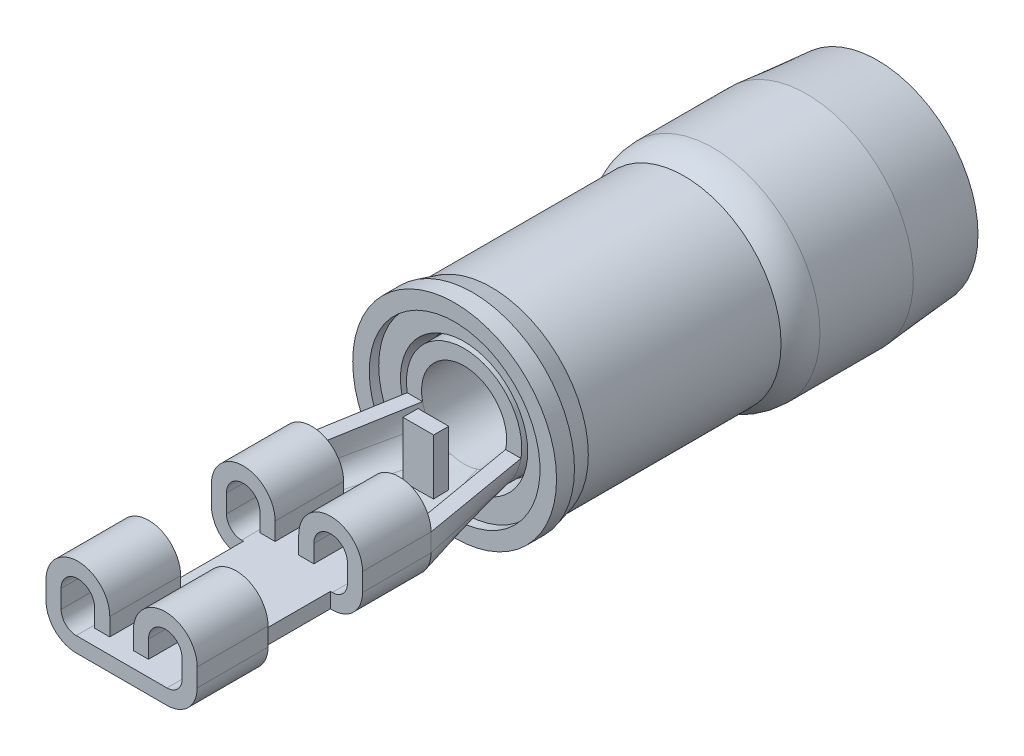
ISO-10303-21;
HEADER;
FILE_DESCRIPTION(('STEP AP214'),'2;1');
FILE_NAME('part.step','',(''),(''),'','','');
FILE_SCHEMA(('AUTOMOTIVE_DESIGN { 1 0 10303 214 1 1 1 1 }'));
ENDSEC;
DATA;
#1=APPLICATION_CONTEXT('core data for automotive mechanical design processes');
#2=APPLICATION_PROTOCOL_DEFINITION('international standard','automotive_design',2000,#1);
#3=PRODUCT_CONTEXT('',#1,'mechanical');
#4=PRODUCT('Part','Part','',(#3));
#5=PRODUCT_RELATED_PRODUCT_CATEGORY('part','',(#4));
#6=PRODUCT_DEFINITION_FORMATION('','',#4);
#7=PRODUCT_DEFINITION_CONTEXT('part definition',#1,'design');
#8=PRODUCT_DEFINITION('design','',#6,#7);
#9=PRODUCT_DEFINITION_SHAPE('','',#8);
#10=(LENGTH_UNIT() NAMED_UNIT(*) SI_UNIT(.MILLI.,.METRE.));
#11=(NAMED_UNIT(*) PLANE_ANGLE_UNIT() SI_UNIT($,.RADIAN.));
#12=(NAMED_UNIT(*) SI_UNIT($,.STERADIAN.) SOLID_ANGLE_UNIT());
#13=UNCERTAINTY_MEASURE_WITH_UNIT(LENGTH_MEASURE(1.E-05),#10,'distance_accuracy_value','');
#14=(GEOMETRIC_REPRESENTATION_CONTEXT(3) GLOBAL_UNCERTAINTY_ASSIGNED_CONTEXT((#13)) GLOBAL_UNIT_ASSIGNED_CONTEXT((#10,
#11,#12)) REPRESENTATION_CONTEXT('',''));
#15=CARTESIAN_POINT('',(0.,0.,0.));
#16=DIRECTION('',(0.,0.,1.));
#17=DIRECTION('',(1.,0.,0.));
#18=AXIS2_PLACEMENT_3D('',#15,#16,#17);
#19=CARTESIAN_POINT('',(0.,1.5494,-16.1263549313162));
#20=DIRECTION('',(0.,0.,-1.));
#21=DIRECTION('',(-1.,0.,0.));
#22=AXIS2_PLACEMENT_3D('',#19,#20,#21);
#23=CONICAL_SURFACE('',#22,1.84149999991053,0.741764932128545);
#24=CARTESIAN_POINT('',(0.,1.5494,-16.12635493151));
#25=DIRECTION('',(0.,0.,-1.));
#26=DIRECTION('',(-1.,0.,0.));
#27=AXIS2_PLACEMENT_3D('',#24,#25,#26);
#28=CIRCLE('',#27,1.8415);
#29=CARTESIAN_POINT('',(-1.8415,1.5494,-16.12635493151));
#30=VERTEX_POINT('',#29);
#31=EDGE_CURVE('P0_E110',#30,#30,#28,.T.);
#32=ORIENTED_EDGE('',*,*,#31,.T.);
#33=EDGE_LOOP('',(#32));
#34=FACE_BOUND('',#33,.T.);
#35=CARTESIAN_POINT('',(0.,1.5494,-15.2734065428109));
#36=DIRECTION('',(0.,0.,-1.));
#37=DIRECTION('',(0.,-1.,0.));
#38=AXIS2_PLACEMENT_3D('',#35,#36,#37);
#39=CIRCLE('',#38,1.05991680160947);
#40=CARTESIAN_POINT('',(0.,0.48948319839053,-15.2734065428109));
#41=VERTEX_POINT('',#40);
#42=EDGE_CURVE('P0_E114',#41,#41,#39,.T.);
#43=ORIENTED_EDGE('',*,*,#42,.F.);
#44=EDGE_LOOP('',(#43));
#45=FACE_BOUND('',#44,.T.);
#46=ADVANCED_FACE('P0_F14',(#34,#45),#23,.F.);
#47=CARTESIAN_POINT('',(0.,1.5494,-14.96452669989));
#48=DIRECTION('',(0.,0.,-1.));
#49=DIRECTION('',(0.,-1.,0.));
#50=AXIS2_PLACEMENT_3D('',#47,#48,#49);
#51=TOROIDAL_SURFACE('',#50,1.397,0.4572);
#52=ORIENTED_EDGE('',*,*,#42,.T.);
#53=EDGE_LOOP('',(#52));
#54=FACE_BOUND('',#53,.T.);
#55=CARTESIAN_POINT('',(0.,1.5494,-14.6556468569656));
#56=DIRECTION('',(0.,0.,1.));
#57=DIRECTION('',(0.,1.,0.));
#58=AXIS2_PLACEMENT_3D('',#55,#56,#57);
#59=CIRCLE('',#58,1.05991680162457);
#60=CARTESIAN_POINT('',(0.,2.60931680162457,-14.6556468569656));
#61=VERTEX_POINT('',#60);
#62=EDGE_CURVE('P0_E108',#61,#61,#59,.T.);
#63=ORIENTED_EDGE('',*,*,#62,.T.);
#64=EDGE_LOOP('',(#63));
#65=FACE_BOUND('',#64,.T.);
#66=ADVANCED_FACE('P0_F100',(#54,#65),#51,.T.);
#67=CARTESIAN_POINT('',(0.,1.5494,-8.759825));
#68=DIRECTION('',(0.,0.,-1.));
#69=DIRECTION('',(-1.,0.,0.));
#70=AXIS2_PLACEMENT_3D('',#67,#68,#69);
#71=CYLINDRICAL_SURFACE('',#70,1.8415);
#72=CARTESIAN_POINT('',(0.,1.5494,-18.161));
#73=DIRECTION('',(0.,0.,-1.));
#74=DIRECTION('',(-1.,0.,0.));
#75=AXIS2_PLACEMENT_3D('',#72,#73,#74);
#76=CIRCLE('',#75,1.8415);
#77=CARTESIAN_POINT('',(-1.8415,1.5494,-18.161));
#78=VERTEX_POINT('',#77);
#79=EDGE_CURVE('P0_E17',#78,#78,#76,.F.);
#80=ORIENTED_EDGE('',*,*,#79,.F.);
#81=EDGE_LOOP('',(#80));
#82=FACE_BOUND('',#81,.T.);
#83=ORIENTED_EDGE('',*,*,#31,.F.);
#84=EDGE_LOOP('',(#83));
#85=FACE_BOUND('',#84,.T.);
#86=ADVANCED_FACE('P0_F97',(#82,#85),#71,.F.);
#87=CARTESIAN_POINT('',(0.,1.5494,-14.5415000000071));
#88=DIRECTION('',(0.,0.,1.));
#89=DIRECTION('',(1.,0.,0.));
#90=AXIS2_PLACEMENT_3D('',#87,#88,#89);
#91=CONICAL_SURFACE('',#90,1.57479999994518,1.35263017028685);
#92=ORIENTED_EDGE('',*,*,#62,.F.);
#93=EDGE_LOOP('',(#92));
#94=FACE_BOUND('',#93,.T.);
#95=CARTESIAN_POINT('',(0.,1.5494,-14.5415));
#96=DIRECTION('',(0.,0.,-1.));
#97=DIRECTION('',(-1.,0.,0.));
#98=AXIS2_PLACEMENT_3D('',#95,#96,#97);
#99=CIRCLE('',#98,1.5748);
#100=CARTESIAN_POINT('',(-1.5748,1.5494,-14.5415));
#101=VERTEX_POINT('',#100);
#102=EDGE_CURVE('P0_E146',#101,#101,#99,.F.);
#103=ORIENTED_EDGE('',*,*,#102,.T.);
#104=EDGE_LOOP('',(#103));
#105=FACE_BOUND('',#104,.T.);
#106=ADVANCED_FACE('P0_F93',(#94,#105),#91,.F.);
#107=CARTESIAN_POINT('',(0.,1.5494,-18.161));
#108=DIRECTION('',(0.,0.,-1.));
#109=DIRECTION('',(-1.,0.,0.));
#110=AXIS2_PLACEMENT_3D('',#107,#108,#109);
#111=PLANE('',#110);
#112=ORIENTED_EDGE('',*,*,#79,.T.);
#113=EDGE_LOOP('',(#112));
#114=FACE_BOUND('',#113,.T.);
#115=CARTESIAN_POINT('',(0.,1.5494,-18.161));
#116=DIRECTION('',(0.,0.,-1.));
#117=DIRECTION('',(-1.,0.,0.));
#118=AXIS2_PLACEMENT_3D('',#115,#116,#117);
#119=CIRCLE('',#118,2.4257);
#120=CARTESIAN_POINT('',(-2.4257,1.5494,-18.161));
#121=VERTEX_POINT('',#120);
#122=EDGE_CURVE('P0_E142',#121,#121,#119,.T.);
#123=ORIENTED_EDGE('',*,*,#122,.T.);
#124=EDGE_LOOP('',(#123));
#125=FACE_BOUND('',#124,.T.);
#126=ADVANCED_FACE('P0_F89',(#114,#125),#111,.T.);
#127=CARTESIAN_POINT('',(0.,1.5494,-8.759825));
#128=DIRECTION('',(0.,0.,-1.));
#129=DIRECTION('',(-1.,0.,0.));
#130=AXIS2_PLACEMENT_3D('',#127,#128,#129);
#131=CYLINDRICAL_SURFACE('',#130,1.5748);
#132=ORIENTED_EDGE('',*,*,#102,.F.);
#133=EDGE_LOOP('',(#132));
#134=FACE_BOUND('',#133,.T.);
#135=CARTESIAN_POINT('',(0.,1.5494,-9.71550000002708));
#136=DIRECTION('',(0.,0.,1.));
#137=DIRECTION('',(0.,1.,0.));
#138=AXIS2_PLACEMENT_3D('',#135,#136,#137);
#139=CIRCLE('',#138,1.57480000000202);
#140=CARTESIAN_POINT('',(0.,3.12420000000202,-9.71550000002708));
#141=VERTEX_POINT('',#140);
#142=EDGE_CURVE('P0_E145',#141,#141,#139,.T.);
#143=ORIENTED_EDGE('',*,*,#142,.T.);
#144=EDGE_LOOP('',(#143));
#145=FACE_BOUND('',#144,.T.);
#146=ADVANCED_FACE('P0_F85',(#134,#145),#131,.F.);
#147=CARTESIAN_POINT('',(0.,1.5494,-8.385175));
#148=DIRECTION('',(0.,0.,-1.));
#149=DIRECTION('',(-1.,0.,0.));
#150=AXIS2_PLACEMENT_3D('',#147,#148,#149);
#151=CYLINDRICAL_SURFACE('',#150,2.4257);
#152=CARTESIAN_POINT('',(0.,1.5494,-18.4150000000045));
#153=DIRECTION('',(0.,0.,1.));
#154=DIRECTION('',(0.,1.,0.));
#155=AXIS2_PLACEMENT_3D('',#152,#153,#154);
#156=CIRCLE('',#155,2.42569999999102);
#157=CARTESIAN_POINT('',(0.,3.97509999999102,-18.4150000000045));
#158=VERTEX_POINT('',#157);
#159=EDGE_CURVE('P0_E141',#158,#158,#156,.F.);
#160=ORIENTED_EDGE('',*,*,#159,.T.);
#161=EDGE_LOOP('',(#160));
#162=FACE_BOUND('',#161,.T.);
#163=ORIENTED_EDGE('',*,*,#122,.F.);
#164=EDGE_LOOP('',(#163));
#165=FACE_BOUND('',#164,.T.);
#166=ADVANCED_FACE('P0_F81',(#162,#165),#151,.F.);
#167=CARTESIAN_POINT('',(0.,1.5494,-9.20750000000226));
#168=DIRECTION('',(0.,0.,1.));
#169=DIRECTION('',(1.,0.,0.));
#170=AXIS2_PLACEMENT_3D('',#167,#168,#169);
#171=CONICAL_SURFACE('',#170,1.7109181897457,0.261799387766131);
#172=ORIENTED_EDGE('',*,*,#142,.F.);
#173=EDGE_LOOP('',(#172));
#174=FACE_BOUND('',#173,.T.);
#175=CARTESIAN_POINT('',(0.,1.5494,-9.20750000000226));
#176=DIRECTION('',(0.,0.,1.));
#177=DIRECTION('',(1.,0.,0.));
#178=AXIS2_PLACEMENT_3D('',#175,#176,#177);
#179=CIRCLE('',#178,1.7109181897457);
#180=CARTESIAN_POINT('',(1.7109181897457,1.5494,-9.20750000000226));
#181=VERTEX_POINT('',#180);
#182=EDGE_CURVE('P0_E138',#181,#181,#179,.T.);
#183=ORIENTED_EDGE('',*,*,#182,.T.);
#184=EDGE_LOOP('',(#183));
#185=FACE_BOUND('',#184,.T.);
#186=ADVANCED_FACE('P0_F77',(#174,#185),#171,.F.);
#187=CARTESIAN_POINT('',(0.,1.5494,-18.4150000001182));
#188=DIRECTION('',(0.,0.,1.));
#189=DIRECTION('',(1.,0.,0.));
#190=AXIS2_PLACEMENT_3D('',#187,#188,#189);
#191=CONICAL_SURFACE('',#190,2.42569999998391,0.0872664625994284);
#192=CARTESIAN_POINT('',(0.,1.5494,-20.3200000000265));
#193=DIRECTION('',(0.,0.,1.));
#194=DIRECTION('',(1.,0.,0.));
#195=AXIS2_PLACEMENT_3D('',#192,#193,#194);
#196=CIRCLE('',#195,2.2590340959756);
#197=CARTESIAN_POINT('',(2.2590340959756,1.5494,-20.3200000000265));
#198=VERTEX_POINT('',#197);
#199=EDGE_CURVE('P0_E134',#198,#198,#196,.T.);
#200=ORIENTED_EDGE('',*,*,#199,.F.);
#201=EDGE_LOOP('',(#200));
#202=FACE_BOUND('',#201,.T.);
#203=ORIENTED_EDGE('',*,*,#159,.F.);
#204=EDGE_LOOP('',(#203));
#205=FACE_BOUND('',#204,.T.);
#206=ADVANCED_FACE('P0_F73',(#202,#205),#191,.F.);
#207=CARTESIAN_POINT('',(0.,1.5494,-9.2075));
#208=DIRECTION('',(0.,0.,-1.));
#209=DIRECTION('',(-1.,0.,0.));
#210=AXIS2_PLACEMENT_3D('',#207,#208,#209);
#211=PLANE('',#210);
#212=ORIENTED_EDGE('',*,*,#182,.F.);
#213=EDGE_LOOP('',(#212));
#214=FACE_BOUND('',#213,.T.);
#215=CARTESIAN_POINT('',(0.,1.5494,-9.2075));
#216=DIRECTION('',(0.,0.,-1.));
#217=DIRECTION('',(-1.,0.,0.));
#218=AXIS2_PLACEMENT_3D('',#215,#216,#217);
#219=CIRCLE('',#218,2.295118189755);
#220=CARTESIAN_POINT('',(-2.295118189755,1.5494,-9.2075));
#221=VERTEX_POINT('',#220);
#222=EDGE_CURVE('P0_E130',#221,#221,#219,.F.);
#223=ORIENTED_EDGE('',*,*,#222,.T.);
#224=EDGE_LOOP('',(#223));
#225=FACE_BOUND('',#224,.T.);
#226=ADVANCED_FACE('P0_F69',(#214,#225),#211,.F.);
#227=CARTESIAN_POINT('',(0.,1.5494,-20.32));
#228=DIRECTION('',(0.,0.,-1.));
#229=DIRECTION('',(-1.,0.,0.));
#230=AXIS2_PLACEMENT_3D('',#227,#228,#229);
#231=PLANE('',#230);
#232=ORIENTED_EDGE('',*,*,#199,.T.);
#233=EDGE_LOOP('',(#232));
#234=FACE_BOUND('',#233,.T.);
#235=CARTESIAN_POINT('',(0.,1.5494,-20.3200000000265));
#236=DIRECTION('',(0.,0.,1.));
#237=DIRECTION('',(1.,0.,0.));
#238=AXIS2_PLACEMENT_3D('',#235,#236,#237);
#239=CIRCLE('',#238,2.70353409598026);
#240=CARTESIAN_POINT('',(2.70353409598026,1.5494,-20.3200000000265));
#241=VERTEX_POINT('',#240);
#242=EDGE_CURVE('P0_E126',#241,#241,#239,.T.);
#243=ORIENTED_EDGE('',*,*,#242,.F.);
#244=EDGE_LOOP('',(#243));
#245=FACE_BOUND('',#244,.T.);
#246=ADVANCED_FACE('P0_F65',(#234,#245),#231,.T.);
#247=CARTESIAN_POINT('',(0.,1.5494,-8.385175));
#248=DIRECTION('',(0.,0.,-1.));
#249=DIRECTION('',(-1.,0.,0.));
#250=AXIS2_PLACEMENT_3D('',#247,#248,#249);
#251=CYLINDRICAL_SURFACE('',#250,2.295118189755);
#252=CARTESIAN_POINT('',(0.,1.5494,-8.9535));
#253=DIRECTION('',(0.,0.,-1.));
#254=DIRECTION('',(-1.,0.,0.));
#255=AXIS2_PLACEMENT_3D('',#252,#253,#254);
#256=CIRCLE('',#255,2.295118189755);
#257=CARTESIAN_POINT('',(-2.295118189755,1.5494,-8.9535));
#258=VERTEX_POINT('',#257);
#259=EDGE_CURVE('P0_E122',#258,#258,#256,.F.);
#260=ORIENTED_EDGE('',*,*,#259,.T.);
#261=EDGE_LOOP('',(#260));
#262=FACE_BOUND('',#261,.T.);
#263=ORIENTED_EDGE('',*,*,#222,.F.);
#264=EDGE_LOOP('',(#263));
#265=FACE_BOUND('',#264,.T.);
#266=ADVANCED_FACE('P0_F61',(#262,#265),#251,.F.);
#267=CARTESIAN_POINT('',(0.,1.5494,-18.4150000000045));
#268=DIRECTION('',(0.,0.,1.));
#269=DIRECTION('',(1.,0.,0.));
#270=AXIS2_PLACEMENT_3D('',#267,#268,#269);
#271=CONICAL_SURFACE('',#270,2.87019999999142,0.0872664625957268);
#272=CARTESIAN_POINT('',(0.,1.5494,-18.415));
#273=DIRECTION('',(0.,0.,-1.));
#274=DIRECTION('',(-1.,0.,0.));
#275=AXIS2_PLACEMENT_3D('',#272,#273,#274);
#276=CIRCLE('',#275,2.8702);
#277=CARTESIAN_POINT('',(-2.8702,1.5494,-18.415));
#278=VERTEX_POINT('',#277);
#279=EDGE_CURVE('P0_E121',#278,#278,#276,.F.);
#280=ORIENTED_EDGE('',*,*,#279,.F.);
#281=EDGE_LOOP('',(#280));
#282=FACE_BOUND('',#281,.T.);
#283=ORIENTED_EDGE('',*,*,#242,.T.);
#284=EDGE_LOOP('',(#283));
#285=FACE_BOUND('',#284,.T.);
#286=ADVANCED_FACE('P0_F57',(#282,#285),#271,.T.);
#287=CARTESIAN_POINT('',(0.,1.5494,-8.9535));
#288=DIRECTION('',(0.,0.,-1.));
#289=DIRECTION('',(-1.,0.,0.));
#290=AXIS2_PLACEMENT_3D('',#287,#288,#289);
#291=PLANE('',#290);
#292=ORIENTED_EDGE('',*,*,#259,.F.);
#293=EDGE_LOOP('',(#292));
#294=FACE_BOUND('',#293,.T.);
#295=CARTESIAN_POINT('',(0.,1.5494,-8.9535));
#296=DIRECTION('',(0.,0.,-1.));
#297=DIRECTION('',(-1.,0.,0.));
#298=AXIS2_PLACEMENT_3D('',#295,#296,#297);
#299=CIRCLE('',#298,2.739618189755);
#300=CARTESIAN_POINT('',(-2.739618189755,1.5494,-8.9535));
#301=VERTEX_POINT('',#300);
#302=EDGE_CURVE('P0_E118',#301,#301,#299,.T.);
#303=ORIENTED_EDGE('',*,*,#302,.F.);
#304=EDGE_LOOP('',(#303));
#305=FACE_BOUND('',#304,.T.);
#306=ADVANCED_FACE('P0_F53',(#294,#305),#291,.F.);
#307=CARTESIAN_POINT('',(0.,1.5494,-8.385175));
#308=DIRECTION('',(0.,0.,-1.));
#309=DIRECTION('',(-1.,0.,0.));
#310=AXIS2_PLACEMENT_3D('',#307,#308,#309);
#311=CYLINDRICAL_SURFACE('',#310,2.8702);
#312=CARTESIAN_POINT('',(0.,1.5494,-15.90434568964));
#313=DIRECTION('',(0.,0.,-1.));
#314=DIRECTION('',(0.,-1.,0.));
#315=AXIS2_PLACEMENT_3D('',#312,#313,#314);
#316=CIRCLE('',#315,2.8702);
#317=CARTESIAN_POINT('',(0.,-1.3208,-15.90434568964));
#318=VERTEX_POINT('',#317);
#319=EDGE_CURVE('P0_E36',#318,#318,#316,.F.);
#320=ORIENTED_EDGE('',*,*,#319,.F.);
#321=EDGE_LOOP('',(#320));
#322=FACE_BOUND('',#321,.T.);
#323=ORIENTED_EDGE('',*,*,#279,.T.);
#324=EDGE_LOOP('',(#323));
#325=FACE_BOUND('',#324,.T.);
#326=ADVANCED_FACE('P0_F49',(#322,#325),#311,.T.);
#327=CARTESIAN_POINT('',(0.,1.5494,-8.385175));
#328=DIRECTION('',(0.,0.,-1.));
#329=DIRECTION('',(-1.,0.,0.));
#330=AXIS2_PLACEMENT_3D('',#327,#328,#329);
#331=CYLINDRICAL_SURFACE('',#330,2.739618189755);
#332=ORIENTED_EDGE('',*,*,#302,.T.);
#333=EDGE_LOOP('',(#332));
#334=FACE_BOUND('',#333,.T.);
#335=CARTESIAN_POINT('',(0.,1.5494,-9.43610000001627));
#336=DIRECTION('',(0.,0.,1.));
#337=DIRECTION('',(0.,1.,0.));
#338=AXIS2_PLACEMENT_3D('',#335,#336,#337);
#339=CIRCLE('',#338,2.73961818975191);
#340=CARTESIAN_POINT('',(0.,4.28901818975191,-9.43610000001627));
#341=VERTEX_POINT('',#340);
#342=EDGE_CURVE('P0_E31',#341,#341,#339,.F.);
#343=ORIENTED_EDGE('',*,*,#342,.F.);
#344=EDGE_LOOP('',(#343));
#345=FACE_BOUND('',#344,.T.);
#346=ADVANCED_FACE('P0_F44',(#334,#345),#331,.T.);
#347=CARTESIAN_POINT('',(0.,1.5494,-15.90434568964));
#348=DIRECTION('',(0.,0.,-1.));
#349=DIRECTION('',(0.,-1.,0.));
#350=AXIS2_PLACEMENT_3D('',#347,#348,#349);
#351=TOROIDAL_SURFACE('',#350,1.6002,1.27);
#352=CARTESIAN_POINT('',(0.,1.5494,-15.1257));
#353=DIRECTION('',(0.,0.,-1.));
#354=DIRECTION('',(-1.,0.,0.));
#355=AXIS2_PLACEMENT_3D('',#352,#353,#354);
#356=CIRCLE('',#355,2.6035);
#357=CARTESIAN_POINT('',(-2.6035,1.5494,-15.1257));
#358=VERTEX_POINT('',#357);
#359=EDGE_CURVE('P0_E22',#358,#358,#356,.F.);
#360=ORIENTED_EDGE('',*,*,#359,.F.);
#361=EDGE_LOOP('',(#360));
#362=FACE_BOUND('',#361,.T.);
#363=ORIENTED_EDGE('',*,*,#319,.T.);
#364=EDGE_LOOP('',(#363));
#365=FACE_BOUND('',#364,.T.);
#366=ADVANCED_FACE('P0_F39',(#362,#365),#351,.T.);
#367=CARTESIAN_POINT('',(0.,1.5494,-9.43610000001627));
#368=DIRECTION('',(0.,0.,1.));
#369=DIRECTION('',(1.,0.,0.));
#370=AXIS2_PLACEMENT_3D('',#367,#368,#369);
#371=CONICAL_SURFACE('',#370,2.73961818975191,0.261799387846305);
#372=ORIENTED_EDGE('',*,*,#342,.T.);
#373=EDGE_LOOP('',(#372));
#374=FACE_BOUND('',#373,.T.);
#375=CARTESIAN_POINT('',(0.,1.5494,-9.9441));
#376=DIRECTION('',(0.,0.,-1.));
#377=DIRECTION('',(-1.,0.,0.));
#378=AXIS2_PLACEMENT_3D('',#375,#376,#377);
#379=CIRCLE('',#378,2.6035);
#380=CARTESIAN_POINT('',(-2.6035,1.5494,-9.9441));
#381=VERTEX_POINT('',#380);
#382=EDGE_CURVE('P0_E10',#381,#381,#379,.T.);
#383=ORIENTED_EDGE('',*,*,#382,.F.);
#384=EDGE_LOOP('',(#383));
#385=FACE_BOUND('',#384,.T.);
#386=ADVANCED_FACE('P0_F43',(#374,#385),#371,.T.);
#387=CARTESIAN_POINT('',(0.,1.5494,-8.385175));
#388=DIRECTION('',(0.,0.,-1.));
#389=DIRECTION('',(-1.,0.,0.));
#390=AXIS2_PLACEMENT_3D('',#387,#388,#389);
#391=CYLINDRICAL_SURFACE('',#390,2.6035);
#392=ORIENTED_EDGE('',*,*,#382,.T.);
#393=EDGE_LOOP('',(#392));
#394=FACE_BOUND('',#393,.T.);
#395=ORIENTED_EDGE('',*,*,#359,.T.);
#396=EDGE_LOOP('',(#395));
#397=FACE_BOUND('',#396,.T.);
#398=ADVANCED_FACE('P0_F185',(#394,#397),#391,.T.);
#399=CLOSED_SHELL('',(#46,#66,#86,#106,#126,#146,#166,#186,#206,#226,#246,#266,#286,#306,#326,
#346,#366,#386,#398));
#400=MANIFOLD_SOLID_BREP('P0_B1',#399);
#401=CARTESIAN_POINT('',(2.032,0.4064,-4.445));
#402=DIRECTION('',(0.,0.,-1.));
#403=DIRECTION('',(-1.,0.,0.));
#404=AXIS2_PLACEMENT_3D('',#401,#402,#403);
#405=PLANE('',#404);
#406=CARTESIAN_POINT('',(1.17475,1.30175,-4.445));
#407=DIRECTION('',(0.,0.,-1.));
#408=DIRECTION('',(-1.,0.,0.));
#409=AXIS2_PLACEMENT_3D('',#406,#407,#408);
#410=CIRCLE('',#409,0.85725);
#411=CARTESIAN_POINT('',(0.3175,1.30175,-4.445));
#412=VERTEX_POINT('',#411);
#413=CARTESIAN_POINT('',(2.032,1.30175,-4.445));
#414=VERTEX_POINT('',#413);
#415=EDGE_CURVE('P1_E1196',#412,#414,#410,.T.);
#416=ORIENTED_EDGE('',*,*,#415,.F.);
#417=DIRECTION('',(0.,1.,0.));
#418=VECTOR('',#417,1.);
#419=CARTESIAN_POINT('',(0.3175,1.30175,-4.445));
#420=LINE('',#419,#418);
#421=CARTESIAN_POINT('',(0.3175,0.8255,-4.445));
#422=VERTEX_POINT('',#421);
#423=EDGE_CURVE('P1_E1205',#422,#412,#420,.T.);
#424=ORIENTED_EDGE('',*,*,#423,.F.);
#425=DIRECTION('',(-1.,0.,0.));
#426=VECTOR('',#425,1.);
#427=CARTESIAN_POINT('',(2.032,0.8255,-4.445));
#428=LINE('',#427,#426);
#429=CARTESIAN_POINT('',(0.7239,0.8255,-4.445));
#430=VERTEX_POINT('',#429);
#431=EDGE_CURVE('P1_E1401',#430,#422,#428,.T.);
#432=ORIENTED_EDGE('',*,*,#431,.F.);
#433=DIRECTION('',(0.,1.,0.));
#434=VECTOR('',#433,1.);
#435=CARTESIAN_POINT('',(0.7239,0.4064,-4.445));
#436=LINE('',#435,#434);
#437=CARTESIAN_POINT('',(0.7239,1.30175,-4.445));
#438=VERTEX_POINT('',#437);
#439=EDGE_CURVE('P1_E1404',#438,#430,#436,.F.);
#440=ORIENTED_EDGE('',*,*,#439,.F.);
#441=CARTESIAN_POINT('',(1.17475,1.30175,-4.445));
#442=DIRECTION('',(0.,0.,1.));
#443=DIRECTION('',(1.,0.,0.));
#444=AXIS2_PLACEMENT_3D('',#441,#442,#443);
#445=CIRCLE('',#444,0.45085);
#446=CARTESIAN_POINT('',(1.6256,1.30175,-4.445));
#447=VERTEX_POINT('',#446);
#448=EDGE_CURVE('P1_E1378',#447,#438,#445,.T.);
#449=ORIENTED_EDGE('',*,*,#448,.F.);
#450=DIRECTION('',(0.,1.,0.));
#451=VECTOR('',#450,1.);
#452=CARTESIAN_POINT('',(1.6256,0.4064,-4.445));
#453=LINE('',#452,#451);
#454=CARTESIAN_POINT('',(1.6256,0.8128,-4.445));
#455=VERTEX_POINT('',#454);
#456=EDGE_CURVE('P1_E1409',#455,#447,#453,.T.);
#457=ORIENTED_EDGE('',*,*,#456,.F.);
#458=CARTESIAN_POINT('',(1.2192,0.8128,-4.445));
#459=DIRECTION('',(0.,0.,1.));
#460=DIRECTION('',(0.,-1.,0.));
#461=AXIS2_PLACEMENT_3D('',#458,#459,#460);
#462=CIRCLE('',#461,0.4064);
#463=CARTESIAN_POINT('',(1.2192,0.4064,-4.445));
#464=VERTEX_POINT('',#463);
#465=EDGE_CURVE('P1_E1366',#464,#455,#462,.T.);
#466=ORIENTED_EDGE('',*,*,#465,.F.);
#467=DIRECTION('',(-1.,0.,0.));
#468=VECTOR('',#467,1.);
#469=CARTESIAN_POINT('',(2.032,0.4064,-4.445));
#470=LINE('',#469,#468);
#471=CARTESIAN_POINT('',(1.1684,0.4064,-4.445));
#472=VERTEX_POINT('',#471);
#473=EDGE_CURVE('P1_E1102',#472,#464,#470,.F.);
#474=ORIENTED_EDGE('',*,*,#473,.F.);
#475=DIRECTION('',(0.,1.,0.));
#476=VECTOR('',#475,1.);
#477=CARTESIAN_POINT('',(1.1684,0.4064,-4.445));
#478=LINE('',#477,#476);
#479=CARTESIAN_POINT('',(1.1684,0.,-4.445));
#480=VERTEX_POINT('',#479);
#481=EDGE_CURVE('P1_E1094',#480,#472,#478,.T.);
#482=ORIENTED_EDGE('',*,*,#481,.F.);
#483=DIRECTION('',(-1.,0.,0.));
#484=VECTOR('',#483,1.);
#485=CARTESIAN_POINT('',(2.032,0.,-4.445));
#486=LINE('',#485,#484);
#487=CARTESIAN_POINT('',(1.21920000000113,0.,-4.445));
#488=VERTEX_POINT('',#487);
#489=EDGE_CURVE('P1_E1103',#488,#480,#486,.T.);
#490=ORIENTED_EDGE('',*,*,#489,.F.);
#491=CARTESIAN_POINT('',(1.2192,0.8128,-4.445));
#492=DIRECTION('',(0.,0.,-1.));
#493=DIRECTION('',(1.,0.,0.));
#494=AXIS2_PLACEMENT_3D('',#491,#492,#493);
#495=CIRCLE('',#494,0.8128);
#496=CARTESIAN_POINT('',(2.032,0.8128,-4.445));
#497=VERTEX_POINT('',#496);
#498=EDGE_CURVE('P1_E1111',#497,#488,#495,.T.);
#499=ORIENTED_EDGE('',*,*,#498,.F.);
#500=DIRECTION('',(0.,1.,0.));
#501=VECTOR('',#500,1.);
#502=CARTESIAN_POINT('',(2.032,0.4064,-4.445));
#503=LINE('',#502,#501);
#504=EDGE_CURVE('P1_E1335',#414,#497,#503,.F.);
#505=ORIENTED_EDGE('',*,*,#504,.F.);
#506=EDGE_LOOP('',(#416,#424,#432,#440,#449,#457,#466,#474,#482,#490,#499,#505));
#507=FACE_BOUND('',#506,.T.);
#508=ADVANCED_FACE('P1_F15',(#507),#405,.F.);
#509=CARTESIAN_POINT('',(0.,0.,-6.2865));
#510=DIRECTION('',(0.,0.,1.));
#511=DIRECTION('',(1.,0.,0.));
#512=AXIS2_PLACEMENT_3D('',#509,#510,#511);
#513=PLANE('',#512);
#514=DIRECTION('',(0.,1.,0.));
#515=VECTOR('',#514,1.);
#516=CARTESIAN_POINT('',(0.7239,0.,-6.2865));
#517=LINE('',#516,#515);
#518=CARTESIAN_POINT('',(0.7239,0.8255,-6.2865));
#519=VERTEX_POINT('',#518);
#520=CARTESIAN_POINT('',(0.7239,1.30175,-6.2865));
#521=VERTEX_POINT('',#520);
#522=EDGE_CURVE('P1_E1321',#519,#521,#517,.T.);
#523=ORIENTED_EDGE('',*,*,#522,.F.);
#524=DIRECTION('',(1.,0.,0.));
#525=VECTOR('',#524,1.);
#526=CARTESIAN_POINT('',(0.,0.8255,-6.2865));
#527=LINE('',#526,#525);
#528=CARTESIAN_POINT('',(0.3175,0.8255,-6.2865));
#529=VERTEX_POINT('',#528);
#530=EDGE_CURVE('P1_E1330',#529,#519,#527,.T.);
#531=ORIENTED_EDGE('',*,*,#530,.F.);
#532=DIRECTION('',(0.,1.,0.));
#533=VECTOR('',#532,1.);
#534=CARTESIAN_POINT('',(0.3175,1.30175,-6.2865));
#535=LINE('',#534,#533);
#536=CARTESIAN_POINT('',(0.3175,1.30175,-6.2865));
#537=VERTEX_POINT('',#536);
#538=EDGE_CURVE('P1_E1239',#537,#529,#535,.F.);
#539=ORIENTED_EDGE('',*,*,#538,.F.);
#540=CARTESIAN_POINT('',(1.17475,1.30175,-6.2865));
#541=DIRECTION('',(0.,0.,1.));
#542=DIRECTION('',(1.,0.,0.));
#543=AXIS2_PLACEMENT_3D('',#540,#541,#542);
#544=CIRCLE('',#543,0.85725);
#545=CARTESIAN_POINT('',(2.032,1.30175,-6.2865));
#546=VERTEX_POINT('',#545);
#547=EDGE_CURVE('P1_E1298',#546,#537,#544,.T.);
#548=ORIENTED_EDGE('',*,*,#547,.F.);
#549=DIRECTION('',(1.,0.,0.));
#550=VECTOR('',#549,1.);
#551=CARTESIAN_POINT('',(0.,1.30175,-6.2865));
#552=LINE('',#551,#550);
#553=CARTESIAN_POINT('',(1.62559999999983,1.30175000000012,-6.28650000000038));
#554=VERTEX_POINT('',#553);
#555=EDGE_CURVE('P1_E1333',#554,#546,#552,.T.);
#556=ORIENTED_EDGE('',*,*,#555,.F.);
#557=CARTESIAN_POINT('',(1.17475,1.30175,-6.2865));
#558=DIRECTION('',(0.,0.,-1.));
#559=DIRECTION('',(-1.,0.,0.));
#560=AXIS2_PLACEMENT_3D('',#557,#558,#559);
#561=CIRCLE('',#560,0.45085);
#562=EDGE_CURVE('P1_E1329',#521,#554,#561,.T.);
#563=ORIENTED_EDGE('',*,*,#562,.F.);
#564=EDGE_LOOP('',(#523,#531,#539,#548,#556,#563));
#565=FACE_BOUND('',#564,.T.);
#566=ADVANCED_FACE('P1_F1305',(#565),#513,.F.);
#567=CARTESIAN_POINT('',(2.032,0.4064,-4.445));
#568=DIRECTION('',(0.,0.,-1.));
#569=DIRECTION('',(-1.,0.,0.));
#570=AXIS2_PLACEMENT_3D('',#567,#568,#569);
#571=PLANE('',#570);
#572=CARTESIAN_POINT('',(-1.17475,1.30175,-4.445));
#573=DIRECTION('',(0.,0.,1.));
#574=DIRECTION('',(1.,0.,0.));
#575=AXIS2_PLACEMENT_3D('',#572,#573,#574);
#576=CIRCLE('',#575,0.45085);
#577=CARTESIAN_POINT('',(-0.7239,1.30175,-4.445));
#578=VERTEX_POINT('',#577);
#579=CARTESIAN_POINT('',(-1.6256,1.30175,-4.445));
#580=VERTEX_POINT('',#579);
#581=EDGE_CURVE('P1_E1180',#578,#580,#576,.T.);
#582=ORIENTED_EDGE('',*,*,#581,.F.);
#583=DIRECTION('',(0.,1.,0.));
#584=VECTOR('',#583,1.);
#585=CARTESIAN_POINT('',(-0.7239,0.4064,-4.445));
#586=LINE('',#585,#584);
#587=CARTESIAN_POINT('',(-0.7239,0.8255,-4.445));
#588=VERTEX_POINT('',#587);
#589=EDGE_CURVE('P1_E1234',#588,#578,#586,.T.);
#590=ORIENTED_EDGE('',*,*,#589,.F.);
#591=DIRECTION('',(1.,0.,0.));
#592=VECTOR('',#591,1.);
#593=CARTESIAN_POINT('',(-0.7239,0.8255,-4.445));
#594=LINE('',#593,#592);
#595=CARTESIAN_POINT('',(-0.3175,0.8255,-4.445));
#596=VERTEX_POINT('',#595);
#597=EDGE_CURVE('P1_E1182',#596,#588,#594,.F.);
#598=ORIENTED_EDGE('',*,*,#597,.F.);
#599=DIRECTION('',(0.,1.,0.));
#600=VECTOR('',#599,1.);
#601=CARTESIAN_POINT('',(-0.3175,0.8255,-4.445));
#602=LINE('',#601,#600);
#603=CARTESIAN_POINT('',(-0.3175,1.30175,-4.445));
#604=VERTEX_POINT('',#603);
#605=EDGE_CURVE('P1_E1248',#604,#596,#602,.F.);
#606=ORIENTED_EDGE('',*,*,#605,.F.);
#607=CARTESIAN_POINT('',(-1.17475,1.30175,-4.445));
#608=DIRECTION('',(0.,0.,-1.));
#609=DIRECTION('',(-1.,0.,0.));
#610=AXIS2_PLACEMENT_3D('',#607,#608,#609);
#611=CIRCLE('',#610,0.85725);
#612=CARTESIAN_POINT('',(-2.032,1.30175,-4.445));
#613=VERTEX_POINT('',#612);
#614=EDGE_CURVE('P1_E1513',#613,#604,#611,.T.);
#615=ORIENTED_EDGE('',*,*,#614,.F.);
#616=DIRECTION('',(0.,1.,0.));
#617=VECTOR('',#616,1.);
#618=CARTESIAN_POINT('',(-2.032,0.4064,-4.445));
#619=LINE('',#618,#617);
#620=CARTESIAN_POINT('',(-2.032,0.8128,-4.445));
#621=VERTEX_POINT('',#620);
#622=EDGE_CURVE('P1_E1479',#621,#613,#619,.T.);
#623=ORIENTED_EDGE('',*,*,#622,.F.);
#624=CARTESIAN_POINT('',(-1.2192,0.8128,-4.445));
#625=DIRECTION('',(0.,0.,-1.));
#626=DIRECTION('',(-2.46133101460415E-12,-1.,0.));
#627=AXIS2_PLACEMENT_3D('',#624,#625,#626);
#628=CIRCLE('',#627,0.8128);
#629=CARTESIAN_POINT('',(-1.2192000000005,0.,-4.445));
#630=VERTEX_POINT('',#629);
#631=EDGE_CURVE('P1_E1476',#630,#621,#628,.T.);
#632=ORIENTED_EDGE('',*,*,#631,.F.);
#633=DIRECTION('',(-1.,0.,0.));
#634=VECTOR('',#633,1.);
#635=CARTESIAN_POINT('',(2.032,0.,-4.445));
#636=LINE('',#635,#634);
#637=CARTESIAN_POINT('',(-1.1684,0.,-4.445));
#638=VERTEX_POINT('',#637);
#639=EDGE_CURVE('P1_E1000',#638,#630,#636,.T.);
#640=ORIENTED_EDGE('',*,*,#639,.F.);
#641=DIRECTION('',(0.,1.,0.));
#642=VECTOR('',#641,1.);
#643=CARTESIAN_POINT('',(-1.1684,0.4064,-4.445));
#644=LINE('',#643,#642);
#645=CARTESIAN_POINT('',(-1.1684,0.4064,-4.445));
#646=VERTEX_POINT('',#645);
#647=EDGE_CURVE('P1_E992',#646,#638,#644,.F.);
#648=ORIENTED_EDGE('',*,*,#647,.F.);
#649=DIRECTION('',(-1.,0.,0.));
#650=VECTOR('',#649,1.);
#651=CARTESIAN_POINT('',(2.032,0.4064,-4.445));
#652=LINE('',#651,#650);
#653=CARTESIAN_POINT('',(-1.2191999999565,0.4064,-4.445));
#654=VERTEX_POINT('',#653);
#655=EDGE_CURVE('P1_E1001',#654,#646,#652,.F.);
#656=ORIENTED_EDGE('',*,*,#655,.F.);
#657=CARTESIAN_POINT('',(-1.2192,0.8128,-4.445));
#658=DIRECTION('',(0.,0.,1.));
#659=DIRECTION('',(-1.,0.,0.));
#660=AXIS2_PLACEMENT_3D('',#657,#658,#659);
#661=CIRCLE('',#660,0.4064);
#662=CARTESIAN_POINT('',(-1.6256,0.8128,-4.445));
#663=VERTEX_POINT('',#662);
#664=EDGE_CURVE('P1_E1008',#663,#654,#661,.T.);
#665=ORIENTED_EDGE('',*,*,#664,.F.);
#666=DIRECTION('',(0.,1.,0.));
#667=VECTOR('',#666,1.);
#668=CARTESIAN_POINT('',(-1.6256,0.4064,-4.445));
#669=LINE('',#668,#667);
#670=EDGE_CURVE('P1_E1488',#580,#663,#669,.F.);
#671=ORIENTED_EDGE('',*,*,#670,.F.);
#672=EDGE_LOOP('',(#582,#590,#598,#606,#615,#623,#632,#640,#648,#656,#665,#671));
#673=FACE_BOUND('',#672,.T.);
#674=ADVANCED_FACE('P1_F1314',(#673),#571,.F.);
#675=CARTESIAN_POINT('',(-0.3175,0.8255,0.));
#676=DIRECTION('',(1.,0.,0.));
#677=DIRECTION('',(0.,0.,-1.));
#678=AXIS2_PLACEMENT_3D('',#675,#676,#677);
#679=PLANE('',#678);
#680=DIRECTION('',(0.,0.,1.));
#681=VECTOR('',#680,1.);
#682=CARTESIAN_POINT('',(-0.3175,1.30175,0.));
#683=LINE('',#682,#681);
#684=CARTESIAN_POINT('',(-0.3175,1.30175,-6.2865));
#685=VERTEX_POINT('',#684);
#686=EDGE_CURVE('P1_E1263',#604,#685,#683,.F.);
#687=ORIENTED_EDGE('',*,*,#686,.F.);
#688=ORIENTED_EDGE('',*,*,#605,.T.);
#689=DIRECTION('',(0.,0.,-1.));
#690=VECTOR('',#689,1.);
#691=CARTESIAN_POINT('',(-0.3175,0.8255,0.));
#692=LINE('',#691,#690);
#693=CARTESIAN_POINT('',(-0.3175,0.8255,-6.2865));
#694=VERTEX_POINT('',#693);
#695=EDGE_CURVE('P1_E1186',#694,#596,#692,.F.);
#696=ORIENTED_EDGE('',*,*,#695,.F.);
#697=DIRECTION('',(0.,1.,0.));
#698=VECTOR('',#697,1.);
#699=CARTESIAN_POINT('',(-0.3175,0.,-6.2865));
#700=LINE('',#699,#698);
#701=EDGE_CURVE('P1_E1236',#694,#685,#700,.T.);
#702=ORIENTED_EDGE('',*,*,#701,.T.);
#703=EDGE_LOOP('',(#687,#688,#696,#702));
#704=FACE_BOUND('',#703,.T.);
#705=ADVANCED_FACE('P1_F1539',(#704),#679,.T.);
#706=CARTESIAN_POINT('',(0.,0.,-6.2865));
#707=DIRECTION('',(0.,0.,1.));
#708=DIRECTION('',(1.,0.,0.));
#709=AXIS2_PLACEMENT_3D('',#706,#707,#708);
#710=PLANE('',#709);
#711=ORIENTED_EDGE('',*,*,#701,.F.);
#712=DIRECTION('',(1.,0.,0.));
#713=VECTOR('',#712,1.);
#714=CARTESIAN_POINT('',(-0.7239,0.8255,-6.2865));
#715=LINE('',#714,#713);
#716=CARTESIAN_POINT('',(-0.7239,0.8255,-6.2865));
#717=VERTEX_POINT('',#716);
#718=EDGE_CURVE('P1_E1199',#717,#694,#715,.T.);
#719=ORIENTED_EDGE('',*,*,#718,.F.);
#720=DIRECTION('',(0.,1.,0.));
#721=VECTOR('',#720,1.);
#722=CARTESIAN_POINT('',(-0.7239,0.,-6.2865));
#723=LINE('',#722,#721);
#724=CARTESIAN_POINT('',(-0.7239,1.30175,-6.2865));
#725=VERTEX_POINT('',#724);
#726=EDGE_CURVE('P1_E1229',#725,#717,#723,.F.);
#727=ORIENTED_EDGE('',*,*,#726,.F.);
#728=CARTESIAN_POINT('',(-1.17475,1.30175,-6.2865));
#729=DIRECTION('',(0.,0.,-1.));
#730=DIRECTION('',(-1.,0.,0.));
#731=AXIS2_PLACEMENT_3D('',#728,#729,#730);
#732=CIRCLE('',#731,0.45085);
#733=CARTESIAN_POINT('',(-1.62559999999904,1.30174999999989,-6.28650000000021));
#734=VERTEX_POINT('',#733);
#735=EDGE_CURVE('P1_E1224',#734,#725,#732,.T.);
#736=ORIENTED_EDGE('',*,*,#735,.F.);
#737=DIRECTION('',(1.,0.,0.));
#738=VECTOR('',#737,1.);
#739=CARTESIAN_POINT('',(0.,1.30175,-6.2865));
#740=LINE('',#739,#738);
#741=CARTESIAN_POINT('',(-2.03199999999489,1.30175,-6.28649999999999));
#742=VERTEX_POINT('',#741);
#743=EDGE_CURVE('P1_E1230',#742,#734,#740,.T.);
#744=ORIENTED_EDGE('',*,*,#743,.F.);
#745=CARTESIAN_POINT('',(-1.17475,1.30175,-6.2865));
#746=DIRECTION('',(0.,0.,1.));
#747=DIRECTION('',(1.,0.,0.));
#748=AXIS2_PLACEMENT_3D('',#745,#746,#747);
#749=CIRCLE('',#748,0.85725);
#750=EDGE_CURVE('P1_E1257',#685,#742,#749,.T.);
#751=ORIENTED_EDGE('',*,*,#750,.F.);
#752=EDGE_LOOP('',(#711,#719,#727,#736,#744,#751));
#753=FACE_BOUND('',#752,.T.);
#754=ADVANCED_FACE('P1_F1235',(#753),#710,.F.);
#755=CARTESIAN_POINT('',(0.3175,1.30175,0.));
#756=DIRECTION('',(-1.,0.,0.));
#757=DIRECTION('',(0.,0.,1.));
#758=AXIS2_PLACEMENT_3D('',#755,#756,#757);
#759=PLANE('',#758);
#760=DIRECTION('',(0.,0.,-1.));
#761=VECTOR('',#760,1.);
#762=CARTESIAN_POINT('',(0.3175,0.8255,0.));
#763=LINE('',#762,#761);
#764=EDGE_CURVE('P1_E1221',#422,#529,#763,.T.);
#765=ORIENTED_EDGE('',*,*,#764,.F.);
#766=ORIENTED_EDGE('',*,*,#423,.T.);
#767=DIRECTION('',(0.,0.,1.));
#768=VECTOR('',#767,1.);
#769=CARTESIAN_POINT('',(0.3175,1.30175,0.));
#770=LINE('',#769,#768);
#771=EDGE_CURVE('P1_E1185',#537,#412,#770,.T.);
#772=ORIENTED_EDGE('',*,*,#771,.F.);
#773=ORIENTED_EDGE('',*,*,#538,.T.);
#774=EDGE_LOOP('',(#765,#766,#772,#773));
#775=FACE_BOUND('',#774,.T.);
#776=ADVANCED_FACE('P1_F1546',(#775),#759,.T.);
#777=CARTESIAN_POINT('',(-0.7239,0.8255,0.));
#778=DIRECTION('',(0.,-1.,0.));
#779=DIRECTION('',(0.,0.,-1.));
#780=AXIS2_PLACEMENT_3D('',#777,#778,#779);
#781=PLANE('',#780);
#782=ORIENTED_EDGE('',*,*,#695,.T.);
#783=ORIENTED_EDGE('',*,*,#597,.T.);
#784=DIRECTION('',(0.,0.,1.));
#785=VECTOR('',#784,1.);
#786=CARTESIAN_POINT('',(-0.7239,0.8255,0.));
#787=LINE('',#786,#785);
#788=EDGE_CURVE('P1_E397',#717,#588,#787,.T.);
#789=ORIENTED_EDGE('',*,*,#788,.F.);
#790=ORIENTED_EDGE('',*,*,#718,.T.);
#791=EDGE_LOOP('',(#782,#783,#789,#790));
#792=FACE_BOUND('',#791,.T.);
#793=ADVANCED_FACE('P1_F2022',(#792),#781,.T.);
#794=CARTESIAN_POINT('',(1.17475,1.30175,0.));
#795=DIRECTION('',(0.,0.,1.));
#796=DIRECTION('',(1.,0.,0.));
#797=AXIS2_PLACEMENT_3D('',#794,#795,#796);
#798=CYLINDRICAL_SURFACE('',#797,0.85725);
#799=DIRECTION('',(0.,0.,-1.));
#800=VECTOR('',#799,1.);
#801=CARTESIAN_POINT('',(2.032,1.30175,0.));
#802=LINE('',#801,#800);
#803=EDGE_CURVE('P1_E916',#546,#414,#802,.F.);
#804=ORIENTED_EDGE('',*,*,#803,.F.);
#805=ORIENTED_EDGE('',*,*,#547,.T.);
#806=ORIENTED_EDGE('',*,*,#771,.T.);
#807=ORIENTED_EDGE('',*,*,#415,.T.);
#808=EDGE_LOOP('',(#804,#805,#806,#807));
#809=FACE_BOUND('',#808,.T.);
#810=ADVANCED_FACE('P1_F1276',(#809),#798,.T.);
#811=CARTESIAN_POINT('',(-1.17475,1.30175,0.));
#812=DIRECTION('',(0.,0.,1.));
#813=DIRECTION('',(1.,0.,0.));
#814=AXIS2_PLACEMENT_3D('',#811,#812,#813);
#815=CYLINDRICAL_SURFACE('',#814,0.85725);
#816=ORIENTED_EDGE('',*,*,#686,.T.);
#817=ORIENTED_EDGE('',*,*,#750,.T.);
#818=DIRECTION('',(0.,0.,1.));
#819=VECTOR('',#818,1.);
#820=CARTESIAN_POINT('',(-2.032,1.30175,0.));
#821=LINE('',#820,#819);
#822=EDGE_CURVE('P1_E508',#613,#742,#821,.F.);
#823=ORIENTED_EDGE('',*,*,#822,.F.);
#824=ORIENTED_EDGE('',*,*,#614,.T.);
#825=EDGE_LOOP('',(#816,#817,#823,#824));
#826=FACE_BOUND('',#825,.T.);
#827=ADVANCED_FACE('P1_F1265',(#826),#815,.T.);
#828=CARTESIAN_POINT('',(0.3175,0.8255,0.));
#829=DIRECTION('',(0.,-1.,0.));
#830=DIRECTION('',(0.,0.,-1.));
#831=AXIS2_PLACEMENT_3D('',#828,#829,#830);
#832=PLANE('',#831);
#833=DIRECTION('',(0.,0.,-1.));
#834=VECTOR('',#833,1.);
#835=CARTESIAN_POINT('',(0.7239,0.8255,0.));
#836=LINE('',#835,#834);
#837=EDGE_CURVE('P1_E1451',#430,#519,#836,.T.);
#838=ORIENTED_EDGE('',*,*,#837,.F.);
#839=ORIENTED_EDGE('',*,*,#431,.T.);
#840=ORIENTED_EDGE('',*,*,#764,.T.);
#841=ORIENTED_EDGE('',*,*,#530,.T.);
#842=EDGE_LOOP('',(#838,#839,#840,#841));
#843=FACE_BOUND('',#842,.T.);
#844=ADVANCED_FACE('P1_F1275',(#843),#832,.T.);
#845=CARTESIAN_POINT('',(-0.7239,1.30175,0.));
#846=DIRECTION('',(-1.,0.,0.));
#847=DIRECTION('',(0.,0.,1.));
#848=AXIS2_PLACEMENT_3D('',#845,#846,#847);
#849=PLANE('',#848);
#850=ORIENTED_EDGE('',*,*,#788,.T.);
#851=ORIENTED_EDGE('',*,*,#589,.T.);
#852=DIRECTION('',(0.,0.,1.));
#853=VECTOR('',#852,1.);
#854=CARTESIAN_POINT('',(-0.7239,1.30175,0.));
#855=LINE('',#854,#853);
#856=EDGE_CURVE('P1_E386',#578,#725,#855,.F.);
#857=ORIENTED_EDGE('',*,*,#856,.T.);
#858=ORIENTED_EDGE('',*,*,#726,.T.);
#859=EDGE_LOOP('',(#850,#851,#857,#858));
#860=FACE_BOUND('',#859,.T.);
#861=ADVANCED_FACE('P1_F1232',(#860),#849,.T.);
#862=CARTESIAN_POINT('',(-0.7239,1.30175,0.));
#863=DIRECTION('',(-1.,0.,0.));
#864=DIRECTION('',(0.,0.,1.));
#865=AXIS2_PLACEMENT_3D('',#862,#863,#864);
#866=PLANE('',#865);
#867=DIRECTION('',(0.,0.,1.));
#868=VECTOR('',#867,1.);
#869=CARTESIAN_POINT('',(-0.7239,1.30175,0.));
#870=LINE('',#869,#868);
#871=CARTESIAN_POINT('',(-0.7239,1.30175,0.));
#872=VERTEX_POINT('',#871);
#873=CARTESIAN_POINT('',(-0.7239,1.30175,-1.905));
#874=VERTEX_POINT('',#873);
#875=EDGE_CURVE('P1_E385',#872,#874,#870,.F.);
#876=ORIENTED_EDGE('',*,*,#875,.T.);
#877=DIRECTION('',(0.,1.,0.));
#878=VECTOR('',#877,1.);
#879=CARTESIAN_POINT('',(-0.7239,1.30175,-1.905));
#880=LINE('',#879,#878);
#881=CARTESIAN_POINT('',(-0.7239,0.8255,-1.905));
#882=VERTEX_POINT('',#881);
#883=EDGE_CURVE('P1_E396',#874,#882,#880,.F.);
#884=ORIENTED_EDGE('',*,*,#883,.T.);
#885=DIRECTION('',(0.,0.,-1.));
#886=VECTOR('',#885,1.);
#887=CARTESIAN_POINT('',(-0.7239,0.8255,0.));
#888=LINE('',#887,#886);
#889=CARTESIAN_POINT('',(-0.7239,0.8255,0.));
#890=VERTEX_POINT('',#889);
#891=EDGE_CURVE('P1_E393',#890,#882,#888,.T.);
#892=ORIENTED_EDGE('',*,*,#891,.F.);
#893=DIRECTION('',(0.,1.,0.));
#894=VECTOR('',#893,1.);
#895=CARTESIAN_POINT('',(-0.7239,1.30175,0.));
#896=LINE('',#895,#894);
#897=EDGE_CURVE('P1_E377',#890,#872,#896,.T.);
#898=ORIENTED_EDGE('',*,*,#897,.T.);
#899=EDGE_LOOP('',(#876,#884,#892,#898));
#900=FACE_BOUND('',#899,.T.);
#901=ADVANCED_FACE('P1_F390',(#900),#866,.T.);
#902=CARTESIAN_POINT('',(0.3175,0.8255,0.));
#903=DIRECTION('',(0.,-1.,0.));
#904=DIRECTION('',(0.,0.,-1.));
#905=AXIS2_PLACEMENT_3D('',#902,#903,#904);
#906=PLANE('',#905);
#907=DIRECTION('',(0.,0.,1.));
#908=VECTOR('',#907,1.);
#909=CARTESIAN_POINT('',(0.3175,0.8255,0.));
#910=LINE('',#909,#908);
#911=CARTESIAN_POINT('',(0.3175,0.8255,-1.905));
#912=VERTEX_POINT('',#911);
#913=CARTESIAN_POINT('',(0.3175,0.8255,0.));
#914=VERTEX_POINT('',#913);
#915=EDGE_CURVE('P1_E403',#912,#914,#910,.T.);
#916=ORIENTED_EDGE('',*,*,#915,.F.);
#917=DIRECTION('',(1.,0.,0.));
#918=VECTOR('',#917,1.);
#919=CARTESIAN_POINT('',(0.3175,0.8255,-1.905));
#920=LINE('',#919,#918);
#921=CARTESIAN_POINT('',(0.7239,0.8255,-1.905));
#922=VERTEX_POINT('',#921);
#923=EDGE_CURVE('P1_E448',#912,#922,#920,.T.);
#924=ORIENTED_EDGE('',*,*,#923,.T.);
#925=DIRECTION('',(0.,0.,-1.));
#926=VECTOR('',#925,1.);
#927=CARTESIAN_POINT('',(0.7239,0.8255,0.));
#928=LINE('',#927,#926);
#929=CARTESIAN_POINT('',(0.7239,0.8255,0.));
#930=VERTEX_POINT('',#929);
#931=EDGE_CURVE('P1_E451',#930,#922,#928,.T.);
#932=ORIENTED_EDGE('',*,*,#931,.F.);
#933=DIRECTION('',(1.,0.,0.));
#934=VECTOR('',#933,1.);
#935=CARTESIAN_POINT('',(0.3175,0.8255,0.));
#936=LINE('',#935,#934);
#937=EDGE_CURVE('P1_E485',#930,#914,#936,.F.);
#938=ORIENTED_EDGE('',*,*,#937,.T.);
#939=EDGE_LOOP('',(#916,#924,#932,#938));
#940=FACE_BOUND('',#939,.T.);
#941=ADVANCED_FACE('P1_F2059',(#940),#906,.T.);
#942=CARTESIAN_POINT('',(-0.7239,0.8255,0.));
#943=DIRECTION('',(0.,-1.,0.));
#944=DIRECTION('',(0.,0.,-1.));
#945=AXIS2_PLACEMENT_3D('',#942,#943,#944);
#946=PLANE('',#945);
#947=ORIENTED_EDGE('',*,*,#891,.T.);
#948=DIRECTION('',(1.,0.,0.));
#949=VECTOR('',#948,1.);
#950=CARTESIAN_POINT('',(-0.7239,0.8255,-1.905));
#951=LINE('',#950,#949);
#952=CARTESIAN_POINT('',(-0.3175,0.8255,-1.905));
#953=VERTEX_POINT('',#952);
#954=EDGE_CURVE('P1_E439',#882,#953,#951,.T.);
#955=ORIENTED_EDGE('',*,*,#954,.T.);
#956=DIRECTION('',(0.,0.,-1.));
#957=VECTOR('',#956,1.);
#958=CARTESIAN_POINT('',(-0.3175,0.8255,0.));
#959=LINE('',#958,#957);
#960=CARTESIAN_POINT('',(-0.3175,0.8255,0.));
#961=VERTEX_POINT('',#960);
#962=EDGE_CURVE('P1_E1612',#961,#953,#959,.T.);
#963=ORIENTED_EDGE('',*,*,#962,.F.);
#964=DIRECTION('',(1.,0.,0.));
#965=VECTOR('',#964,1.);
#966=CARTESIAN_POINT('',(-0.7239,0.8255,0.));
#967=LINE('',#966,#965);
#968=EDGE_CURVE('P1_E445',#961,#890,#967,.F.);
#969=ORIENTED_EDGE('',*,*,#968,.T.);
#970=EDGE_LOOP('',(#947,#955,#963,#969));
#971=FACE_BOUND('',#970,.T.);
#972=ADVANCED_FACE('P1_F1869',(#971),#946,.T.);
#973=CARTESIAN_POINT('',(0.7239,0.8255,0.));
#974=DIRECTION('',(1.,0.,0.));
#975=DIRECTION('',(0.,0.,-1.));
#976=AXIS2_PLACEMENT_3D('',#973,#974,#975);
#977=PLANE('',#976);
#978=ORIENTED_EDGE('',*,*,#931,.T.);
#979=DIRECTION('',(0.,1.,0.));
#980=VECTOR('',#979,1.);
#981=CARTESIAN_POINT('',(0.7239,0.4064,-1.905));
#982=LINE('',#981,#980);
#983=CARTESIAN_POINT('',(0.7239,1.30175,-1.905));
#984=VERTEX_POINT('',#983);
#985=EDGE_CURVE('P1_E1598',#922,#984,#982,.T.);
#986=ORIENTED_EDGE('',*,*,#985,.T.);
#987=DIRECTION('',(0.,0.,1.));
#988=VECTOR('',#987,1.);
#989=CARTESIAN_POINT('',(0.7239,1.30175,0.));
#990=LINE('',#989,#988);
#991=CARTESIAN_POINT('',(0.7239,1.30175,0.));
#992=VERTEX_POINT('',#991);
#993=EDGE_CURVE('P1_E840',#984,#992,#990,.T.);
#994=ORIENTED_EDGE('',*,*,#993,.T.);
#995=DIRECTION('',(0.,1.,0.));
#996=VECTOR('',#995,1.);
#997=CARTESIAN_POINT('',(0.7239,0.8255,0.));
#998=LINE('',#997,#996);
#999=EDGE_CURVE('P1_E442',#992,#930,#998,.F.);
#1000=ORIENTED_EDGE('',*,*,#999,.T.);
#1001=EDGE_LOOP('',(#978,#986,#994,#1000));
#1002=FACE_BOUND('',#1001,.T.);
#1003=ADVANCED_FACE('P1_F943',(#1002),#977,.T.);
#1004=CARTESIAN_POINT('',(-1.21358331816,-0.001191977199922,-6.228047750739));
#1005=CARTESIAN_POINT('',(-0.9602493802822,0.0238311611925,-7.240676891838));
#1006=CARTESIAN_POINT('',(-0.7069154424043,0.04885429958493,-8.253306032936));
#1007=CARTESIAN_POINT('',(-0.4535815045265,0.07387743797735,-9.265935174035));
#1008=CARTESIAN_POINT('',(-1.22041013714,-0.001386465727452,-6.228047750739));
#1009=CARTESIAN_POINT('',(-0.9659551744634,0.02408305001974,-7.240676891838));
#1010=CARTESIAN_POINT('',(-0.7115002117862,0.04955256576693,-8.253306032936));
#1011=CARTESIAN_POINT('',(-0.4570452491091,0.07502208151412,-9.265935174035));
#1012=CARTESIAN_POINT('',(-1.290511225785,-0.002498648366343,-6.228047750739));
#1013=CARTESIAN_POINT('',(-1.024578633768,0.02731233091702,-7.240676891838));
#1014=CARTESIAN_POINT('',(-0.7586460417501,0.05712331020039,-8.253306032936));
#1015=CARTESIAN_POINT('',(-0.4927134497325,0.08693428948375,-9.265935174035));
#1016=CARTESIAN_POINT('',(-1.420497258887,0.01253678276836,-6.228047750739));
#1017=CARTESIAN_POINT('',(-1.133998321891,0.04576795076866,-7.240676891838));
#1018=CARTESIAN_POINT('',(-0.8474993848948,0.07899911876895,-8.253306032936));
#1019=CARTESIAN_POINT('',(-0.5610004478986,0.1122302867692,-9.265935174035));
#1020=CARTESIAN_POINT('',(-1.588924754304,0.07168624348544,-6.228047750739));
#1021=CARTESIAN_POINT('',(-1.279066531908,0.09978855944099,-7.240676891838));
#1022=CARTESIAN_POINT('',(-0.9692083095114,0.1278908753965,-8.253306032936));
#1023=CARTESIAN_POINT('',(-0.6593500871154,0.1559931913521,-9.265935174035));
#1024=CARTESIAN_POINT('',(-1.734603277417,0.1613537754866,-6.228047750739));
#1025=CARTESIAN_POINT('',(-1.40936745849,0.1770790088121,-7.240676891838));
#1026=CARTESIAN_POINT('',(-1.084131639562,0.1928042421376,-8.253306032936));
#1027=CARTESIAN_POINT('',(-0.7588958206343,0.2085294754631,-9.265935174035));
#1028=CARTESIAN_POINT('',(-1.853734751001,0.273972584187,-6.228047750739));
#1029=CARTESIAN_POINT('',(-1.522078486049,0.2728967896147,-7.240676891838));
#1030=CARTESIAN_POINT('',(-1.190422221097,0.2718209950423,-8.253306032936));
#1031=CARTESIAN_POINT('',(-0.8587659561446,0.2707452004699,-9.265935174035));
#1032=CARTESIAN_POINT('',(-1.944497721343,0.4021756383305,-6.228047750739));
#1033=CARTESIAN_POINT('',(-1.615681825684,0.382631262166,-7.240676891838));
#1034=CARTESIAN_POINT('',(-1.286865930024,0.3630868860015,-8.253306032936));
#1035=CARTESIAN_POINT('',(-0.9580500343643,0.3435425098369,-9.265935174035));
#1036=CARTESIAN_POINT('',(-2.006761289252,0.5391837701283,-6.228047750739));
#1037=CARTESIAN_POINT('',(-1.689656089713,0.5020135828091,-7.240676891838));
#1038=CARTESIAN_POINT('',(-1.372550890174,0.4648433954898,-8.253306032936));
#1039=CARTESIAN_POINT('',(-1.055445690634,0.4276732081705,-9.265935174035));
#1040=CARTESIAN_POINT('',(-2.041687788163,0.6791340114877,-6.228047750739));
#1041=CARTESIAN_POINT('',(-1.744333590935,0.6273797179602,-7.240676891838));
#1042=CARTESIAN_POINT('',(-1.446979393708,0.5756254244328,-8.253306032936));
#1043=CARTESIAN_POINT('',(-1.149625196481,0.5238711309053,-9.265935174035));
#1044=CARTESIAN_POINT('',(-2.048489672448,0.776058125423,-6.228047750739));
#1045=CARTESIAN_POINT('',(-1.769795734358,0.7175365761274,-7.240676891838));
#1046=CARTESIAN_POINT('',(-1.491101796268,0.6590150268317,-8.253306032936));
#1047=CARTESIAN_POINT('',(-1.212407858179,0.6004934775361,-9.265935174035));
#1048=CARTESIAN_POINT('',(-2.047413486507,0.8260048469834,-6.228047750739));
#1049=CARTESIAN_POINT('',(-1.779638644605,0.765185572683,-7.240676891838));
#1050=CARTESIAN_POINT('',(-1.511863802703,0.7043662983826,-8.253306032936));
#1051=CARTESIAN_POINT('',(-1.244088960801,0.6435470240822,-9.265935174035));
#1052=CARTESIAN_POINT('',(-2.047265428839,0.8308505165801,-6.228047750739));
#1053=CARTESIAN_POINT('',(-1.780562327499,0.769820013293,-7.240676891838));
#1054=CARTESIAN_POINT('',(-1.513859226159,0.7087895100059,-8.253306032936));
#1055=CARTESIAN_POINT('',(-1.247156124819,0.6477590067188,-9.265935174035));
#1056=B_SPLINE_SURFACE_WITH_KNOTS('',3,3,((#1004,#1005,#1006,#1007),(#1008,#1009,#1010,#1011),
(#1012,#1013,#1014,#1015),(#1016,#1017,#1018,#1019),(#1020,#1021,#1022,#1023),(#1024,#1025,
#1026,#1027),(#1028,#1029,#1030,#1031),(#1032,#1033,#1034,#1035),(#1036,#1037,#1038,#1039),
(#1040,#1041,#1042,#1043),(#1044,#1045,#1046,#1047),(#1048,#1049,#1050,#1051),(#1052,#1053,
#1054,#1055)),.UNSPECIFIED.,.F.,.F.,.F.,(4,1,1,1,1,1,1,1,1,1,4),(4,4),(-0.01345316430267,0.,
0.125,0.25,0.375,0.5,0.625,0.75,0.875,1.,1.013460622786),(-0.02001104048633,1.020005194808),.UNSPECIFIED.);
#1057=CARTESIAN_POINT('',(-1.25350066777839,0.638678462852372,-9.2074333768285));
#1058=CARTESIAN_POINT('',(-1.28593847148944,0.645933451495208,-9.08572782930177));
#1059=CARTESIAN_POINT('',(-1.31837623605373,0.653188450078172,-8.96402227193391));
#1060=CARTESIAN_POINT('',(-1.38325168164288,0.667698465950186,-8.7206111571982));
#1061=CARTESIAN_POINT('',(-1.41568936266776,0.674953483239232,-8.59890559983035));
#1062=CARTESIAN_POINT('',(-1.48056464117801,0.689463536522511,-8.35549448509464));
#1063=CARTESIAN_POINT('',(-1.5130022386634,0.696718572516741,-8.23378892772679));
#1064=CARTESIAN_POINT('',(-1.57787735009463,0.711228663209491,-7.99037781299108));
#1065=CARTESIAN_POINT('',(-1.61031486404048,0.718483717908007,-7.86867225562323));
#1066=CARTESIAN_POINT('',(-1.67518980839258,0.732993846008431,-7.62526114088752));
#1067=CARTESIAN_POINT('',(-1.70762723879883,0.740248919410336,-7.50355558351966));
#1068=CARTESIAN_POINT('',(-1.77250201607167,0.754759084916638,-7.26014446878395));
#1069=CARTESIAN_POINT('',(-1.80493936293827,0.762014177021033,-7.1384389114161));
#1070=CARTESIAN_POINT('',(-1.86981397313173,0.776524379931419,-6.89502779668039));
#1071=CARTESIAN_POINT('',(-1.90225123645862,0.783779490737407,-6.77332223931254));
#1072=CARTESIAN_POINT('',(-1.96712567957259,0.79828973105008,-6.52991112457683));
#1073=CARTESIAN_POINT('',(-1.9995628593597,0.805544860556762,-6.40820556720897));
#1074=CARTESIAN_POINT('',(-2.03199999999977,0.8128,-6.28649999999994));
#1075=B_SPLINE_CURVE_WITH_KNOTS('',3,(#1057,#1058,#1059,#1060,#1061,#1062,#1063,#1064,#1065,
#1066,#1067,#1068,#1069,#1070,#1071,#1072,#1073,#1074),.UNSPECIFIED.,.F.,.F.,(4,2,2,2,2,2,2,2,
4),(0.,0.3784888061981,0.756977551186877,1.13546623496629,1.51395485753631,1.8924434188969,
2.27093191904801,2.64942035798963,3.0279087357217),.UNSPECIFIED.);
#1076=CARTESIAN_POINT('',(-1.25349580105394,0.638681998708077,-9.20743229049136));
#1077=VERTEX_POINT('',#1076);
#1078=CARTESIAN_POINT('',(-2.0320000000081,0.8128,-6.28649999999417));
#1079=VERTEX_POINT('',#1078);
#1080=EDGE_CURVE('P1_E498',#1077,#1079,#1075,.T.);
#1081=CARTESIAN_POINT('',(-1.25350066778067,0.638678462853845,-9.20743337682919));
#1082=CARTESIAN_POINT('',(-1.23958739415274,0.619526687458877,-9.20743476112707));
#1083=CARTESIAN_POINT('',(-1.22523574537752,0.600693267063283,-9.20743616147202));
#1084=CARTESIAN_POINT('',(-1.19601602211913,0.564118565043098,-9.20743896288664));
#1085=CARTESIAN_POINT('',(-1.1811667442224,0.546362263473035,-9.20744036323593));
#1086=CARTESIAN_POINT('',(-1.15101648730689,0.511913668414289,-9.20744316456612));
#1087=CARTESIAN_POINT('',(-1.13573234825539,0.495206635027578,-9.20744456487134));
#1088=CARTESIAN_POINT('',(-1.10477835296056,0.462827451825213,-9.20744736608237));
#1089=CARTESIAN_POINT('',(-1.08912360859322,0.447140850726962,-9.20744876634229));
#1090=CARTESIAN_POINT('',(-1.05749300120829,0.4167729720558,-9.20745156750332));
#1091=CARTESIAN_POINT('',(-1.041530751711,0.4020775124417,-9.2074529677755));
#1092=CARTESIAN_POINT('',(-1.00934040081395,0.373666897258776,-9.2074557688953));
#1093=CARTESIAN_POINT('',(-0.993124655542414,0.359937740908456,-9.20745716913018));
#1094=CARTESIAN_POINT('',(-0.960481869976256,0.333434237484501,-9.20745997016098));
#1095=CARTESIAN_POINT('',(-0.944066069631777,0.320646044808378,-9.20746137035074));
#1096=CARTESIAN_POINT('',(-0.911077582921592,0.295998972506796,-9.20746417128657));
#1097=CARTESIAN_POINT('',(-0.894515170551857,0.284126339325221,-9.20746557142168));
#1098=CARTESIAN_POINT('',(-0.861285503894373,0.261283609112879,-9.20746837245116));
#1099=CARTESIAN_POINT('',(-0.844627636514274,0.250299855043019,-9.20746977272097));
#1100=CARTESIAN_POINT('',(-0.811248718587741,0.229205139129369,-9.20747257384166));
#1101=CARTESIAN_POINT('',(-0.794536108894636,0.219080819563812,-9.20747397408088));
#1102=CARTESIAN_POINT('',(-0.761087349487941,0.199673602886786,-9.20747677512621));
#1103=CARTESIAN_POINT('',(-0.744358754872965,0.190377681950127,-9.20747817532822));
#1104=CARTESIAN_POINT('',(-0.71091757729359,0.172595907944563,-9.20748097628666));
#1105=CARTESIAN_POINT('',(-0.694211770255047,0.164097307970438,-9.20748237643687));
#1106=CARTESIAN_POINT('',(-0.660850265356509,0.147876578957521,-9.20748517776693));
#1107=CARTESIAN_POINT('',(-0.644200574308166,0.140142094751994,-9.20748657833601));
#1108=CARTESIAN_POINT('',(-0.610960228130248,0.125415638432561,-9.20748938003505));
#1109=CARTESIAN_POINT('',(-0.59437465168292,0.118412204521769,-9.20749078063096));
#1110=CARTESIAN_POINT('',(-0.561266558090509,0.105111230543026,-9.20749358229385));
#1111=CARTESIAN_POINT('',(-0.544748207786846,0.0988033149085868,-9.20749498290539));
#1112=CARTESIAN_POINT('',(-0.511778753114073,0.086855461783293,-9.20749778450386));
#1113=CARTESIAN_POINT('',(-0.495331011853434,0.0812062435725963,-9.20749918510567));
#1114=CARTESIAN_POINT('',(-0.478793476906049,0.0758339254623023,-9.20750059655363));
#1115=B_SPLINE_CURVE_WITH_KNOTS('',3,(#1081,#1082,#1083,#1084,#1085,#1086,#1087,#1088,#1089,
#1090,#1091,#1092,#1093,#1094,#1095,#1096,#1097,#1098,#1099,#1100,#1101,#1102,#1103,#1104,#1105,
#1106,#1107,#1108,#1109,#1110,#1111,#1112,#1113,#1114),.UNSPECIFIED.,.F.,.F.,(4,2,2,2,2,2,2,2,2,
2,2,2,2,2,2,2,4),(0.,0.071010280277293,0.140428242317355,0.208336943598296,0.27480169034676,
0.339872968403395,0.40359633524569,0.466006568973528,0.527125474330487,0.586969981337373,
0.645576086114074,0.702976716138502,0.759194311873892,0.81425825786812,0.868257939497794,
0.92129291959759,0.973455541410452),.UNSPECIFIED.);
#1116=CARTESIAN_POINT('',(-0.478793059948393,0.075833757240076,-9.20750049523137));
#1117=VERTEX_POINT('',#1116);
#1118=EDGE_CURVE('P1_E815',#1077,#1117,#1115,.T.);
#1119=DIRECTION('',(0.245629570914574,0.0251574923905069,-0.969037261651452));
#1120=VECTOR('',#1119,1.);
#1121=CARTESIAN_POINT('',(-0.848990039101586,0.0379170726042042,-7.747021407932));
#1122=LINE('',#1121,#1120);
#1123=CARTESIAN_POINT('',(-1.21920256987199,7.69613194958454E-12,-6.28649999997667));
#1124=VERTEX_POINT('',#1123);
#1125=EDGE_CURVE('P1_E819',#1124,#1117,#1122,.T.);
#1126=CARTESIAN_POINT('',(-1.1989600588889,0.000252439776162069,-6.286499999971));
#1127=CARTESIAN_POINT('',(-1.20572216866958,8.37176021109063E-05,-6.286499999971));
#1128=CARTESIAN_POINT('',(-1.27516073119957,-0.000777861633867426,-6.286499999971));
#1129=CARTESIAN_POINT('',(-1.40395960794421,0.0144549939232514,-6.286499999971));
#1130=CARTESIAN_POINT('',(-1.57103872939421,0.0733084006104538,-6.286499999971));
#1131=CARTESIAN_POINT('',(-1.71582960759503,0.162261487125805,-6.286499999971));
#1132=CARTESIAN_POINT('',(-1.83459047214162,0.273910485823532,-6.286499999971));
#1133=CARTESIAN_POINT('',(-1.92551739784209,0.401047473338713,-6.286499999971));
#1134=CARTESIAN_POINT('',(-1.98845694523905,0.537038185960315,-6.286499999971));
#1135=CARTESIAN_POINT('',(-2.02452353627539,0.67614658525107,-6.286499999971));
#1136=CARTESIAN_POINT('',(-2.0324025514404,0.772680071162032,-6.286499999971));
#1137=CARTESIAN_POINT('',(-2.03195665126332,0.822494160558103,-6.286499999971));
#1138=CARTESIAN_POINT('',(-2.03187045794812,0.827327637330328,-6.286499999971));
#1139=B_SPLINE_CURVE_WITH_KNOTS('',3,(#1126,#1127,#1128,#1129,#1130,#1131,#1132,#1133,#1134,
#1135,#1136,#1137,#1138),.UNSPECIFIED.,.F.,.F.,(4,1,1,1,1,1,1,1,1,1,4),(-0.01345316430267,0.,
0.125,0.25,0.375,0.5,0.625,0.75,0.875,1.,1.013460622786),.UNSPECIFIED.);
#1140=EDGE_CURVE('P1_E455',#1124,#1079,#1139,.T.);
#1141=ORIENTED_EDGE('',*,*,#1080,.F.);
#1142=ORIENTED_EDGE('',*,*,#1118,.T.);
#1143=ORIENTED_EDGE('',*,*,#1125,.F.);
#1144=ORIENTED_EDGE('',*,*,#1140,.T.);
#1145=EDGE_LOOP('',(#1141,#1142,#1143,#1144));
#1146=FACE_BOUND('',#1145,.T.);
#1147=ADVANCED_FACE('P1_F931',(#1146),#1056,.T.);
#1148=CARTESIAN_POINT('',(2.032,0.8128,0.));
#1149=DIRECTION('',(1.,0.,0.));
#1150=DIRECTION('',(0.,0.,-1.));
#1151=AXIS2_PLACEMENT_3D('',#1148,#1149,#1150);
#1152=PLANE('',#1151);
#1153=ORIENTED_EDGE('',*,*,#504,.T.);
#1154=DIRECTION('',(0.,0.,1.));
#1155=VECTOR('',#1154,1.);
#1156=CARTESIAN_POINT('',(2.032,0.8128,0.));
#1157=LINE('',#1156,#1155);
#1158=CARTESIAN_POINT('',(2.03200000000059,0.812800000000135,-6.28649999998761));
#1159=VERTEX_POINT('',#1158);
#1160=EDGE_CURVE('P1_E1663',#1159,#497,#1157,.T.);
#1161=ORIENTED_EDGE('',*,*,#1160,.F.);
#1162=DIRECTION('',(0.,1.,0.));
#1163=VECTOR('',#1162,1.);
#1164=CARTESIAN_POINT('',(2.032,0.8128,-6.2865));
#1165=LINE('',#1164,#1163);
#1166=EDGE_CURVE('P1_E920',#1159,#546,#1165,.T.);
#1167=ORIENTED_EDGE('',*,*,#1166,.T.);
#1168=ORIENTED_EDGE('',*,*,#803,.T.);
#1169=EDGE_LOOP('',(#1153,#1161,#1167,#1168));
#1170=FACE_BOUND('',#1169,.T.);
#1171=ADVANCED_FACE('P1_F942',(#1170),#1152,.T.);
#1172=CARTESIAN_POINT('',(-2.032,1.30175,0.));
#1173=DIRECTION('',(-1.,0.,0.));
#1174=DIRECTION('',(0.,0.,1.));
#1175=AXIS2_PLACEMENT_3D('',#1172,#1173,#1174);
#1176=PLANE('',#1175);
#1177=DIRECTION('',(1.31042321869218E-10,1.,0.));
#1178=VECTOR('',#1177,1.);
#1179=CARTESIAN_POINT('',(-2.03199999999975,1.06958755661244,-6.28649999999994));
#1180=LINE('',#1179,#1178);
#1181=EDGE_CURVE('P1_E502',#1079,#742,#1180,.T.);
#1182=ORIENTED_EDGE('',*,*,#1181,.F.);
#1183=DIRECTION('',(0.,0.,1.));
#1184=VECTOR('',#1183,1.);
#1185=CARTESIAN_POINT('',(-2.032,0.8128,0.));
#1186=LINE('',#1185,#1184);
#1187=EDGE_CURVE('P1_E1677',#621,#1079,#1186,.F.);
#1188=ORIENTED_EDGE('',*,*,#1187,.F.);
#1189=ORIENTED_EDGE('',*,*,#622,.T.);
#1190=ORIENTED_EDGE('',*,*,#822,.T.);
#1191=EDGE_LOOP('',(#1182,#1188,#1189,#1190));
#1192=FACE_BOUND('',#1191,.T.);
#1193=ADVANCED_FACE('P1_F1920',(#1192),#1176,.T.);
#1194=CARTESIAN_POINT('',(0.7239,0.8255,0.));
#1195=DIRECTION('',(1.,0.,0.));
#1196=DIRECTION('',(0.,0.,-1.));
#1197=AXIS2_PLACEMENT_3D('',#1194,#1195,#1196);
#1198=PLANE('',#1197);
#1199=DIRECTION('',(0.,0.,1.));
#1200=VECTOR('',#1199,1.);
#1201=CARTESIAN_POINT('',(0.7239,1.30175,0.));
#1202=LINE('',#1201,#1200);
#1203=EDGE_CURVE('P1_E894',#521,#438,#1202,.T.);
#1204=ORIENTED_EDGE('',*,*,#1203,.T.);
#1205=ORIENTED_EDGE('',*,*,#439,.T.);
#1206=ORIENTED_EDGE('',*,*,#837,.T.);
#1207=ORIENTED_EDGE('',*,*,#522,.T.);
#1208=EDGE_LOOP('',(#1204,#1205,#1206,#1207));
#1209=FACE_BOUND('',#1208,.T.);
#1210=ADVANCED_FACE('P1_F1160',(#1209),#1198,.T.);
#1211=CARTESIAN_POINT('',(2.047267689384,0.8307771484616,-6.228047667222));
#1212=CARTESIAN_POINT('',(1.780548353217,0.7697498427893,-7.240676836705));
#1213=CARTESIAN_POINT('',(1.51382901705,0.708722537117,-8.253306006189));
#1214=CARTESIAN_POINT('',(1.247109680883,0.6476952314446,-9.265935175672));
#1215=CARTESIAN_POINT('',(2.047414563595,0.8259558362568,-6.228047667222));
#1216=CARTESIAN_POINT('',(1.779628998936,0.7651388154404,-7.240676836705));
#1217=CARTESIAN_POINT('',(1.511843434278,0.704321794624,-8.253306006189));
#1218=CARTESIAN_POINT('',(1.244057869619,0.6435047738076,-9.265935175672));
#1219=CARTESIAN_POINT('',(2.048487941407,0.7760331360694,-6.228047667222));
#1220=CARTESIAN_POINT('',(1.769789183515,0.7175133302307,-7.240676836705));
#1221=CARTESIAN_POINT('',(1.491090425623,0.658993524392,-8.253306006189));
#1222=CARTESIAN_POINT('',(1.21239166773,0.6004737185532,-9.265935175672));
#1223=CARTESIAN_POINT('',(2.041687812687,0.6791340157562,-6.228047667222));
#1224=CARTESIAN_POINT('',(1.744333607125,0.627379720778,-7.240676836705));
#1225=CARTESIAN_POINT('',(1.446979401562,0.5756254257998,-8.253306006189));
#1226=CARTESIAN_POINT('',(1.149625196,0.5238711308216,-9.265935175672));
#1227=CARTESIAN_POINT('',(2.006761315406,0.539183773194,-6.228047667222));
#1228=CARTESIAN_POINT('',(1.689656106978,0.5020135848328,-7.240676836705));
#1229=CARTESIAN_POINT('',(1.37255089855,0.4648433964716,-8.253306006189));
#1230=CARTESIAN_POINT('',(1.055445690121,0.4276732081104,-9.265935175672));
#1231=CARTESIAN_POINT('',(1.944497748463,0.4021756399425,-6.228047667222));
#1232=CARTESIAN_POINT('',(1.615681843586,0.3826312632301,-7.240676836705));
#1233=CARTESIAN_POINT('',(1.286865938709,0.3630868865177,-8.253306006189));
#1234=CARTESIAN_POINT('',(0.9580500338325,0.3435425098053,-9.265935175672));
#1235=CARTESIAN_POINT('',(1.853734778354,0.2739725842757,-6.228047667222));
#1236=CARTESIAN_POINT('',(1.522078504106,0.2728967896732,-7.240676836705));
#1237=CARTESIAN_POINT('',(1.190422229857,0.2718209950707,-8.253306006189));
#1238=CARTESIAN_POINT('',(0.8587659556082,0.2707452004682,-9.265935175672));
#1239=CARTESIAN_POINT('',(1.734603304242,0.1613537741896,-6.228047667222));
#1240=CARTESIAN_POINT('',(1.409367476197,0.177079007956,-7.240676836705));
#1241=CARTESIAN_POINT('',(1.084131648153,0.1928042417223,-8.253306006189));
#1242=CARTESIAN_POINT('',(0.7588958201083,0.2085294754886,-9.265935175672));
#1243=CARTESIAN_POINT('',(1.58892477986,0.07168624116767,-6.228047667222));
#1244=CARTESIAN_POINT('',(1.279066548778,0.09978855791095,-7.240676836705));
#1245=CARTESIAN_POINT('',(0.969208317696,0.1278908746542,-8.253306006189));
#1246=CARTESIAN_POINT('',(0.6593500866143,0.1559931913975,-9.265935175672));
#1247=CARTESIAN_POINT('',(1.420497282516,0.01253678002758,-6.228047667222));
#1248=CARTESIAN_POINT('',(1.133998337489,0.04576794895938,-7.240676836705));
#1249=CARTESIAN_POINT('',(0.8474993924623,0.07899911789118,-8.253306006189));
#1250=CARTESIAN_POINT('',(0.5610004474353,0.112230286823,-9.265935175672));
#1251=CARTESIAN_POINT('',(1.290478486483,-0.002502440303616,-6.228047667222));
#1252=CARTESIAN_POINT('',(1.024551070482,0.02730767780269,-7.240676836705));
#1253=CARTESIAN_POINT('',(0.7586236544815,0.057117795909,-8.253306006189));
#1254=CARTESIAN_POINT('',(0.492696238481,0.08692791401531,-9.265935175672));
#1255=CARTESIAN_POINT('',(1.220342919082,-0.001385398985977,-6.228047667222));
#1256=CARTESIAN_POINT('',(0.9658989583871,0.02407995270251,-7.240676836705));
#1257=CARTESIAN_POINT('',(0.7114549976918,0.049545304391,-8.253306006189));
#1258=CARTESIAN_POINT('',(0.4570110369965,0.07501065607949,-9.265935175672));
#1259=CARTESIAN_POINT('',(1.21348225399,-0.001189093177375,-6.228047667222));
#1260=CARTESIAN_POINT('',(0.9601649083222,0.02382743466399,-7.240676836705));
#1261=CARTESIAN_POINT('',(0.7068475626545,0.04884396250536,-8.253306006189));
#1262=CARTESIAN_POINT('',(0.4535302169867,0.07386049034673,-9.265935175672));
#1263=B_SPLINE_SURFACE_WITH_KNOTS('',3,3,((#1211,#1212,#1213,#1214),(#1215,#1216,#1217,#1218),
(#1219,#1220,#1221,#1222),(#1223,#1224,#1225,#1226),(#1227,#1228,#1229,#1230),(#1231,#1232,
#1233,#1234),(#1235,#1236,#1237,#1238),(#1239,#1240,#1241,#1242),(#1243,#1244,#1245,#1246),
(#1247,#1248,#1249,#1250),(#1251,#1252,#1253,#1254),(#1255,#1256,#1257,#1258),(#1259,#1260,
#1261,#1262)),.UNSPECIFIED.,.F.,.F.,.F.,(4,1,1,1,1,1,1,1,1,1,4),(4,4),(-0.01339268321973,0.,
0.125,0.25,0.375,0.5,0.625,0.75,0.875,1.,1.013519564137),(-0.02001106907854,1.020005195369),.UNSPECIFIED.);
#1264=CARTESIAN_POINT('',(0.478790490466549,0.0758373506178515,-9.20754117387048));
#1265=CARTESIAN_POINT('',(0.509641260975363,0.0726773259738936,-9.08583113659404));
#1266=CARTESIAN_POINT('',(0.54049198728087,0.0695173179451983,-8.96412108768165));
#1267=CARTESIAN_POINT('',(0.602193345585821,0.0631973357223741,-8.72070098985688));
#1268=CARTESIAN_POINT('',(0.633043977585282,0.0600373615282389,-8.59899094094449));
#1269=CARTESIAN_POINT('',(0.694745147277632,0.0537174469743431,-8.35557084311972));
#1270=CARTESIAN_POINT('',(0.725595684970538,0.0505575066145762,-8.23386079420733));
#1271=CARTESIAN_POINT('',(0.787296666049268,0.0442376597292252,-7.99044069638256));
#1272=CARTESIAN_POINT('',(0.818147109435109,0.0410777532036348,-7.86873064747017));
#1273=CARTESIAN_POINT('',(0.879847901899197,0.034757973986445,-7.6253105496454));
#1274=CARTESIAN_POINT('',(0.910698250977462,0.0315981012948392,-7.50360050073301));
#1275=CARTESIAN_POINT('',(0.972398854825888,0.0252783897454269,-7.26018040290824));
#1276=CARTESIAN_POINT('',(1.00324910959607,0.022118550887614,-7.13847035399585));
#1277=CARTESIAN_POINT('',(1.06494952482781,0.0157989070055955,-6.89505025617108));
#1278=CARTESIAN_POINT('',(1.09579968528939,0.0126391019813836,-6.77334020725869));
#1279=CARTESIAN_POINT('',(1.15749991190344,0.00631952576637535,-6.52992010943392));
#1280=CARTESIAN_POINT('',(1.18834997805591,0.00315975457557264,-6.40821006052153));
#1281=CARTESIAN_POINT('',(1.219200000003,-7.07707380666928E-13,-6.28649999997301));
#1282=B_SPLINE_CURVE_WITH_KNOTS('',3,(#1264,#1265,#1266,#1267,#1268,#1269,#1270,#1271,#1272,
#1273,#1274,#1275,#1276,#1277,#1278,#1279,#1280,#1281),.UNSPECIFIED.,.F.,.F.,(4,2,2,2,2,2,2,2,
4),(0.,0.376796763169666,0.753593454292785,1.13039007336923,1.50718662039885,1.88398309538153,
2.26077949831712,2.63757582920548,3.0143720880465),.UNSPECIFIED.);
#1283=CARTESIAN_POINT('',(0.478791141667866,0.0758353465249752,-9.20754146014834));
#1284=VERTEX_POINT('',#1283);
#1285=CARTESIAN_POINT('',(1.21920000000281,-1.76899628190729E-13,-6.2864999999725));
#1286=VERTEX_POINT('',#1285);
#1287=EDGE_CURVE('P1_E826',#1284,#1286,#1282,.T.);
#1288=CARTESIAN_POINT('',(0.478790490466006,0.0758373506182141,-9.20754117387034));
#1289=CARTESIAN_POINT('',(0.493477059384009,0.0806088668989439,-9.2075404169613));
#1290=CARTESIAN_POINT('',(0.508092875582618,0.0855985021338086,-9.20753966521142));
#1291=CARTESIAN_POINT('',(0.537382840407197,0.0960886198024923,-9.2075381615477));
#1292=CARTESIAN_POINT('',(0.552054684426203,0.101595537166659,-9.20753740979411));
#1293=CARTESIAN_POINT('',(0.581454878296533,0.113145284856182,-9.20753590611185));
#1294=CARTESIAN_POINT('',(0.596180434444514,0.119195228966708,-9.20753515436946));
#1295=CARTESIAN_POINT('',(0.625686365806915,0.131855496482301,-9.20753365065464));
#1296=CARTESIAN_POINT('',(0.640463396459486,0.138473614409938,-9.20753289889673));
#1297=CARTESIAN_POINT('',(0.670070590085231,0.152293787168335,-9.20753139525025));
#1298=CARTESIAN_POINT('',(0.684896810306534,0.159504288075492,-9.20753064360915));
#1299=CARTESIAN_POINT('',(0.714588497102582,0.174531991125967,-9.2075291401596));
#1300=CARTESIAN_POINT('',(0.729449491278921,0.182358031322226,-9.20752838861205));
#1301=CARTESIAN_POINT('',(0.759184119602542,0.198639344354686,-9.2075268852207));
#1302=CARTESIAN_POINT('',(0.774052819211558,0.207103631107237,-9.20752613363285));
#1303=CARTESIAN_POINT('',(0.803776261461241,0.224682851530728,-9.20752463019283));
#1304=CARTESIAN_POINT('',(0.818625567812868,0.233806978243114,-9.20752387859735));
#1305=CARTESIAN_POINT('',(0.848283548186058,0.252727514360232,-9.20752237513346));
#1306=CARTESIAN_POINT('',(0.863086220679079,0.262533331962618,-9.20752162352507));
#1307=CARTESIAN_POINT('',(0.892622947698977,0.282837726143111,-9.20752012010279));
#1308=CARTESIAN_POINT('',(0.907350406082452,0.293345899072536,-9.20751936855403));
#1309=CARTESIAN_POINT('',(0.936701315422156,0.315073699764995,-9.20751786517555));
#1310=CARTESIAN_POINT('',(0.951317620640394,0.326302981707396,-9.20751711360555));
#1311=CARTESIAN_POINT('',(0.980409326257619,0.349490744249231,-9.20751561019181));
#1312=CARTESIAN_POINT('',(0.994876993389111,0.361458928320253,-9.20751485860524));
#1313=CARTESIAN_POINT('',(1.02363446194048,0.386142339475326,-9.20751335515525));
#1314=CARTESIAN_POINT('',(1.03791585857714,0.398867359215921,-9.20751260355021));
#1315=CARTESIAN_POINT('',(1.06626443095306,0.42508160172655,-9.207511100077));
#1316=CARTESIAN_POINT('',(1.0803224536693,0.438580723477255,-9.20751034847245));
#1317=CARTESIAN_POINT('',(1.10818403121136,0.466362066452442,-9.20750884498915));
#1318=CARTESIAN_POINT('',(1.12197757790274,0.480654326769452,-9.20750809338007));
#1319=CARTESIAN_POINT('',(1.14926596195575,0.510042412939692,-9.20750658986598));
#1320=CARTESIAN_POINT('',(1.16274980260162,0.525148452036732,-9.20750583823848));
#1321=CARTESIAN_POINT('',(1.18937494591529,0.556184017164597,-9.20750433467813));
#1322=CARTESIAN_POINT('',(1.20250413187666,0.572123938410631,-9.20750358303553));
#1323=CARTESIAN_POINT('',(1.22837705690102,0.604846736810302,-9.20750207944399));
#1324=CARTESIAN_POINT('',(1.24110742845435,0.621640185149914,-9.20750132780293));
#1325=CARTESIAN_POINT('',(1.25349084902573,0.638685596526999,-9.20750058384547));
#1326=B_SPLINE_CURVE_WITH_KNOTS('',3,(#1288,#1289,#1290,#1291,#1292,#1293,#1294,#1295,#1296,
#1297,#1298,#1299,#1300,#1301,#1302,#1303,#1304,#1305,#1306,#1307,#1308,#1309,#1310,#1311,#1312,
#1313,#1314,#1315,#1316,#1317,#1318,#1319,#1320,#1321,#1322,#1323,#1324,#1325),.UNSPECIFIED.,
.F.,.F.,(4,2,2,2,2,2,2,2,2,2,2,2,2,2,2,2,2,2,4),(0.,0.0463251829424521,0.0933318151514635,
0.141083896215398,0.189649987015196,0.239101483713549,0.289479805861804,0.340797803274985,
0.393073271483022,0.446330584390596,0.500595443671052,0.555879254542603,0.612195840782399,
0.669567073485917,0.728022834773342,0.78759652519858,0.848326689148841,0.91026265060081,
0.973464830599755),.UNSPECIFIED.);
#1327=CARTESIAN_POINT('',(1.25349085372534,0.638685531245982,-9.2075004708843));
#1328=VERTEX_POINT('',#1327);
#1329=EDGE_CURVE('P1_E503',#1284,#1328,#1326,.T.);
#1330=DIRECTION('',(-0.257105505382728,-0.0575019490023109,-0.964671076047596));
#1331=VECTOR('',#1330,1.);
#1332=CARTESIAN_POINT('',(1.64274546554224,0.725742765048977,-7.747000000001));
#1333=LINE('',#1332,#1331);
#1334=EDGE_CURVE('P1_E890',#1159,#1328,#1333,.T.);
#1335=CARTESIAN_POINT('',(1.2192,0.8128,-6.286499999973));
#1336=DIRECTION('',(0.,0.,1.));
#1337=DIRECTION('',(1.,0.,0.));
#1338=AXIS2_PLACEMENT_3D('',#1335,#1336,#1337);
#1339=CIRCLE('',#1338,0.8128);
#1340=EDGE_CURVE('P1_E1871',#1286,#1159,#1339,.T.);
#1341=ORIENTED_EDGE('',*,*,#1287,.F.);
#1342=ORIENTED_EDGE('',*,*,#1329,.T.);
#1343=ORIENTED_EDGE('',*,*,#1334,.F.);
#1344=ORIENTED_EDGE('',*,*,#1340,.F.);
#1345=EDGE_LOOP('',(#1341,#1342,#1343,#1344));
#1346=FACE_BOUND('',#1345,.T.);
#1347=ADVANCED_FACE('P1_F523',(#1346),#1263,.T.);
#1348=CARTESIAN_POINT('',(-2.047732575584,0.8031094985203,-6.22808));
#1349=CARTESIAN_POINT('',(-1.775034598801,0.7434644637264,-7.240693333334));
#1350=CARTESIAN_POINT('',(-1.502336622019,0.6838194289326,-8.253306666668));
#1351=CARTESIAN_POINT('',(-1.229638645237,0.6241743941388,-9.265920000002));
#1352=CARTESIAN_POINT('',(-2.047678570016,0.807539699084,-6.22808));
#1353=CARTESIAN_POINT('',(-1.775916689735,0.7476283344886,-7.240693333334));
#1354=CARTESIAN_POINT('',(-1.504154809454,0.6877169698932,-8.253306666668));
#1355=CARTESIAN_POINT('',(-1.232392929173,0.6278056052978,-9.265920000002));
#1356=CARTESIAN_POINT('',(-2.047324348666,0.8362615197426,-6.22808));
#1357=CARTESIAN_POINT('',(-1.781702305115,0.7747941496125,-7.240693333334));
#1358=CARTESIAN_POINT('',(-1.516080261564,0.7133267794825,-8.253306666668));
#1359=CARTESIAN_POINT('',(-1.250458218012,0.6518594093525,-9.265920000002));
#1360=CARTESIAN_POINT('',(-2.046661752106,0.8863479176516,-6.22808));
#1361=CARTESIAN_POINT('',(-1.792524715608,0.8241684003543,-7.240693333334));
#1362=CARTESIAN_POINT('',(-1.53838767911,0.761988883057,-8.253306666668));
#1363=CARTESIAN_POINT('',(-1.284250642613,0.6998093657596,-9.265920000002));
#1364=CARTESIAN_POINT('',(-2.045463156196,0.9725681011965,-6.22808));
#1365=CARTESIAN_POINT('',(-1.812101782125,0.9142313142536,-7.240693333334));
#1366=CARTESIAN_POINT('',(-1.578740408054,0.8558945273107,-8.253306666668));
#1367=CARTESIAN_POINT('',(-1.345379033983,0.7975577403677,-9.265920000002));
#1368=CARTESIAN_POINT('',(-2.044076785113,1.072185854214,-6.22808));
#1369=CARTESIAN_POINT('',(-1.83474584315,1.026793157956,-7.240693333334));
#1370=CARTESIAN_POINT('',(-1.625414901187,0.9814004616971,-8.253306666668));
#1371=CARTESIAN_POINT('',(-1.416083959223,0.9360077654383,-9.265920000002));
#1372=CARTESIAN_POINT('',(-2.043001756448,1.166628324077,-6.22808));
#1373=CARTESIAN_POINT('',(-1.852304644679,1.140349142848,-7.240693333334));
#1374=CARTESIAN_POINT('',(-1.66160753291,1.114069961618,-8.253306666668));
#1375=CARTESIAN_POINT('',(-1.470910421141,1.087790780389,-9.265920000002));
#1376=CARTESIAN_POINT('',(-2.042379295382,1.242665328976,-6.22808));
#1377=CARTESIAN_POINT('',(-1.862471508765,1.232058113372,-7.240693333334));
#1378=CARTESIAN_POINT('',(-1.682563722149,1.221450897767,-8.253306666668));
#1379=CARTESIAN_POINT('',(-1.502655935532,1.210843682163,-9.265920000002));
#1380=CARTESIAN_POINT('',(-2.042122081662,1.28572685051,-6.22808));
#1381=CARTESIAN_POINT('',(-1.866672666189,1.283239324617,-7.240693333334));
#1382=CARTESIAN_POINT('',(-1.691223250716,1.280751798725,-8.253306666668));
#1383=CARTESIAN_POINT('',(-1.515773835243,1.278264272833,-9.265920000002));
#1384=CARTESIAN_POINT('',(-2.042009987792,1.310419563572,-6.22808));
#1385=CARTESIAN_POINT('',(-1.868503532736,1.311801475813,-7.240693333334));
#1386=CARTESIAN_POINT('',(-1.69499707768,1.313183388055,-8.253306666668));
#1387=CARTESIAN_POINT('',(-1.521490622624,1.314565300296,-9.265920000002));
#1388=CARTESIAN_POINT('',(-2.041991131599,1.314809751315,-6.22808));
#1389=CARTESIAN_POINT('',(-1.868811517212,1.316852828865,-7.240693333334));
#1390=CARTESIAN_POINT('',(-1.695631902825,1.318895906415,-8.253306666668));
#1391=CARTESIAN_POINT('',(-1.522452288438,1.320938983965,-9.265920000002));
#1392=B_SPLINE_SURFACE_WITH_KNOTS('',3,3,((#1348,#1349,#1350,#1351),(#1352,#1353,#1354,#1355),
(#1356,#1357,#1358,#1359),(#1360,#1361,#1362,#1363),(#1364,#1365,#1366,#1367),(#1368,#1369,
#1370,#1371),(#1372,#1373,#1374,#1375),(#1376,#1377,#1378,#1379),(#1380,#1381,#1382,#1383),
(#1384,#1385,#1386,#1387),(#1388,#1389,#1390,#1391)),.UNSPECIFIED.,.F.,.F.,.F.,(4,1,1,1,1,1,1,1,
4),(4,4),(-0.02255313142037,0.,0.125,0.25,0.5,0.75,0.875,1.,1.026741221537),(-0.02000000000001,
1.020000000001),.UNSPECIFIED.);
#1393=DIRECTION('',(-0.16954617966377,0.,0.985522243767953));
#1394=VECTOR('',#1393,1.);
#1395=CARTESIAN_POINT('',(-1.529480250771,1.30175,-9.2075));
#1396=LINE('',#1395,#1394);
#1397=CARTESIAN_POINT('',(-1.52948025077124,1.30175,-9.2075));
#1398=VERTEX_POINT('',#1397);
#1399=EDGE_CURVE('P1_E775',#1398,#742,#1396,.T.);
#1400=CARTESIAN_POINT('',(-1.52948025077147,1.30174999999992,-9.20749999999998));
#1401=CARTESIAN_POINT('',(-1.52676528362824,1.28498280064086,-9.2074874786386));
#1402=CARTESIAN_POINT('',(-1.52377494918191,1.26826194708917,-9.20746656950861));
#1403=CARTESIAN_POINT('',(-1.51724621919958,1.23492769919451,-9.20743323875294));
#1404=CARTESIAN_POINT('',(-1.51370782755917,1.21831430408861,-9.20742081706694));
#1405=CARTESIAN_POINT('',(-1.50227710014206,1.16866833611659,-9.20743417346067));
#1406=CARTESIAN_POINT('',(-1.49356736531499,1.13581857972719,-9.207510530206));
#1407=CARTESIAN_POINT('',(-1.47890054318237,1.08703412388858,-9.20747850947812));
#1408=CARTESIAN_POINT('',(-1.47374407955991,1.07085303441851,-9.20744340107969));
#1409=CARTESIAN_POINT('',(-1.46290185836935,1.03866840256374,-9.2074076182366));
#1410=CARTESIAN_POINT('',(-1.45721610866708,1.02266485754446,-9.20740694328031));
#1411=CARTESIAN_POINT('',(-1.4453207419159,0.990851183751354,-9.20744002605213));
#1412=CARTESIAN_POINT('',(-1.43911104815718,0.975041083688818,-9.20747378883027));
#1413=CARTESIAN_POINT('',(-1.42617500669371,0.94363296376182,-9.20749993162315));
#1414=CARTESIAN_POINT('',(-1.41944862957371,0.928034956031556,-9.20749230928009));
#1415=CARTESIAN_POINT('',(-1.40160844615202,0.888467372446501,-9.20745434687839));
#1416=CARTESIAN_POINT('',(-1.39013276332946,0.864659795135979,-9.20741374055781));
#1417=CARTESIAN_POINT('',(-1.36597817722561,0.817660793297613,-9.20743417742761));
#1418=CARTESIAN_POINT('',(-1.35329912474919,0.794469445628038,-9.20749523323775));
#1419=CARTESIAN_POINT('',(-1.32675720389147,0.748740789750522,-9.20750684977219));
#1420=CARTESIAN_POINT('',(-1.31289313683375,0.726204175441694,-9.20745729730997));
#1421=CARTESIAN_POINT('',(-1.29124773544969,0.692957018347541,-9.20745194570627));
#1422=CARTESIAN_POINT('',(-1.28389117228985,0.681967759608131,-9.20746165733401));
#1423=CARTESIAN_POINT('',(-1.26889915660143,0.660181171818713,-9.20748382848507));
#1424=CARTESIAN_POINT('',(-1.26126370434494,0.649383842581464,-9.20749628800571));
#1425=CARTESIAN_POINT('',(-1.25349093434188,0.638685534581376,-9.20750000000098));
#1426=B_SPLINE_CURVE_WITH_KNOTS('',3,(#1400,#1401,#1402,#1403,#1404,#1405,#1406,#1407,#1408,
#1409,#1410,#1411,#1412,#1413,#1414,#1415,#1416,#1417,#1418,#1419,#1420,#1421,#1422,#1423,#1424,
#1425),.UNSPECIFIED.,.F.,.F.,(4,2,2,2,2,2,2,2,2,2,2,2,4),(0.,0.0509510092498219,
0.101901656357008,0.203768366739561,0.254710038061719,0.305650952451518,0.356599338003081,
0.407550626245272,0.486800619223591,0.5660604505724,0.64540142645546,0.685070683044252,
0.724739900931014),.UNSPECIFIED.);
#1427=EDGE_CURVE('P1_E548',#1398,#1077,#1426,.T.);
#1428=ORIENTED_EDGE('',*,*,#1399,.F.);
#1429=ORIENTED_EDGE('',*,*,#1427,.T.);
#1430=ORIENTED_EDGE('',*,*,#1080,.T.);
#1431=ORIENTED_EDGE('',*,*,#1181,.T.);
#1432=EDGE_LOOP('',(#1428,#1429,#1430,#1431));
#1433=FACE_BOUND('',#1432,.T.);
#1434=ADVANCED_FACE('P1_F510',(#1433),#1392,.T.);
#1435=CARTESIAN_POINT('',(-1.17475,1.30175,0.));
#1436=DIRECTION('',(0.,0.,1.));
#1437=DIRECTION('',(1.,0.,0.));
#1438=AXIS2_PLACEMENT_3D('',#1435,#1436,#1437);
#1439=CYLINDRICAL_SURFACE('',#1438,0.45085);
#1440=ORIENTED_EDGE('',*,*,#581,.T.);
#1441=DIRECTION('',(0.,0.,-1.));
#1442=VECTOR('',#1441,1.);
#1443=CARTESIAN_POINT('',(-1.6256,1.30175,0.));
#1444=LINE('',#1443,#1442);
#1445=EDGE_CURVE('P1_E765',#734,#580,#1444,.F.);
#1446=ORIENTED_EDGE('',*,*,#1445,.F.);
#1447=ORIENTED_EDGE('',*,*,#735,.T.);
#1448=ORIENTED_EDGE('',*,*,#856,.F.);
#1449=EDGE_LOOP('',(#1440,#1446,#1447,#1448));
#1450=FACE_BOUND('',#1449,.T.);
#1451=ADVANCED_FACE('P1_F522',(#1450),#1439,.F.);
#1452=CARTESIAN_POINT('',(-1.17475,1.30175,0.));
#1453=DIRECTION('',(0.,0.,1.));
#1454=DIRECTION('',(1.,0.,0.));
#1455=AXIS2_PLACEMENT_3D('',#1452,#1453,#1454);
#1456=CYLINDRICAL_SURFACE('',#1455,0.45085);
#1457=CARTESIAN_POINT('',(-1.17475,1.30175,0.));
#1458=DIRECTION('',(0.,0.,1.));
#1459=DIRECTION('',(1.,0.,0.));
#1460=AXIS2_PLACEMENT_3D('',#1457,#1458,#1459);
#1461=CIRCLE('',#1460,0.45085);
#1462=CARTESIAN_POINT('',(-1.6256,1.30175,0.));
#1463=VERTEX_POINT('',#1462);
#1464=EDGE_CURVE('P1_E373',#1463,#872,#1461,.F.);
#1465=ORIENTED_EDGE('',*,*,#1464,.F.);
#1466=DIRECTION('',(0.,0.,-1.));
#1467=VECTOR('',#1466,1.);
#1468=CARTESIAN_POINT('',(-1.6256,1.30175,0.));
#1469=LINE('',#1468,#1467);
#1470=CARTESIAN_POINT('',(-1.6256,1.30175,-1.905));
#1471=VERTEX_POINT('',#1470);
#1472=EDGE_CURVE('P1_E753',#1471,#1463,#1469,.F.);
#1473=ORIENTED_EDGE('',*,*,#1472,.F.);
#1474=CARTESIAN_POINT('',(-1.17475,1.30175,-1.905));
#1475=DIRECTION('',(0.,0.,1.));
#1476=DIRECTION('',(1.,0.,0.));
#1477=AXIS2_PLACEMENT_3D('',#1474,#1475,#1476);
#1478=CIRCLE('',#1477,0.45085);
#1479=EDGE_CURVE('P1_E401',#1471,#874,#1478,.F.);
#1480=ORIENTED_EDGE('',*,*,#1479,.T.);
#1481=ORIENTED_EDGE('',*,*,#875,.F.);
#1482=EDGE_LOOP('',(#1465,#1473,#1480,#1481));
#1483=FACE_BOUND('',#1482,.T.);
#1484=ADVANCED_FACE('P1_F399',(#1483),#1456,.F.);
#1485=CARTESIAN_POINT('',(0.3175,1.30175,0.));
#1486=DIRECTION('',(-1.,0.,0.));
#1487=DIRECTION('',(0.,0.,1.));
#1488=AXIS2_PLACEMENT_3D('',#1485,#1486,#1487);
#1489=PLANE('',#1488);
#1490=DIRECTION('',(0.,0.,1.));
#1491=VECTOR('',#1490,1.);
#1492=CARTESIAN_POINT('',(0.3175,1.30175,0.));
#1493=LINE('',#1492,#1491);
#1494=CARTESIAN_POINT('',(0.3175,1.30175,-1.905));
#1495=VERTEX_POINT('',#1494);
#1496=CARTESIAN_POINT('',(0.3175,1.30175,0.));
#1497=VERTEX_POINT('',#1496);
#1498=EDGE_CURVE('P1_E732',#1495,#1497,#1493,.T.);
#1499=ORIENTED_EDGE('',*,*,#1498,.F.);
#1500=DIRECTION('',(0.,1.,0.));
#1501=VECTOR('',#1500,1.);
#1502=CARTESIAN_POINT('',(0.3175,0.4064,-1.905));
#1503=LINE('',#1502,#1501);
#1504=EDGE_CURVE('P1_E1589',#1495,#912,#1503,.F.);
#1505=ORIENTED_EDGE('',*,*,#1504,.T.);
#1506=ORIENTED_EDGE('',*,*,#915,.T.);
#1507=DIRECTION('',(0.,1.,0.));
#1508=VECTOR('',#1507,1.);
#1509=CARTESIAN_POINT('',(0.3175,1.30175,0.));
#1510=LINE('',#1509,#1508);
#1511=EDGE_CURVE('P1_E410',#914,#1497,#1510,.T.);
#1512=ORIENTED_EDGE('',*,*,#1511,.T.);
#1513=EDGE_LOOP('',(#1499,#1505,#1506,#1512));
#1514=FACE_BOUND('',#1513,.T.);
#1515=ADVANCED_FACE('P1_F1150',(#1514),#1489,.T.);
#1516=CARTESIAN_POINT('',(2.032,0.8128,0.));
#1517=DIRECTION('',(1.,0.,0.));
#1518=DIRECTION('',(0.,0.,-1.));
#1519=AXIS2_PLACEMENT_3D('',#1516,#1517,#1518);
#1520=PLANE('',#1519);
#1521=DIRECTION('',(0.,0.,1.));
#1522=VECTOR('',#1521,1.);
#1523=CARTESIAN_POINT('',(2.032,0.8128,0.));
#1524=LINE('',#1523,#1522);
#1525=CARTESIAN_POINT('',(2.032,0.8128,-1.905));
#1526=VERTEX_POINT('',#1525);
#1527=CARTESIAN_POINT('',(2.032,0.8128,0.));
#1528=VERTEX_POINT('',#1527);
#1529=EDGE_CURVE('P1_E1662',#1526,#1528,#1524,.T.);
#1530=ORIENTED_EDGE('',*,*,#1529,.F.);
#1531=DIRECTION('',(0.,1.,0.));
#1532=VECTOR('',#1531,1.);
#1533=CARTESIAN_POINT('',(2.032,0.4064,-1.905));
#1534=LINE('',#1533,#1532);
#1535=CARTESIAN_POINT('',(2.032,1.30175,-1.905));
#1536=VERTEX_POINT('',#1535);
#1537=EDGE_CURVE('P1_E1588',#1526,#1536,#1534,.T.);
#1538=ORIENTED_EDGE('',*,*,#1537,.T.);
#1539=DIRECTION('',(0.,0.,1.));
#1540=VECTOR('',#1539,1.);
#1541=CARTESIAN_POINT('',(2.032,1.30175,0.));
#1542=LINE('',#1541,#1540);
#1543=CARTESIAN_POINT('',(2.032,1.30175,0.));
#1544=VERTEX_POINT('',#1543);
#1545=EDGE_CURVE('P1_E736',#1544,#1536,#1542,.F.);
#1546=ORIENTED_EDGE('',*,*,#1545,.F.);
#1547=DIRECTION('',(0.,1.,0.));
#1548=VECTOR('',#1547,1.);
#1549=CARTESIAN_POINT('',(2.032,0.8128,0.));
#1550=LINE('',#1549,#1548);
#1551=EDGE_CURVE('P1_E854',#1544,#1528,#1550,.F.);
#1552=ORIENTED_EDGE('',*,*,#1551,.T.);
#1553=EDGE_LOOP('',(#1530,#1538,#1546,#1552));
#1554=FACE_BOUND('',#1553,.T.);
#1555=ADVANCED_FACE('P1_F1146',(#1554),#1520,.T.);
#1556=CARTESIAN_POINT('',(-2.032,0.4064,-1.905));
#1557=DIRECTION('',(0.,0.,1.));
#1558=DIRECTION('',(1.,0.,0.));
#1559=AXIS2_PLACEMENT_3D('',#1556,#1557,#1558);
#1560=PLANE('',#1559);
#1561=CARTESIAN_POINT('',(1.17475,1.30175,-1.905));
#1562=DIRECTION('',(0.,0.,1.));
#1563=DIRECTION('',(1.,0.,0.));
#1564=AXIS2_PLACEMENT_3D('',#1561,#1562,#1563);
#1565=CIRCLE('',#1564,0.45085);
#1566=CARTESIAN_POINT('',(1.6256,1.30175,-1.905));
#1567=VERTEX_POINT('',#1566);
#1568=EDGE_CURVE('P1_E841',#1567,#984,#1565,.T.);
#1569=ORIENTED_EDGE('',*,*,#1568,.T.);
#1570=ORIENTED_EDGE('',*,*,#985,.F.);
#1571=ORIENTED_EDGE('',*,*,#923,.F.);
#1572=ORIENTED_EDGE('',*,*,#1504,.F.);
#1573=CARTESIAN_POINT('',(1.17475,1.30175,-1.905));
#1574=DIRECTION('',(0.,0.,1.));
#1575=DIRECTION('',(1.,0.,0.));
#1576=AXIS2_PLACEMENT_3D('',#1573,#1574,#1575);
#1577=CIRCLE('',#1576,0.85725);
#1578=EDGE_CURVE('P1_E718',#1536,#1495,#1577,.T.);
#1579=ORIENTED_EDGE('',*,*,#1578,.F.);
#1580=ORIENTED_EDGE('',*,*,#1537,.F.);
#1581=CARTESIAN_POINT('',(1.2192,0.8128,-1.905));
#1582=DIRECTION('',(0.,0.,1.));
#1583=DIRECTION('',(1.,0.,0.));
#1584=AXIS2_PLACEMENT_3D('',#1581,#1582,#1583);
#1585=CIRCLE('',#1584,0.8128);
#1586=CARTESIAN_POINT('',(1.2192,0.,-1.905));
#1587=VERTEX_POINT('',#1586);
#1588=EDGE_CURVE('P1_E834',#1587,#1526,#1585,.T.);
#1589=ORIENTED_EDGE('',*,*,#1588,.F.);
#1590=DIRECTION('',(1.,0.,0.));
#1591=VECTOR('',#1590,1.);
#1592=CARTESIAN_POINT('',(-2.032,0.,-1.905));
#1593=LINE('',#1592,#1591);
#1594=CARTESIAN_POINT('',(1.1684,0.,-1.905));
#1595=VERTEX_POINT('',#1594);
#1596=EDGE_CURVE('P1_E471',#1595,#1587,#1593,.T.);
#1597=ORIENTED_EDGE('',*,*,#1596,.F.);
#1598=DIRECTION('',(0.,1.,0.));
#1599=VECTOR('',#1598,1.);
#1600=CARTESIAN_POINT('',(1.1684,0.4064,-1.905));
#1601=LINE('',#1600,#1599);
#1602=CARTESIAN_POINT('',(1.1684,0.4064,-1.905));
#1603=VERTEX_POINT('',#1602);
#1604=EDGE_CURVE('P1_E468',#1603,#1595,#1601,.F.);
#1605=ORIENTED_EDGE('',*,*,#1604,.F.);
#1606=DIRECTION('',(1.,0.,0.));
#1607=VECTOR('',#1606,1.);
#1608=CARTESIAN_POINT('',(-2.032,0.4064,-1.905));
#1609=LINE('',#1608,#1607);
#1610=CARTESIAN_POINT('',(1.2192,0.4064,-1.905));
#1611=VERTEX_POINT('',#1610);
#1612=EDGE_CURVE('P1_E472',#1611,#1603,#1609,.F.);
#1613=ORIENTED_EDGE('',*,*,#1612,.F.);
#1614=CARTESIAN_POINT('',(1.2192,0.8128,-1.905));
#1615=DIRECTION('',(0.,0.,1.));
#1616=DIRECTION('',(1.,0.,0.));
#1617=AXIS2_PLACEMENT_3D('',#1614,#1615,#1616);
#1618=CIRCLE('',#1617,0.4064);
#1619=CARTESIAN_POINT('',(1.6256,0.8128,-1.905));
#1620=VERTEX_POINT('',#1619);
#1621=EDGE_CURVE('P1_E852',#1620,#1611,#1618,.F.);
#1622=ORIENTED_EDGE('',*,*,#1621,.F.);
#1623=DIRECTION('',(0.,1.,0.));
#1624=VECTOR('',#1623,1.);
#1625=CARTESIAN_POINT('',(1.6256,0.4064,-1.905));
#1626=LINE('',#1625,#1624);
#1627=EDGE_CURVE('P1_E1628',#1567,#1620,#1626,.F.);
#1628=ORIENTED_EDGE('',*,*,#1627,.F.);
#1629=EDGE_LOOP('',(#1569,#1570,#1571,#1572,#1579,#1580,#1589,#1597,#1605,#1613,#1622,#1628));
#1630=FACE_BOUND('',#1629,.T.);
#1631=ADVANCED_FACE('P1_F1142',(#1630),#1560,.F.);
#1632=CARTESIAN_POINT('',(-2.032,1.30175,0.));
#1633=DIRECTION('',(-1.,0.,0.));
#1634=DIRECTION('',(0.,0.,1.));
#1635=AXIS2_PLACEMENT_3D('',#1632,#1633,#1634);
#1636=PLANE('',#1635);
#1637=DIRECTION('',(0.,0.,1.));
#1638=VECTOR('',#1637,1.);
#1639=CARTESIAN_POINT('',(-2.032,1.30175,0.));
#1640=LINE('',#1639,#1638);
#1641=CARTESIAN_POINT('',(-2.032,1.30175,-1.905));
#1642=VERTEX_POINT('',#1641);
#1643=CARTESIAN_POINT('',(-2.032,1.30175,0.));
#1644=VERTEX_POINT('',#1643);
#1645=EDGE_CURVE('P1_E713',#1642,#1644,#1640,.T.);
#1646=ORIENTED_EDGE('',*,*,#1645,.F.);
#1647=DIRECTION('',(0.,1.,0.));
#1648=VECTOR('',#1647,1.);
#1649=CARTESIAN_POINT('',(-2.032,0.4064,-1.905));
#1650=LINE('',#1649,#1648);
#1651=CARTESIAN_POINT('',(-2.032,0.8128,-1.905));
#1652=VERTEX_POINT('',#1651);
#1653=EDGE_CURVE('P1_E845',#1642,#1652,#1650,.F.);
#1654=ORIENTED_EDGE('',*,*,#1653,.T.);
#1655=DIRECTION('',(0.,0.,1.));
#1656=VECTOR('',#1655,1.);
#1657=CARTESIAN_POINT('',(-2.032,0.8128,0.));
#1658=LINE('',#1657,#1656);
#1659=CARTESIAN_POINT('',(-2.032,0.8128,0.));
#1660=VERTEX_POINT('',#1659);
#1661=EDGE_CURVE('P1_E900',#1660,#1652,#1658,.F.);
#1662=ORIENTED_EDGE('',*,*,#1661,.F.);
#1663=DIRECTION('',(0.,1.,0.));
#1664=VECTOR('',#1663,1.);
#1665=CARTESIAN_POINT('',(-2.032,1.30175,0.));
#1666=LINE('',#1665,#1664);
#1667=EDGE_CURVE('P1_E1623',#1660,#1644,#1666,.T.);
#1668=ORIENTED_EDGE('',*,*,#1667,.T.);
#1669=EDGE_LOOP('',(#1646,#1654,#1662,#1668));
#1670=FACE_BOUND('',#1669,.T.);
#1671=ADVANCED_FACE('P1_F1138',(#1670),#1636,.T.);
#1672=CARTESIAN_POINT('',(-0.3175,0.8255,0.));
#1673=DIRECTION('',(1.,0.,0.));
#1674=DIRECTION('',(0.,0.,-1.));
#1675=AXIS2_PLACEMENT_3D('',#1672,#1673,#1674);
#1676=PLANE('',#1675);
#1677=ORIENTED_EDGE('',*,*,#962,.T.);
#1678=DIRECTION('',(0.,1.,0.));
#1679=VECTOR('',#1678,1.);
#1680=CARTESIAN_POINT('',(-0.3175,0.4064,-1.905));
#1681=LINE('',#1680,#1679);
#1682=CARTESIAN_POINT('',(-0.3175,1.30175,-1.905));
#1683=VERTEX_POINT('',#1682);
#1684=EDGE_CURVE('P1_E848',#953,#1683,#1681,.T.);
#1685=ORIENTED_EDGE('',*,*,#1684,.T.);
#1686=DIRECTION('',(0.,0.,1.));
#1687=VECTOR('',#1686,1.);
#1688=CARTESIAN_POINT('',(-0.3175,1.30175,0.));
#1689=LINE('',#1688,#1687);
#1690=CARTESIAN_POINT('',(-0.3175,1.30175,0.));
#1691=VERTEX_POINT('',#1690);
#1692=EDGE_CURVE('P1_E717',#1691,#1683,#1689,.F.);
#1693=ORIENTED_EDGE('',*,*,#1692,.F.);
#1694=DIRECTION('',(0.,1.,0.));
#1695=VECTOR('',#1694,1.);
#1696=CARTESIAN_POINT('',(-0.3175,0.8255,0.));
#1697=LINE('',#1696,#1695);
#1698=EDGE_CURVE('P1_E1615',#1691,#961,#1697,.F.);
#1699=ORIENTED_EDGE('',*,*,#1698,.T.);
#1700=EDGE_LOOP('',(#1677,#1685,#1693,#1699));
#1701=FACE_BOUND('',#1700,.T.);
#1702=ADVANCED_FACE('P1_F1134',(#1701),#1676,.T.);
#1703=CARTESIAN_POINT('',(-2.032,0.4064,-1.905));
#1704=DIRECTION('',(0.,0.,1.));
#1705=DIRECTION('',(1.,0.,0.));
#1706=AXIS2_PLACEMENT_3D('',#1703,#1704,#1705);
#1707=PLANE('',#1706);
#1708=CARTESIAN_POINT('',(-1.17475,1.30175,-1.905));
#1709=DIRECTION('',(0.,0.,1.));
#1710=DIRECTION('',(1.,0.,0.));
#1711=AXIS2_PLACEMENT_3D('',#1708,#1709,#1710);
#1712=CIRCLE('',#1711,0.85725);
#1713=EDGE_CURVE('P1_E722',#1683,#1642,#1712,.T.);
#1714=ORIENTED_EDGE('',*,*,#1713,.F.);
#1715=ORIENTED_EDGE('',*,*,#1684,.F.);
#1716=ORIENTED_EDGE('',*,*,#954,.F.);
#1717=ORIENTED_EDGE('',*,*,#883,.F.);
#1718=ORIENTED_EDGE('',*,*,#1479,.F.);
#1719=DIRECTION('',(0.,1.,0.));
#1720=VECTOR('',#1719,1.);
#1721=CARTESIAN_POINT('',(-1.6256,0.8128,-1.905));
#1722=LINE('',#1721,#1720);
#1723=CARTESIAN_POINT('',(-1.6256,0.8128,-1.905));
#1724=VERTEX_POINT('',#1723);
#1725=EDGE_CURVE('P1_E737',#1724,#1471,#1722,.T.);
#1726=ORIENTED_EDGE('',*,*,#1725,.F.);
#1727=CARTESIAN_POINT('',(-1.2192,0.8128,-1.905));
#1728=DIRECTION('',(0.,0.,1.));
#1729=DIRECTION('',(1.,0.,0.));
#1730=AXIS2_PLACEMENT_3D('',#1727,#1728,#1729);
#1731=CIRCLE('',#1730,0.4064);
#1732=CARTESIAN_POINT('',(-1.2192,0.4064,-1.905));
#1733=VERTEX_POINT('',#1732);
#1734=EDGE_CURVE('P1_E849',#1733,#1724,#1731,.F.);
#1735=ORIENTED_EDGE('',*,*,#1734,.F.);
#1736=DIRECTION('',(1.,0.,0.));
#1737=VECTOR('',#1736,1.);
#1738=CARTESIAN_POINT('',(-2.032,0.4064,-1.905));
#1739=LINE('',#1738,#1737);
#1740=CARTESIAN_POINT('',(-1.1684,0.4064,-1.905));
#1741=VERTEX_POINT('',#1740);
#1742=EDGE_CURVE('P1_E427',#1741,#1733,#1739,.F.);
#1743=ORIENTED_EDGE('',*,*,#1742,.F.);
#1744=DIRECTION('',(0.,1.,0.));
#1745=VECTOR('',#1744,1.);
#1746=CARTESIAN_POINT('',(-1.1684,0.4064,-1.905));
#1747=LINE('',#1746,#1745);
#1748=CARTESIAN_POINT('',(-1.1684,0.,-1.905));
#1749=VERTEX_POINT('',#1748);
#1750=EDGE_CURVE('P1_E424',#1749,#1741,#1747,.T.);
#1751=ORIENTED_EDGE('',*,*,#1750,.F.);
#1752=DIRECTION('',(1.,0.,0.));
#1753=VECTOR('',#1752,1.);
#1754=CARTESIAN_POINT('',(-2.032,0.,-1.905));
#1755=LINE('',#1754,#1753);
#1756=CARTESIAN_POINT('',(-1.2192,0.,-1.905));
#1757=VERTEX_POINT('',#1756);
#1758=EDGE_CURVE('P1_E428',#1757,#1749,#1755,.T.);
#1759=ORIENTED_EDGE('',*,*,#1758,.F.);
#1760=CARTESIAN_POINT('',(-1.2192,0.8128,-1.905));
#1761=DIRECTION('',(0.,0.,1.));
#1762=DIRECTION('',(1.,0.,0.));
#1763=AXIS2_PLACEMENT_3D('',#1760,#1761,#1762);
#1764=CIRCLE('',#1763,0.8128);
#1765=EDGE_CURVE('P1_E1673',#1652,#1757,#1764,.T.);
#1766=ORIENTED_EDGE('',*,*,#1765,.F.);
#1767=ORIENTED_EDGE('',*,*,#1653,.F.);
#1768=EDGE_LOOP('',(#1714,#1715,#1716,#1717,#1718,#1726,#1735,#1743,#1751,#1759,#1766,#1767));
#1769=FACE_BOUND('',#1768,.T.);
#1770=ADVANCED_FACE('P1_F1130',(#1769),#1707,.F.);
#1771=CARTESIAN_POINT('',(1.17475,1.30175,0.));
#1772=DIRECTION('',(0.,0.,1.));
#1773=DIRECTION('',(1.,0.,0.));
#1774=AXIS2_PLACEMENT_3D('',#1771,#1772,#1773);
#1775=CYLINDRICAL_SURFACE('',#1774,0.45085);
#1776=CARTESIAN_POINT('',(1.17475,1.30175,0.));
#1777=DIRECTION('',(0.,0.,1.));
#1778=DIRECTION('',(1.,0.,0.));
#1779=AXIS2_PLACEMENT_3D('',#1776,#1777,#1778);
#1780=CIRCLE('',#1779,0.45085);
#1781=CARTESIAN_POINT('',(1.6256,1.30175,0.));
#1782=VERTEX_POINT('',#1781);
#1783=EDGE_CURVE('P1_E830',#992,#1782,#1780,.F.);
#1784=ORIENTED_EDGE('',*,*,#1783,.F.);
#1785=ORIENTED_EDGE('',*,*,#993,.F.);
#1786=ORIENTED_EDGE('',*,*,#1568,.F.);
#1787=DIRECTION('',(0.,0.,1.));
#1788=VECTOR('',#1787,1.);
#1789=CARTESIAN_POINT('',(1.6256,1.30175,0.));
#1790=LINE('',#1789,#1788);
#1791=EDGE_CURVE('P1_E727',#1782,#1567,#1790,.F.);
#1792=ORIENTED_EDGE('',*,*,#1791,.F.);
#1793=EDGE_LOOP('',(#1784,#1785,#1786,#1792));
#1794=FACE_BOUND('',#1793,.T.);
#1795=ADVANCED_FACE('P1_F1127',(#1794),#1775,.F.);
#1796=CARTESIAN_POINT('',(1.25773749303,-0.001598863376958,-6.228079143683));
#1797=CARTESIAN_POINT('',(0.9972323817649,0.02611476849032,-7.240707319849));
#1798=CARTESIAN_POINT('',(0.7367272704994,0.0538284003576,-8.253335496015));
#1799=CARTESIAN_POINT('',(0.4762221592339,0.08154203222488,-9.265963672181));
#1800=CARTESIAN_POINT('',(1.249877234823,-0.001570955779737,-6.228079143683));
#1801=CARTESIAN_POINT('',(0.9906237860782,0.02565894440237,-7.240707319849));
#1802=CARTESIAN_POINT('',(0.7313703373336,0.05288884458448,-8.253335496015));
#1803=CARTESIAN_POINT('',(0.4721168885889,0.08011874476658,-9.265963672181));
#1804=CARTESIAN_POINT('',(1.155253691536,-0.001243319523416,-6.228079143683));
#1805=CARTESIAN_POINT('',(0.9112596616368,0.0203075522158,-7.240707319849));
#1806=CARTESIAN_POINT('',(0.667265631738,0.04185842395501,-8.253335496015));
#1807=CARTESIAN_POINT('',(0.4232716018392,0.06340929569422,-9.265963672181));
#1808=CARTESIAN_POINT('',(0.9605625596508,-0.0007538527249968,-6.228079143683));
#1809=CARTESIAN_POINT('',(0.7522056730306,0.01231292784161,-7.240707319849));
#1810=CARTESIAN_POINT('',(0.5438487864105,0.02537970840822,-8.253335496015));
#1811=CARTESIAN_POINT('',(0.3354918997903,0.03844648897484,-9.265963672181));
#1812=CARTESIAN_POINT('',(0.5531168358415,-0.0001547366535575,-6.228079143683));
#1813=CARTESIAN_POINT('',(0.4286407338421,0.00252736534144,-7.240707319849));
#1814=CARTESIAN_POINT('',(0.3041646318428,0.005209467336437,-8.253335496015));
#1815=CARTESIAN_POINT('',(0.1796885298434,0.007891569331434,-9.265963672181));
#1816=CARTESIAN_POINT('',(0.,0.0001031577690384,-6.228079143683));
#1817=CARTESIAN_POINT('',(0.,-0.001684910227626,-7.240707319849));
#1818=CARTESIAN_POINT('',(0.,-0.003472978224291,-8.253335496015));
#1819=CARTESIAN_POINT('',(0.,-0.005261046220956,-9.265963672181));
#1820=CARTESIAN_POINT('',(-0.5531168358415,-0.0001547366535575,-6.228079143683));
#1821=CARTESIAN_POINT('',(-0.4286407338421,0.00252736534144,-7.240707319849));
#1822=CARTESIAN_POINT('',(-0.3041646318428,0.005209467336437,-8.253335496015));
#1823=CARTESIAN_POINT('',(-0.1796885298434,0.007891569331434,-9.265963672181));
#1824=CARTESIAN_POINT('',(-0.9605625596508,-0.0007538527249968,-6.228079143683));
#1825=CARTESIAN_POINT('',(-0.7522056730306,0.01231292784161,-7.240707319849));
#1826=CARTESIAN_POINT('',(-0.5438487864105,0.02537970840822,-8.253335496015));
#1827=CARTESIAN_POINT('',(-0.3354918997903,0.03844648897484,-9.265963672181));
#1828=CARTESIAN_POINT('',(-1.155359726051,-0.001243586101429,-6.228079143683));
#1829=CARTESIAN_POINT('',(-0.9113462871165,0.02031190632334,-7.240707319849));
#1830=CARTESIAN_POINT('',(-0.6673328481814,0.0418673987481,-8.253335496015));
#1831=CARTESIAN_POINT('',(-0.4233194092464,0.06342289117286,-9.265963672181));
#1832=CARTESIAN_POINT('',(-1.250074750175,-0.001571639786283,-6.228079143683));
#1833=CARTESIAN_POINT('',(-0.9907894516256,0.02567011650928,-7.240707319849));
#1834=CARTESIAN_POINT('',(-0.7315041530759,0.05291187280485,-8.253335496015));
#1835=CARTESIAN_POINT('',(-0.4722188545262,0.08015362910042,-9.265963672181));
#1836=CARTESIAN_POINT('',(-1.258031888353,-0.001599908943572,-6.228079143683));
#1837=CARTESIAN_POINT('',(-0.9974799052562,0.02613184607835,-7.240707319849));
#1838=CARTESIAN_POINT('',(-0.7369279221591,0.05386360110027,-8.253335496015));
#1839=CARTESIAN_POINT('',(-0.4763759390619,0.08159535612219,-9.265963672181));
#1840=B_SPLINE_SURFACE_WITH_KNOTS('',3,3,((#1796,#1797,#1798,#1799),(#1800,#1801,#1802,#1803),
(#1804,#1805,#1806,#1807),(#1808,#1809,#1810,#1811),(#1812,#1813,#1814,#1815),(#1816,#1817,
#1818,#1819),(#1820,#1821,#1822,#1823),(#1824,#1825,#1826,#1827),(#1828,#1829,#1830,#1831),
(#1832,#1833,#1834,#1835),(#1836,#1837,#1838,#1839)),.UNSPECIFIED.,.F.,.F.,.F.,(4,1,1,1,1,1,1,1,
4),(4,4),(-0.01140259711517,0.,0.125,0.25,0.5,0.75,0.875,1.,1.011544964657),(-0.02000029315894,
1.020014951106),.UNSPECIFIED.);
#1841=CARTESIAN_POINT('',(0.,0.,-9.20749999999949));
#1842=CARTESIAN_POINT('',(0.00935529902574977,-2.33755611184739E-07,-9.20750173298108));
#1843=CARTESIAN_POINT('',(0.0187106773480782,8.07792363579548E-05,-9.20750346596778));
#1844=CARTESIAN_POINT('',(0.0374359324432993,0.000409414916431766,-9.20750693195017));
#1845=CARTESIAN_POINT('',(0.0468058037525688,0.000657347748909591,-9.20750866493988));
#1846=CARTESIAN_POINT('',(0.0655746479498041,0.00132521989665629,-9.2075121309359));
#1847=CARTESIAN_POINT('',(0.0749735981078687,0.0017458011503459,-9.20751386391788));
#1848=CARTESIAN_POINT('',(0.0938151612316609,0.00276399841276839,-9.20751732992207));
#1849=CARTESIAN_POINT('',(0.103257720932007,0.00336260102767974,-9.2075190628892));
#1850=CARTESIAN_POINT('',(0.1222010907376,0.00474195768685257,-9.20752252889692));
#1851=CARTESIAN_POINT('',(0.131701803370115,0.00552405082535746,-9.20752426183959));
#1852=CARTESIAN_POINT('',(0.150776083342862,0.00727545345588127,-9.20752772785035));
#1853=CARTESIAN_POINT('',(0.160349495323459,0.00824645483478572,-9.20752946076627));
#1854=CARTESIAN_POINT('',(0.17958376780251,0.0103808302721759,-9.20753292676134));
#1855=CARTESIAN_POINT('',(0.189244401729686,0.0115462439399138,-9.20753465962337));
#1856=CARTESIAN_POINT('',(0.208667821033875,0.0140742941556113,-9.2075381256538));
#1857=CARTESIAN_POINT('',(0.218430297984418,0.0154393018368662,-9.20753985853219));
#1858=CARTESIAN_POINT('',(0.228179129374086,0.0168952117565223,-9.20754157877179));
#1859=B_SPLINE_CURVE_WITH_KNOTS('',3,(#1841,#1842,#1843,#1844,#1845,#1846,#1847,#1848,#1849,
#1850,#1851,#1852,#1853,#1854,#1855,#1856,#1857,#1858),.UNSPECIFIED.,.F.,.F.,(4,2,2,2,2,2,2,2,
4),(0.,0.0280656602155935,0.0561836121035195,0.0844070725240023,0.112789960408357,
0.141386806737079,0.17025265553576,0.199442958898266,0.229013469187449),.UNSPECIFIED.);
#1860=CARTESIAN_POINT('',(0.,0.,-9.2074999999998));
#1861=VERTEX_POINT('',#1860);
#1862=CARTESIAN_POINT('',(0.228179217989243,0.0168946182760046,-9.2075415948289));
#1863=VERTEX_POINT('',#1862);
#1864=EDGE_CURVE('P1_E593',#1861,#1863,#1859,.T.);
#1865=CARTESIAN_POINT('',(-0.491408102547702,0.079995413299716,-9.2075415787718));
#1866=CARTESIAN_POINT('',(-0.487177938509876,0.0785819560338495,-9.2075415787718));
#1867=CARTESIAN_POINT('',(-0.437397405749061,0.0621792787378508,-9.2075415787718));
#1868=CARTESIAN_POINT('',(-0.347512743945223,0.0376926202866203,-9.2075415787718));
#1869=CARTESIAN_POINT('',(-0.186869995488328,0.00773682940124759,-9.2075415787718));
#1870=CARTESIAN_POINT('',(0.,-0.00515788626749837,-9.2075415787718));
#1871=CARTESIAN_POINT('',(0.186869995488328,0.00773682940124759,-9.2075415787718));
#1872=CARTESIAN_POINT('',(0.347512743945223,0.0376926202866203,-9.2075415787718));
#1873=CARTESIAN_POINT('',(0.437348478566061,0.0621659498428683,-9.2075415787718));
#1874=CARTESIAN_POINT('',(0.487074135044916,0.07854775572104,-9.2075415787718));
#1875=CARTESIAN_POINT('',(0.491251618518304,0.0799431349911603,-9.2075415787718));
#1876=B_SPLINE_CURVE_WITH_KNOTS('',3,(#1865,#1866,#1867,#1868,#1869,#1870,#1871,#1872,#1873,
#1874,#1875),.UNSPECIFIED.,.F.,.F.,(4,1,1,1,1,1,1,1,4),(-0.0114025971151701,
0.000142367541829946,0.12514236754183,0.25014236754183,0.50014236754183,0.75014236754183,
0.87514236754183,1.00014236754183,1.011544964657),.UNSPECIFIED.);
#1877=EDGE_CURVE('P1_E1874',#1863,#1284,#1876,.T.);
#1878=DIRECTION('',(1.,0.,0.));
#1879=VECTOR('',#1878,1.);
#1880=CARTESIAN_POINT('',(-1.2192,0.,-6.286499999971));
#1881=LINE('',#1880,#1879);
#1882=EDGE_CURVE('P1_E731',#1124,#1286,#1881,.T.);
#1883=CARTESIAN_POINT('',(-0.478793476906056,0.075833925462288,-9.20750059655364));
#1884=CARTESIAN_POINT('',(-0.46764568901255,0.0722105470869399,-9.20749599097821));
#1885=CARTESIAN_POINT('',(-0.456457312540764,0.0687117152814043,-9.20749130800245));
#1886=CARTESIAN_POINT('',(-0.434345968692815,0.0620716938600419,-9.20748193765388));
#1887=CARTESIAN_POINT('',(-0.42342529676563,0.0589228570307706,-9.2074772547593));
#1888=CARTESIAN_POINT('',(-0.401818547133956,0.0529537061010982,-9.2074678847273));
#1889=CARTESIAN_POINT('',(-0.391134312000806,0.0501267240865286,-9.20746320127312));
#1890=CARTESIAN_POINT('',(-0.369969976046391,0.0447711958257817,-9.2074538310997));
#1891=CARTESIAN_POINT('',(-0.35949129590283,0.0422370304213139,-9.20744914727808));
#1892=CARTESIAN_POINT('',(-0.338710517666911,0.0374377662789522,-9.20743977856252));
#1893=CARTESIAN_POINT('',(-0.328409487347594,0.0351680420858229,-9.20743509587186));
#1894=CARTESIAN_POINT('',(-0.307966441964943,0.0308814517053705,-9.20742572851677));
#1895=CARTESIAN_POINT('',(-0.297825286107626,0.0288604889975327,-9.20742104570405));
#1896=CARTESIAN_POINT('',(-0.277687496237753,0.0250564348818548,-9.20741167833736));
#1897=CARTESIAN_POINT('',(-0.267691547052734,0.0232697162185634,-9.20740699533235));
#1898=CARTESIAN_POINT('',(-0.247829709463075,0.0199185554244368,-9.20739762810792));
#1899=CARTESIAN_POINT('',(-0.237964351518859,0.0183509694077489,-9.20739294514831));
#1900=CARTESIAN_POINT('',(-0.228085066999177,0.0168770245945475,-9.20738822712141));
#1901=B_SPLINE_CURVE_WITH_KNOTS('',3,(#1883,#1884,#1885,#1886,#1887,#1888,#1889,#1890,#1891,
#1892,#1893,#1894,#1895,#1896,#1897,#1898,#1899,#1900),.UNSPECIFIED.,.F.,.F.,(4,2,2,2,2,2,2,2,
4),(0.,0.0351649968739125,0.0692589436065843,0.102412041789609,0.134751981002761,
0.166394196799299,0.197413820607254,0.227875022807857,0.257840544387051),.UNSPECIFIED.);
#1902=CARTESIAN_POINT('',(-0.228084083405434,0.0168783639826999,-9.20738820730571));
#1903=VERTEX_POINT('',#1902);
#1904=EDGE_CURVE('P1_E813',#1117,#1903,#1901,.T.);
#1905=CARTESIAN_POINT('',(-0.228085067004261,0.0168770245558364,-9.20738822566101));
#1906=CARTESIAN_POINT('',(-0.228084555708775,0.016876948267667,-9.20738822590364));
#1907=CARTESIAN_POINT('',(-0.228084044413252,0.0168768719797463,-9.20738822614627));
#1908=CARTESIAN_POINT('',(-0.218338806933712,0.0154228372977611,-9.20739285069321));
#1909=CARTESIAN_POINT('',(-0.208580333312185,0.0140592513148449,-9.20739750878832));
#1910=CARTESIAN_POINT('',(-0.189164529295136,0.0115339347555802,-9.20740682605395));
#1911=CARTESIAN_POINT('',(-0.179507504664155,0.0103698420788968,-9.20741148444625));
#1912=CARTESIAN_POINT('',(-0.160280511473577,0.00823782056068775,-9.20742080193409));
#1913=CARTESIAN_POINT('',(-0.150710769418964,0.00726785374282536,-9.20742546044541));
#1914=CARTESIAN_POINT('',(-0.13164394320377,0.00551831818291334,-9.20743477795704));
#1915=CARTESIAN_POINT('',(-0.12214701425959,0.00473705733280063,-9.2074394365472));
#1916=CARTESIAN_POINT('',(-0.103211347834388,0.00335915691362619,-9.20744875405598));
#1917=CARTESIAN_POINT('',(-0.0937727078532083,0.00276117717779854,-9.2074534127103));
#1918=CARTESIAN_POINT('',(-0.0749391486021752,0.00174403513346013,-9.2074627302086));
#1919=CARTESIAN_POINT('',(-0.0655442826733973,0.00132388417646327,-9.20746738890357));
#1920=CARTESIAN_POINT('',(-0.0467837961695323,0.000656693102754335,-9.2074767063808));
#1921=CARTESIAN_POINT('',(-0.0374181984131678,0.000409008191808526,-9.20748136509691));
#1922=CARTESIAN_POINT('',(-0.0187017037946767,8.07017597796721E-05,-9.20749068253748));
#1923=CARTESIAN_POINT('',(-0.00935081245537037,-2.33440086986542E-07,-9.2074953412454));
#1924=CARTESIAN_POINT('',(0.,0.,-9.20749999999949));
#1925=B_SPLINE_CURVE_WITH_KNOTS('',3,(#1905,#1906,#1907,#1908,#1909,#1910,#1911,#1912,#1913,
#1914,#1915,#1916,#1917,#1918,#1919,#1920,#1921,#1922,#1923,#1924),.UNSPECIFIED.,.F.,.F.,(4,2,2,
2,2,2,2,2,2,4),(0.,1.55086658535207E-06,0.0295593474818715,0.0587384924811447,
0.0875930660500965,0.116178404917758,0.144549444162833,0.172760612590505,0.200865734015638,
0.228917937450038),.UNSPECIFIED.);
#1926=EDGE_CURVE('P1_E803',#1903,#1861,#1925,.T.);
#1927=ORIENTED_EDGE('',*,*,#1864,.T.);
#1928=ORIENTED_EDGE('',*,*,#1877,.T.);
#1929=ORIENTED_EDGE('',*,*,#1287,.T.);
#1930=ORIENTED_EDGE('',*,*,#1882,.F.);
#1931=ORIENTED_EDGE('',*,*,#1125,.T.);
#1932=ORIENTED_EDGE('',*,*,#1904,.T.);
#1933=ORIENTED_EDGE('',*,*,#1926,.T.);
#1934=EDGE_LOOP('',(#1927,#1928,#1929,#1930,#1931,#1932,#1933));
#1935=FACE_BOUND('',#1934,.T.);
#1936=ADVANCED_FACE('P1_F529',(#1935),#1840,.T.);
#1937=CARTESIAN_POINT('',(1.2192,0.8128,0.));
#1938=DIRECTION('',(0.,0.,1.));
#1939=DIRECTION('',(1.,0.,0.));
#1940=AXIS2_PLACEMENT_3D('',#1937,#1938,#1939);
#1941=CYLINDRICAL_SURFACE('',#1940,0.8128);
#1942=ORIENTED_EDGE('',*,*,#498,.T.);
#1943=DIRECTION('',(0.,0.,-1.));
#1944=VECTOR('',#1943,1.);
#1945=CARTESIAN_POINT('',(1.219200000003,0.,0.));
#1946=LINE('',#1945,#1944);
#1947=EDGE_CURVE('P1_E750',#1286,#488,#1946,.F.);
#1948=ORIENTED_EDGE('',*,*,#1947,.F.);
#1949=ORIENTED_EDGE('',*,*,#1340,.T.);
#1950=ORIENTED_EDGE('',*,*,#1160,.T.);
#1951=EDGE_LOOP('',(#1942,#1948,#1949,#1950));
#1952=FACE_BOUND('',#1951,.T.);
#1953=ADVANCED_FACE('P1_F1117',(#1952),#1941,.T.);
#1954=CARTESIAN_POINT('',(1.2192,0.8128,0.));
#1955=DIRECTION('',(0.,0.,1.));
#1956=DIRECTION('',(1.,0.,0.));
#1957=AXIS2_PLACEMENT_3D('',#1954,#1955,#1956);
#1958=CYLINDRICAL_SURFACE('',#1957,0.8128);
#1959=CARTESIAN_POINT('',(1.2192,0.8128,0.));
#1960=DIRECTION('',(0.,0.,1.));
#1961=DIRECTION('',(1.,0.,0.));
#1962=AXIS2_PLACEMENT_3D('',#1959,#1960,#1961);
#1963=CIRCLE('',#1962,0.8128);
#1964=CARTESIAN_POINT('',(1.2192,0.,0.));
#1965=VERTEX_POINT('',#1964);
#1966=EDGE_CURVE('P1_E1664',#1528,#1965,#1963,.F.);
#1967=ORIENTED_EDGE('',*,*,#1966,.T.);
#1968=DIRECTION('',(0.,0.,-1.));
#1969=VECTOR('',#1968,1.);
#1970=CARTESIAN_POINT('',(1.2192,0.,0.));
#1971=LINE('',#1970,#1969);
#1972=EDGE_CURVE('P1_E746',#1587,#1965,#1971,.F.);
#1973=ORIENTED_EDGE('',*,*,#1972,.F.);
#1974=ORIENTED_EDGE('',*,*,#1588,.T.);
#1975=ORIENTED_EDGE('',*,*,#1529,.T.);
#1976=EDGE_LOOP('',(#1967,#1973,#1974,#1975));
#1977=FACE_BOUND('',#1976,.T.);
#1978=ADVANCED_FACE('P1_F1126',(#1977),#1958,.T.);
#1979=CARTESIAN_POINT('',(-1.2192,0.8128,0.));
#1980=DIRECTION('',(0.,0.,1.));
#1981=DIRECTION('',(1.,0.,0.));
#1982=AXIS2_PLACEMENT_3D('',#1979,#1980,#1981);
#1983=CYLINDRICAL_SURFACE('',#1982,0.8128);
#1984=ORIENTED_EDGE('',*,*,#1661,.T.);
#1985=ORIENTED_EDGE('',*,*,#1765,.T.);
#1986=DIRECTION('',(0.,0.,-1.));
#1987=VECTOR('',#1986,1.);
#1988=CARTESIAN_POINT('',(-1.2192,0.,0.));
#1989=LINE('',#1988,#1987);
#1990=CARTESIAN_POINT('',(-1.2192,0.,0.));
#1991=VERTEX_POINT('',#1990);
#1992=EDGE_CURVE('P1_E741',#1991,#1757,#1989,.T.);
#1993=ORIENTED_EDGE('',*,*,#1992,.F.);
#1994=CARTESIAN_POINT('',(-1.2192,0.8128,0.));
#1995=DIRECTION('',(0.,0.,1.));
#1996=DIRECTION('',(1.,0.,0.));
#1997=AXIS2_PLACEMENT_3D('',#1994,#1995,#1996);
#1998=CIRCLE('',#1997,0.8128);
#1999=EDGE_CURVE('P1_E1666',#1991,#1660,#1998,.F.);
#2000=ORIENTED_EDGE('',*,*,#1999,.T.);
#2001=EDGE_LOOP('',(#1984,#1985,#1993,#2000));
#2002=FACE_BOUND('',#2001,.T.);
#2003=ADVANCED_FACE('P1_F981',(#2002),#1983,.T.);
#2004=CARTESIAN_POINT('',(-1.2192,0.8128,0.));
#2005=DIRECTION('',(0.,0.,1.));
#2006=DIRECTION('',(1.,0.,0.));
#2007=AXIS2_PLACEMENT_3D('',#2004,#2005,#2006);
#2008=CYLINDRICAL_SURFACE('',#2007,0.8128);
#2009=ORIENTED_EDGE('',*,*,#1140,.F.);
#2010=DIRECTION('',(0.,0.,-1.));
#2011=VECTOR('',#2010,1.);
#2012=CARTESIAN_POINT('',(-1.2192,0.,0.));
#2013=LINE('',#2012,#2011);
#2014=EDGE_CURVE('P1_E745',#630,#1124,#2013,.T.);
#2015=ORIENTED_EDGE('',*,*,#2014,.F.);
#2016=ORIENTED_EDGE('',*,*,#631,.T.);
#2017=ORIENTED_EDGE('',*,*,#1187,.T.);
#2018=EDGE_LOOP('',(#2009,#2015,#2016,#2017));
#2019=FACE_BOUND('',#2018,.T.);
#2020=ADVANCED_FACE('P1_F970',(#2019),#2008,.T.);
#2021=CARTESIAN_POINT('',(1.17475,1.30175,0.));
#2022=DIRECTION('',(0.,0.,1.));
#2023=DIRECTION('',(1.,0.,0.));
#2024=AXIS2_PLACEMENT_3D('',#2021,#2022,#2023);
#2025=CYLINDRICAL_SURFACE('',#2024,0.45085);
#2026=ORIENTED_EDGE('',*,*,#448,.T.);
#2027=ORIENTED_EDGE('',*,*,#1203,.F.);
#2028=ORIENTED_EDGE('',*,*,#562,.T.);
#2029=DIRECTION('',(0.,0.,1.));
#2030=VECTOR('',#2029,1.);
#2031=CARTESIAN_POINT('',(1.6256,1.30175,0.));
#2032=LINE('',#2031,#2030);
#2033=EDGE_CURVE('P1_E783',#447,#554,#2032,.F.);
#2034=ORIENTED_EDGE('',*,*,#2033,.F.);
#2035=EDGE_LOOP('',(#2026,#2027,#2028,#2034));
#2036=FACE_BOUND('',#2035,.T.);
#2037=ADVANCED_FACE('P1_F980',(#2036),#2025,.F.);
#2038=CARTESIAN_POINT('',(2.041991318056,1.314766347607,-6.22808));
#2039=CARTESIAN_POINT('',(1.868808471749,1.316802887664,-7.240693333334));
#2040=CARTESIAN_POINT('',(1.695625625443,1.318839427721,-8.253306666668));
#2041=CARTESIAN_POINT('',(1.522442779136,1.320875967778,-9.265920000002));
#2042=CARTESIAN_POINT('',(2.042010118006,1.310390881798,-6.22808));
#2043=CARTESIAN_POINT('',(1.86850140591,1.311768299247,-7.240693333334));
#2044=CARTESIAN_POINT('',(1.694992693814,1.313145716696,-8.253306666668));
#2045=CARTESIAN_POINT('',(1.521483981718,1.314523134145,-9.265920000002));
#2046=CARTESIAN_POINT('',(2.042122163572,1.28571313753,-6.22808));
#2047=CARTESIAN_POINT('',(1.866671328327,1.283223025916,-7.240693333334));
#2048=CARTESIAN_POINT('',(1.691220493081,1.280732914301,-8.253306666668));
#2049=CARTESIAN_POINT('',(1.515769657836,1.278242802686,-9.265920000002));
#2050=CARTESIAN_POINT('',(2.042379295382,1.242665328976,-6.22808));
#2051=CARTESIAN_POINT('',(1.862471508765,1.232058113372,-7.240693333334));
#2052=CARTESIAN_POINT('',(1.682563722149,1.221450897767,-8.253306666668));
#2053=CARTESIAN_POINT('',(1.502655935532,1.210843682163,-9.265920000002));
#2054=CARTESIAN_POINT('',(2.043001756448,1.166628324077,-6.22808));
#2055=CARTESIAN_POINT('',(1.852304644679,1.140349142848,-7.240693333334));
#2056=CARTESIAN_POINT('',(1.66160753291,1.114069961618,-8.253306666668));
#2057=CARTESIAN_POINT('',(1.470910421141,1.087790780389,-9.265920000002));
#2058=CARTESIAN_POINT('',(2.044076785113,1.072185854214,-6.22808));
#2059=CARTESIAN_POINT('',(1.83474584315,1.026793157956,-7.240693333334));
#2060=CARTESIAN_POINT('',(1.625414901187,0.9814004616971,-8.253306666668));
#2061=CARTESIAN_POINT('',(1.416083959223,0.9360077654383,-9.265920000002));
#2062=CARTESIAN_POINT('',(2.045463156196,0.9725681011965,-6.22808));
#2063=CARTESIAN_POINT('',(1.812101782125,0.9142313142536,-7.240693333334));
#2064=CARTESIAN_POINT('',(1.578740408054,0.8558945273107,-8.253306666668));
#2065=CARTESIAN_POINT('',(1.345379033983,0.7975577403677,-9.265920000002));
#2066=CARTESIAN_POINT('',(2.046661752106,0.8863479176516,-6.22808));
#2067=CARTESIAN_POINT('',(1.792524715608,0.8241684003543,-7.240693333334));
#2068=CARTESIAN_POINT('',(1.53838767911,0.761988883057,-8.253306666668));
#2069=CARTESIAN_POINT('',(1.284250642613,0.6998093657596,-9.265920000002));
#2070=CARTESIAN_POINT('',(2.047325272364,0.8361916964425,-6.22808));
#2071=CARTESIAN_POINT('',(1.781687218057,0.7747253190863,-7.240693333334));
#2072=CARTESIAN_POINT('',(1.516049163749,0.7132589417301,-8.253306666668));
#2073=CARTESIAN_POINT('',(1.250411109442,0.6517925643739,-9.265920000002));
#2074=CARTESIAN_POINT('',(2.047680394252,0.8073917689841,-6.22808));
#2075=CARTESIAN_POINT('',(1.775886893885,0.7474884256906,-7.240693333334));
#2076=CARTESIAN_POINT('',(1.504093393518,0.6875850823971,-8.253306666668));
#2077=CARTESIAN_POINT('',(1.232299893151,0.6276817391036,-9.265920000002));
#2078=CARTESIAN_POINT('',(2.047735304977,0.802885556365,-6.22808));
#2079=CARTESIAN_POINT('',(1.774990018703,0.7432540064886,-7.240693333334));
#2080=CARTESIAN_POINT('',(1.502244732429,0.6836224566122,-8.253306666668));
#2081=CARTESIAN_POINT('',(1.229499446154,0.6239909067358,-9.265920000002));
#2082=B_SPLINE_SURFACE_WITH_KNOTS('',3,3,((#2038,#2039,#2040,#2041),(#2042,#2043,#2044,#2045),
(#2046,#2047,#2048,#2049),(#2050,#2051,#2052,#2053),(#2054,#2055,#2056,#2057),(#2058,#2059,
#2060,#2061),(#2062,#2063,#2064,#2065),(#2066,#2067,#2068,#2069),(#2070,#2071,#2072,#2073),
(#2074,#2075,#2076,#2077),(#2078,#2079,#2080,#2081)),.UNSPECIFIED.,.F.,.F.,.F.,(4,1,1,1,1,1,1,1,
4),(4,4),(-0.0266530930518,0.,0.125,0.25,0.5,0.75,0.875,1.,1.022933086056),(-0.02000000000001,
1.020000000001),.UNSPECIFIED.);
#2083=CARTESIAN_POINT('',(1.25349090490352,0.638685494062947,-9.20750000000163));
#2084=CARTESIAN_POINT('',(1.2634776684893,0.652430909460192,-9.20748792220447));
#2085=CARTESIAN_POINT('',(1.27323816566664,0.666340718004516,-9.2074728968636));
#2086=CARTESIAN_POINT('',(1.29229507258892,0.694471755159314,-9.20745438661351));
#2087=CARTESIAN_POINT('',(1.30159154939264,0.708692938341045,-9.20745090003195));
#2088=CARTESIAN_POINT('',(1.31971051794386,0.737431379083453,-9.20747288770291));
#2089=CARTESIAN_POINT('',(1.32853307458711,0.751948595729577,-9.20749835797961));
#2090=CARTESIAN_POINT('',(1.34569610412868,0.781265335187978,-9.20750153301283));
#2091=CARTESIAN_POINT('',(1.35403657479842,0.796064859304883,-9.20747923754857));
#2092=CARTESIAN_POINT('',(1.37022658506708,0.825930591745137,-9.20743800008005));
#2093=CARTESIAN_POINT('',(1.37807611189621,0.840996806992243,-9.207419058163));
#2094=CARTESIAN_POINT('',(1.39327534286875,0.871378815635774,-9.2074209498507));
#2095=CARTESIAN_POINT('',(1.40062505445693,0.886694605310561,-9.20744178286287));
#2096=CARTESIAN_POINT('',(1.41481807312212,0.917562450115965,-9.20748377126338));
#2097=CARTESIAN_POINT('',(1.4216613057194,0.93311453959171,-9.20750492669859));
#2098=CARTESIAN_POINT('',(1.43483241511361,0.964434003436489,-9.20748902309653));
#2099=CARTESIAN_POINT('',(1.44116026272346,0.98020138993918,-9.20745196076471));
#2100=CARTESIAN_POINT('',(1.46608714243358,1.0454009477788,-9.20738264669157));
#2101=CARTESIAN_POINT('',(1.48243493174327,1.09573335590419,-9.20752522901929));
#2102=CARTESIAN_POINT('',(1.49959654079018,1.15949489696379,-9.20747164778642));
#2103=CARTESIAN_POINT('',(1.5028687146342,1.17230457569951,-9.20744929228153));
#2104=CARTESIAN_POINT('',(1.50908420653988,1.19800311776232,-9.2074232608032));
#2105=CARTESIAN_POINT('',(1.51202756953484,1.21089197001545,-9.20741958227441));
#2106=CARTESIAN_POINT('',(1.51758301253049,1.23673895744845,-9.20743208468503));
#2107=CARTESIAN_POINT('',(1.52019513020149,1.24969708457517,-9.20744826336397));
#2108=CARTESIAN_POINT('',(1.52508728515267,1.27567772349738,-9.20747985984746));
#2109=CARTESIAN_POINT('',(1.52736727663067,1.28870024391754,-9.20749527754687));
#2110=CARTESIAN_POINT('',(1.5294802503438,1.30174999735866,-9.20749999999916));
#2111=B_SPLINE_CURVE_WITH_KNOTS('',3,(#2083,#2084,#2085,#2086,#2087,#2088,#2089,#2090,#2091,
#2092,#2093,#2094,#2095,#2096,#2097,#2098,#2099,#2100,#2101,#2102,#2103,#2104,#2105,#2106,#2107,
#2108,#2109,#2110),.UNSPECIFIED.,.F.,.F.,(4,2,2,2,2,2,2,2,2,2,2,2,2,4),(0.,0.0509687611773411,
0.101930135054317,0.152884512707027,0.203839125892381,0.254795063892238,0.305750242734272,
0.356712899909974,0.40767844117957,0.566079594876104,0.605741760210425,0.645398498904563,
0.685050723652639,0.724708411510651),.UNSPECIFIED.);
#2112=CARTESIAN_POINT('',(1.52948025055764,1.30174999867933,-9.20749999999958));
#2113=VERTEX_POINT('',#2112);
#2114=EDGE_CURVE('P1_E882',#1328,#2113,#2111,.T.);
#2115=DIRECTION('',(-0.16954617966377,0.,-0.985522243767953));
#2116=VECTOR('',#2115,1.);
#2117=CARTESIAN_POINT('',(2.032,1.30175,-6.2865));
#2118=LINE('',#2117,#2116);
#2119=EDGE_CURVE('P1_E776',#546,#2113,#2118,.T.);
#2120=ORIENTED_EDGE('',*,*,#1334,.T.);
#2121=ORIENTED_EDGE('',*,*,#2114,.T.);
#2122=ORIENTED_EDGE('',*,*,#2119,.F.);
#2123=ORIENTED_EDGE('',*,*,#1166,.F.);
#2124=EDGE_LOOP('',(#2120,#2121,#2122,#2123));
#2125=FACE_BOUND('',#2124,.T.);
#2126=ADVANCED_FACE('P1_F1684',(#2125),#2082,.T.);
#2127=CARTESIAN_POINT('',(-1.575732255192,1.30175,-7.747));
#2128=DIRECTION('',(0.,1.,0.));
#2129=DIRECTION('',(0.,0.,1.));
#2130=AXIS2_PLACEMENT_3D('',#2127,#2128,#2129);
#2131=PLANE('',#2130);
#2132=DIRECTION('',(-0.171914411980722,0.,0.985111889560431));
#2133=VECTOR('',#2132,1.);
#2134=CARTESIAN_POINT('',(-1.37072438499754,1.30174999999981,-7.747));
#2135=LINE('',#2134,#2133);
#2136=CARTESIAN_POINT('',(-1.11584880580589,1.30174999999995,-9.20749979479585));
#2137=VERTEX_POINT('',#2136);
#2138=EDGE_CURVE('P1_E757',#2137,#734,#2135,.T.);
#2139=ORIENTED_EDGE('',*,*,#2138,.F.);
#2140=DIRECTION('',(1.,0.,0.));
#2141=VECTOR('',#2140,1.);
#2142=CARTESIAN_POINT('',(-1.575732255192,1.30175,-9.2075));
#2143=LINE('',#2142,#2141);
#2144=EDGE_CURVE('P1_E769',#2137,#1398,#2143,.F.);
#2145=ORIENTED_EDGE('',*,*,#2144,.T.);
#2146=ORIENTED_EDGE('',*,*,#1399,.T.);
#2147=ORIENTED_EDGE('',*,*,#743,.T.);
#2148=EDGE_LOOP('',(#2139,#2145,#2146,#2147));
#2149=FACE_BOUND('',#2148,.T.);
#2150=ADVANCED_FACE('P1_F1690',(#2149),#2131,.T.);
#2151=CARTESIAN_POINT('',(-1.6256,0.8128,0.));
#2152=DIRECTION('',(1.,0.,0.));
#2153=DIRECTION('',(0.,0.,-1.));
#2154=AXIS2_PLACEMENT_3D('',#2151,#2152,#2153);
#2155=PLANE('',#2154);
#2156=ORIENTED_EDGE('',*,*,#670,.T.);
#2157=DIRECTION('',(0.,0.,1.));
#2158=VECTOR('',#2157,1.);
#2159=CARTESIAN_POINT('',(-1.6256,0.8128,0.));
#2160=LINE('',#2159,#2158);
#2161=CARTESIAN_POINT('',(-1.62560000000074,0.812799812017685,-6.28649999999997));
#2162=VERTEX_POINT('',#2161);
#2163=EDGE_CURVE('P1_E436',#663,#2162,#2160,.F.);
#2164=ORIENTED_EDGE('',*,*,#2163,.T.);
#2165=DIRECTION('',(-2.14010372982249E-11,-1.,0.));
#2166=VECTOR('',#2165,1.);
#2167=CARTESIAN_POINT('',(-1.62559999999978,1.05511679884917,-6.28649999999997));
#2168=LINE('',#2167,#2166);
#2169=EDGE_CURVE('P1_E761',#734,#2162,#2168,.T.);
#2170=ORIENTED_EDGE('',*,*,#2169,.F.);
#2171=ORIENTED_EDGE('',*,*,#1445,.T.);
#2172=EDGE_LOOP('',(#2156,#2164,#2170,#2171));
#2173=FACE_BOUND('',#2172,.T.);
#2174=ADVANCED_FACE('P1_F1975',(#2173),#2155,.T.);
#2175=CARTESIAN_POINT('',(-1.6256,0.8128,0.));
#2176=DIRECTION('',(1.,0.,0.));
#2177=DIRECTION('',(0.,0.,-1.));
#2178=AXIS2_PLACEMENT_3D('',#2175,#2176,#2177);
#2179=PLANE('',#2178);
#2180=DIRECTION('',(0.,0.,1.));
#2181=VECTOR('',#2180,1.);
#2182=CARTESIAN_POINT('',(-1.6256,0.8128,0.));
#2183=LINE('',#2182,#2181);
#2184=CARTESIAN_POINT('',(-1.6256,0.8128,0.));
#2185=VERTEX_POINT('',#2184);
#2186=EDGE_CURVE('P1_E435',#2185,#1724,#2183,.F.);
#2187=ORIENTED_EDGE('',*,*,#2186,.T.);
#2188=ORIENTED_EDGE('',*,*,#1725,.T.);
#2189=ORIENTED_EDGE('',*,*,#1472,.T.);
#2190=DIRECTION('',(0.,1.,0.));
#2191=VECTOR('',#2190,1.);
#2192=CARTESIAN_POINT('',(-1.6256,0.8128,0.));
#2193=LINE('',#2192,#2191);
#2194=EDGE_CURVE('P1_E380',#1463,#2185,#2193,.F.);
#2195=ORIENTED_EDGE('',*,*,#2194,.T.);
#2196=EDGE_LOOP('',(#2187,#2188,#2189,#2195));
#2197=FACE_BOUND('',#2196,.T.);
#2198=ADVANCED_FACE('P1_F1865',(#2197),#2179,.T.);
#2199=CARTESIAN_POINT('',(1.17475,1.30175,0.));
#2200=DIRECTION('',(0.,0.,1.));
#2201=DIRECTION('',(1.,0.,0.));
#2202=AXIS2_PLACEMENT_3D('',#2199,#2200,#2201);
#2203=CYLINDRICAL_SURFACE('',#2202,0.85725);
#2204=ORIENTED_EDGE('',*,*,#1545,.T.);
#2205=ORIENTED_EDGE('',*,*,#1578,.T.);
#2206=ORIENTED_EDGE('',*,*,#1498,.T.);
#2207=CARTESIAN_POINT('',(1.17475,1.30175,0.));
#2208=DIRECTION('',(0.,0.,1.));
#2209=DIRECTION('',(1.,0.,0.));
#2210=AXIS2_PLACEMENT_3D('',#2207,#2208,#2209);
#2211=CIRCLE('',#2210,0.85725);
#2212=EDGE_CURVE('P1_E1718',#1544,#1497,#2211,.T.);
#2213=ORIENTED_EDGE('',*,*,#2212,.F.);
#2214=EDGE_LOOP('',(#2204,#2205,#2206,#2213));
#2215=FACE_BOUND('',#2214,.T.);
#2216=ADVANCED_FACE('P1_F1729',(#2215),#2203,.T.);
#2217=CARTESIAN_POINT('',(-1.17475,1.30175,0.));
#2218=DIRECTION('',(0.,0.,1.));
#2219=DIRECTION('',(1.,0.,0.));
#2220=AXIS2_PLACEMENT_3D('',#2217,#2218,#2219);
#2221=CYLINDRICAL_SURFACE('',#2220,0.85725);
#2222=ORIENTED_EDGE('',*,*,#1692,.T.);
#2223=ORIENTED_EDGE('',*,*,#1713,.T.);
#2224=ORIENTED_EDGE('',*,*,#1645,.T.);
#2225=CARTESIAN_POINT('',(-1.17475,1.30175,0.));
#2226=DIRECTION('',(0.,0.,1.));
#2227=DIRECTION('',(1.,0.,0.));
#2228=AXIS2_PLACEMENT_3D('',#2225,#2226,#2227);
#2229=CIRCLE('',#2228,0.85725);
#2230=EDGE_CURVE('P1_E712',#1691,#1644,#2229,.T.);
#2231=ORIENTED_EDGE('',*,*,#2230,.F.);
#2232=EDGE_LOOP('',(#2222,#2223,#2224,#2231));
#2233=FACE_BOUND('',#2232,.T.);
#2234=ADVANCED_FACE('P1_F1959',(#2233),#2221,.T.);
#2235=CARTESIAN_POINT('',(1.6256,1.30175,0.));
#2236=DIRECTION('',(-1.,0.,0.));
#2237=DIRECTION('',(0.,0.,1.));
#2238=AXIS2_PLACEMENT_3D('',#2235,#2236,#2237);
#2239=PLANE('',#2238);
#2240=ORIENTED_EDGE('',*,*,#1791,.T.);
#2241=ORIENTED_EDGE('',*,*,#1627,.T.);
#2242=DIRECTION('',(0.,0.,1.));
#2243=VECTOR('',#2242,1.);
#2244=CARTESIAN_POINT('',(1.6256,0.8128,0.));
#2245=LINE('',#2244,#2243);
#2246=CARTESIAN_POINT('',(1.6256,0.8128,0.));
#2247=VERTEX_POINT('',#2246);
#2248=EDGE_CURVE('P1_E704',#1620,#2247,#2245,.T.);
#2249=ORIENTED_EDGE('',*,*,#2248,.T.);
#2250=DIRECTION('',(0.,1.,0.));
#2251=VECTOR('',#2250,1.);
#2252=CARTESIAN_POINT('',(1.6256,0.,0.));
#2253=LINE('',#2252,#2251);
#2254=EDGE_CURVE('P1_E1603',#1782,#2247,#2253,.F.);
#2255=ORIENTED_EDGE('',*,*,#2254,.F.);
#2256=EDGE_LOOP('',(#2240,#2241,#2249,#2255));
#2257=FACE_BOUND('',#2256,.T.);
#2258=ADVANCED_FACE('P1_F1963',(#2257),#2239,.T.);
#2259=CARTESIAN_POINT('',(-1.2192,0.,0.));
#2260=DIRECTION('',(0.,-1.,0.));
#2261=DIRECTION('',(0.,0.,-1.));
#2262=AXIS2_PLACEMENT_3D('',#2259,#2260,#2261);
#2263=PLANE('',#2262);
#2264=ORIENTED_EDGE('',*,*,#639,.T.);
#2265=ORIENTED_EDGE('',*,*,#2014,.T.);
#2266=ORIENTED_EDGE('',*,*,#1882,.T.);
#2267=ORIENTED_EDGE('',*,*,#1947,.T.);
#2268=ORIENTED_EDGE('',*,*,#489,.T.);
#2269=DIRECTION('',(0.,0.,1.));
#2270=VECTOR('',#2269,1.);
#2271=CARTESIAN_POINT('',(1.1684,0.,-4.445));
#2272=LINE('',#2271,#2270);
#2273=EDGE_CURVE('P1_E460',#480,#1595,#2272,.T.);
#2274=ORIENTED_EDGE('',*,*,#2273,.T.);
#2275=ORIENTED_EDGE('',*,*,#1596,.T.);
#2276=ORIENTED_EDGE('',*,*,#1972,.T.);
#2277=DIRECTION('',(1.,0.,0.));
#2278=VECTOR('',#2277,1.);
#2279=CARTESIAN_POINT('',(0.,0.,0.));
#2280=LINE('',#2279,#2278);
#2281=EDGE_CURVE('P1_E726',#1991,#1965,#2280,.T.);
#2282=ORIENTED_EDGE('',*,*,#2281,.F.);
#2283=ORIENTED_EDGE('',*,*,#1992,.T.);
#2284=ORIENTED_EDGE('',*,*,#1758,.T.);
#2285=DIRECTION('',(0.,0.,-1.));
#2286=VECTOR('',#2285,1.);
#2287=CARTESIAN_POINT('',(-1.1684,0.,-1.905));
#2288=LINE('',#2287,#2286);
#2289=EDGE_CURVE('P1_E431',#1749,#638,#2288,.T.);
#2290=ORIENTED_EDGE('',*,*,#2289,.T.);
#2291=EDGE_LOOP('',(#2264,#2265,#2266,#2267,#2268,#2274,#2275,#2276,#2282,#2283,#2284,#2290));
#2292=FACE_BOUND('',#2291,.T.);
#2293=ADVANCED_FACE('P1_F1651',(#2292),#2263,.T.);
#2294=CARTESIAN_POINT('',(1.6256,1.30175,0.));
#2295=DIRECTION('',(-1.,0.,0.));
#2296=DIRECTION('',(0.,0.,1.));
#2297=AXIS2_PLACEMENT_3D('',#2294,#2295,#2296);
#2298=PLANE('',#2297);
#2299=DIRECTION('',(0.,1.,0.));
#2300=VECTOR('',#2299,1.);
#2301=CARTESIAN_POINT('',(1.6256,1.30175,-6.2865));
#2302=LINE('',#2301,#2300);
#2303=CARTESIAN_POINT('',(1.62559999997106,0.812797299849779,-6.28650000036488));
#2304=VERTEX_POINT('',#2303);
#2305=EDGE_CURVE('P1_E780',#554,#2304,#2302,.F.);
#2306=ORIENTED_EDGE('',*,*,#2305,.T.);
#2307=DIRECTION('',(0.,0.,1.));
#2308=VECTOR('',#2307,1.);
#2309=CARTESIAN_POINT('',(1.6256,0.8128,0.));
#2310=LINE('',#2309,#2308);
#2311=EDGE_CURVE('P1_E464',#2304,#455,#2310,.T.);
#2312=ORIENTED_EDGE('',*,*,#2311,.T.);
#2313=ORIENTED_EDGE('',*,*,#456,.T.);
#2314=ORIENTED_EDGE('',*,*,#2033,.T.);
#2315=EDGE_LOOP('',(#2306,#2312,#2313,#2314));
#2316=FACE_BOUND('',#2315,.T.);
#2317=ADVANCED_FACE('P1_F2236',(#2316),#2298,.T.);
#2318=CARTESIAN_POINT('',(1.575732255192,1.30175,-7.747));
#2319=DIRECTION('',(0.,1.,0.));
#2320=DIRECTION('',(0.,0.,1.));
#2321=AXIS2_PLACEMENT_3D('',#2318,#2319,#2320);
#2322=PLANE('',#2321);
#2323=ORIENTED_EDGE('',*,*,#2119,.T.);
#2324=DIRECTION('',(1.,0.,0.));
#2325=VECTOR('',#2324,1.);
#2326=CARTESIAN_POINT('',(1.575732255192,1.30175,-9.2075));
#2327=LINE('',#2326,#2325);
#2328=CARTESIAN_POINT('',(1.11584876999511,1.30174999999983,-9.2074999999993));
#2329=VERTEX_POINT('',#2328);
#2330=EDGE_CURVE('P1_E762',#2113,#2329,#2327,.F.);
#2331=ORIENTED_EDGE('',*,*,#2330,.T.);
#2332=DIRECTION('',(-0.17191441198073,-2.83307584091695E-13,-0.985111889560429));
#2333=VECTOR('',#2332,1.);
#2334=CARTESIAN_POINT('',(1.37072438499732,1.30174999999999,-7.747));
#2335=LINE('',#2334,#2333);
#2336=EDGE_CURVE('P1_E1053',#554,#2329,#2335,.T.);
#2337=ORIENTED_EDGE('',*,*,#2336,.F.);
#2338=ORIENTED_EDGE('',*,*,#555,.T.);
#2339=EDGE_LOOP('',(#2323,#2331,#2337,#2338));
#2340=FACE_BOUND('',#2339,.T.);
#2341=ADVANCED_FACE('P1_F1028',(#2340),#2322,.T.);
#2342=CARTESIAN_POINT('',(-1.635739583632,1.315430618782,-6.22808));
#2343=CARTESIAN_POINT('',(-1.459986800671,1.315142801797,-7.240693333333));
#2344=CARTESIAN_POINT('',(-1.284234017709,1.314854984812,-8.253306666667));
#2345=CARTESIAN_POINT('',(-1.108481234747,1.314567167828,-9.26592));
#2346=CARTESIAN_POINT('',(-1.635757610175,1.310876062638,-6.22808));
#2347=CARTESIAN_POINT('',(-1.459692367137,1.310678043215,-7.240693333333));
#2348=CARTESIAN_POINT('',(-1.283627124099,1.310480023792,-8.253306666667));
#2349=CARTESIAN_POINT('',(-1.107561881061,1.310282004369,-9.26592));
#2350=CARTESIAN_POINT('',(-1.635941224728,1.265565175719,-6.22808));
#2351=CARTESIAN_POINT('',(-1.456693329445,1.266321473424,-7.240693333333));
#2352=CARTESIAN_POINT('',(-1.277445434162,1.267077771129,-8.253306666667));
#2353=CARTESIAN_POINT('',(-1.098197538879,1.267834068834,-9.26592));
#2354=CARTESIAN_POINT('',(-1.63637516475,1.178499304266,-6.22808));
#2355=CARTESIAN_POINT('',(-1.449605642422,1.182178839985,-7.240693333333));
#2356=CARTESIAN_POINT('',(-1.262836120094,1.185858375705,-8.253306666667));
#2357=CARTESIAN_POINT('',(-1.076066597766,1.189537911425,-9.26592));
#2358=CARTESIAN_POINT('',(-1.637212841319,1.054137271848,-6.22808));
#2359=CARTESIAN_POINT('',(-1.435923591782,1.063406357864,-7.240693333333));
#2360=CARTESIAN_POINT('',(-1.234634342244,1.072675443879,-8.253306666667));
#2361=CARTESIAN_POINT('',(-1.033345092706,1.081944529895,-9.26592));
#2362=CARTESIAN_POINT('',(-1.638275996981,0.9309262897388,-6.22808));
#2363=CARTESIAN_POINT('',(-1.418558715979,0.9466571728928,-7.240693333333));
#2364=CARTESIAN_POINT('',(-1.198841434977,0.9623880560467,-8.253306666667));
#2365=CARTESIAN_POINT('',(-0.9791241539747,0.9781189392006,-9.26592));
#2366=CARTESIAN_POINT('',(-1.639186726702,0.8464479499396,-6.22808));
#2367=CARTESIAN_POINT('',(-1.403683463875,0.8669727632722,-7.240693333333));
#2368=CARTESIAN_POINT('',(-1.168180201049,0.8874975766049,-8.253306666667));
#2369=CARTESIAN_POINT('',(-0.9326769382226,0.9080223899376,-9.26592));
#2370=CARTESIAN_POINT('',(-1.639721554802,0.8030361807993,-6.22808));
#2371=CARTESIAN_POINT('',(-1.394947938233,0.8259543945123,-7.240693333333));
#2372=CARTESIAN_POINT('',(-1.150174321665,0.8488726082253,-8.253306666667));
#2373=CARTESIAN_POINT('',(-0.905400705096,0.8717908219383,-9.26592));
#2374=CARTESIAN_POINT('',(-1.639774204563,0.7988163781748,-6.22808));
#2375=CARTESIAN_POINT('',(-1.394087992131,0.8219663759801,-7.240693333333));
#2376=CARTESIAN_POINT('',(-1.148401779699,0.8451163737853,-8.253306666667));
#2377=CARTESIAN_POINT('',(-0.9027155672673,0.8682663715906,-9.26592));
#2378=B_SPLINE_SURFACE_WITH_KNOTS('',3,3,((#2342,#2343,#2344,#2345),(#2346,#2347,#2348,#2349),
(#2350,#2351,#2352,#2353),(#2354,#2355,#2356,#2357),(#2358,#2359,#2360,#2361),(#2362,#2363,
#2364,#2365),(#2366,#2367,#2368,#2369),(#2370,#2371,#2372,#2373),(#2374,#2375,#2376,#2377)),
.UNSPECIFIED.,.F.,.F.,.F.,(4,1,1,1,1,1,4),(4,4),(-0.02797725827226,0.,0.25,0.5,0.75,1.,
1.026986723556),(-0.02,1.02),.UNSPECIFIED.);
#2379=DIRECTION('',(-0.233272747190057,-0.0215540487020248,0.97217243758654));
#2380=VECTOR('',#2379,1.);
#2381=CARTESIAN_POINT('',(-1.27515419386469,0.845180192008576,-7.74699531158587));
#2382=LINE('',#2381,#2380);
#2383=CARTESIAN_POINT('',(-0.924706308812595,0.877561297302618,-9.20750000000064));
#2384=VERTEX_POINT('',#2383);
#2385=EDGE_CURVE('P1_E1578',#2384,#2162,#2382,.T.);
#2386=CARTESIAN_POINT('',(-0.924706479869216,0.87756153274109,-9.20749999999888));
#2387=CARTESIAN_POINT('',(-0.937590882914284,0.895295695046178,-9.20752549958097));
#2388=CARTESIAN_POINT('',(-0.949961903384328,0.913395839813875,-9.20752824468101));
#2389=CARTESIAN_POINT('',(-0.973641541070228,0.950274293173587,-9.20751738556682));
#2390=CARTESIAN_POINT('',(-0.984950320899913,0.969052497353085,-9.20750378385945));
#2391=CARTESIAN_POINT('',(-1.01722830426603,1.02631899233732,-9.20748218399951));
#2392=CARTESIAN_POINT('',(-1.03655787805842,1.06575118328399,-9.20749336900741));
#2393=CARTESIAN_POINT('',(-1.06683805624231,1.13772061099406,-9.20750546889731));
#2394=CARTESIAN_POINT('',(-1.07869662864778,1.16988189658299,-9.20750809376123));
#2395=CARTESIAN_POINT('',(-1.09949085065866,1.23516360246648,-9.20750802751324));
#2396=CARTESIAN_POINT('',(-1.10842420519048,1.26828475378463,-9.20750533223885));
#2397=CARTESIAN_POINT('',(-1.11584878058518,1.30175004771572,-9.20750000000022));
#2398=B_SPLINE_CURVE_WITH_KNOTS('',3,(#2386,#2387,#2388,#2389,#2390,#2391,#2392,#2393,#2394,
#2395,#2396,#2397),.UNSPECIFIED.,.F.,.F.,(4,2,2,2,2,4),(0.,0.065741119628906,0.131472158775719,
0.262889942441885,0.365593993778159,0.46837843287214),.UNSPECIFIED.);
#2399=EDGE_CURVE('P1_E1045',#2384,#2137,#2398,.T.);
#2400=ORIENTED_EDGE('',*,*,#2385,.F.);
#2401=ORIENTED_EDGE('',*,*,#2399,.T.);
#2402=ORIENTED_EDGE('',*,*,#2138,.T.);
#2403=ORIENTED_EDGE('',*,*,#2169,.T.);
#2404=EDGE_LOOP('',(#2400,#2401,#2402,#2403));
#2405=FACE_BOUND('',#2404,.T.);
#2406=ADVANCED_FACE('P1_F1026',(#2405),#2378,.T.);
#2407=CARTESIAN_POINT('',(-1.2192,0.8128,0.));
#2408=DIRECTION('',(0.,0.,1.));
#2409=DIRECTION('',(1.,0.,0.));
#2410=AXIS2_PLACEMENT_3D('',#2407,#2408,#2409);
#2411=CYLINDRICAL_SURFACE('',#2410,0.4064);
#2412=DIRECTION('',(0.,0.,1.));
#2413=VECTOR('',#2412,1.);
#2414=CARTESIAN_POINT('',(-1.219199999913,0.4064,0.));
#2415=LINE('',#2414,#2413);
#2416=CARTESIAN_POINT('',(-1.2191999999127,0.406400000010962,-6.28650000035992));
#2417=VERTEX_POINT('',#2416);
#2418=EDGE_CURVE('P1_E421',#2417,#654,#2415,.T.);
#2419=ORIENTED_EDGE('',*,*,#2418,.F.);
#2420=CARTESIAN_POINT('',(-1.62528564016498,0.829120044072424,-6.28649999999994));
#2421=CARTESIAN_POINT('',(-1.62549707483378,0.823599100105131,-6.28649999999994));
#2422=CARTESIAN_POINT('',(-1.62613158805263,0.790072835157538,-6.28649999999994));
#2423=CARTESIAN_POINT('',(-1.62010890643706,0.733876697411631,-6.28649999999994));
#2424=CARTESIAN_POINT('',(-1.60001517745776,0.665276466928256,-6.28649999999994));
#2425=CARTESIAN_POINT('',(-1.56959640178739,0.603100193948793,-6.28649999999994));
#2426=CARTESIAN_POINT('',(-1.52864966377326,0.546143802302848,-6.28649999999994));
#2427=CARTESIAN_POINT('',(-1.47570231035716,0.494481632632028,-6.28649999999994));
#2428=CARTESIAN_POINT('',(-1.4085035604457,0.449864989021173,-6.28649999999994));
#2429=CARTESIAN_POINT('',(-1.32455896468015,0.41641788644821,-6.28649999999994));
#2430=CARTESIAN_POINT('',(-1.2513377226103,0.405658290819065,-6.28649999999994));
#2431=CARTESIAN_POINT('',(-1.20811951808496,0.406509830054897,-6.28649999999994));
#2432=CARTESIAN_POINT('',(-1.202477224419,0.406735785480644,-6.28649999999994));
#2433=B_SPLINE_CURVE_WITH_KNOTS('',3,(#2420,#2421,#2422,#2423,#2424,#2425,#2426,#2427,#2428,
#2429,#2430,#2431,#2432),.UNSPECIFIED.,.F.,.F.,(4,1,1,1,1,1,1,1,1,1,4),(-0.02420228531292,0.,
0.125,0.25,0.375,0.5,0.625,0.75,0.875,1.,1.018509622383),.UNSPECIFIED.);
#2434=EDGE_CURVE('P1_E1582',#2162,#2417,#2433,.T.);
#2435=ORIENTED_EDGE('',*,*,#2434,.F.);
#2436=ORIENTED_EDGE('',*,*,#2163,.F.);
#2437=ORIENTED_EDGE('',*,*,#664,.T.);
#2438=EDGE_LOOP('',(#2419,#2435,#2436,#2437));
#2439=FACE_BOUND('',#2438,.T.);
#2440=ADVANCED_FACE('P1_F1015',(#2439),#2411,.F.);
#2441=CARTESIAN_POINT('',(-1.1684,0.4064,-1.905));
#2442=DIRECTION('',(1.,0.,0.));
#2443=DIRECTION('',(0.,0.,-1.));
#2444=AXIS2_PLACEMENT_3D('',#2441,#2442,#2443);
#2445=PLANE('',#2444);
#2446=DIRECTION('',(0.,0.,1.));
#2447=VECTOR('',#2446,1.);
#2448=CARTESIAN_POINT('',(-1.1684,0.4064,0.));
#2449=LINE('',#2448,#2447);
#2450=EDGE_CURVE('P1_E416',#646,#1741,#2449,.T.);
#2451=ORIENTED_EDGE('',*,*,#2450,.F.);
#2452=ORIENTED_EDGE('',*,*,#647,.T.);
#2453=ORIENTED_EDGE('',*,*,#2289,.F.);
#2454=ORIENTED_EDGE('',*,*,#1750,.T.);
#2455=EDGE_LOOP('',(#2451,#2452,#2453,#2454));
#2456=FACE_BOUND('',#2455,.T.);
#2457=ADVANCED_FACE('P1_F1025',(#2456),#2445,.F.);
#2458=CARTESIAN_POINT('',(-1.2192,0.8128,0.));
#2459=DIRECTION('',(0.,0.,1.));
#2460=DIRECTION('',(1.,0.,0.));
#2461=AXIS2_PLACEMENT_3D('',#2458,#2459,#2460);
#2462=CYLINDRICAL_SURFACE('',#2461,0.4064);
#2463=CARTESIAN_POINT('',(-1.2192,0.8128,0.));
#2464=DIRECTION('',(0.,0.,1.));
#2465=DIRECTION('',(1.,0.,0.));
#2466=AXIS2_PLACEMENT_3D('',#2463,#2464,#2465);
#2467=CIRCLE('',#2466,0.4064);
#2468=CARTESIAN_POINT('',(-1.2192,0.4064,0.));
#2469=VERTEX_POINT('',#2468);
#2470=EDGE_CURVE('P1_E1737',#2469,#2185,#2467,.F.);
#2471=ORIENTED_EDGE('',*,*,#2470,.F.);
#2472=DIRECTION('',(0.,0.,1.));
#2473=VECTOR('',#2472,1.);
#2474=CARTESIAN_POINT('',(-1.2192,0.4064,0.));
#2475=LINE('',#2474,#2473);
#2476=EDGE_CURVE('P1_E420',#1733,#2469,#2475,.T.);
#2477=ORIENTED_EDGE('',*,*,#2476,.F.);
#2478=ORIENTED_EDGE('',*,*,#1734,.T.);
#2479=ORIENTED_EDGE('',*,*,#2186,.F.);
#2480=EDGE_LOOP('',(#2471,#2477,#2478,#2479));
#2481=FACE_BOUND('',#2480,.T.);
#2482=ADVANCED_FACE('P1_F1861',(#2481),#2462,.F.);
#2483=CARTESIAN_POINT('',(0.,0.,0.));
#2484=DIRECTION('',(0.,0.,1.));
#2485=DIRECTION('',(1.,0.,0.));
#2486=AXIS2_PLACEMENT_3D('',#2483,#2484,#2485);
#2487=PLANE('',#2486);
#2488=ORIENTED_EDGE('',*,*,#2230,.T.);
#2489=ORIENTED_EDGE('',*,*,#1667,.F.);
#2490=ORIENTED_EDGE('',*,*,#1999,.F.);
#2491=ORIENTED_EDGE('',*,*,#2281,.T.);
#2492=ORIENTED_EDGE('',*,*,#1966,.F.);
#2493=ORIENTED_EDGE('',*,*,#1551,.F.);
#2494=ORIENTED_EDGE('',*,*,#2212,.T.);
#2495=ORIENTED_EDGE('',*,*,#1511,.F.);
#2496=ORIENTED_EDGE('',*,*,#937,.F.);
#2497=ORIENTED_EDGE('',*,*,#999,.F.);
#2498=ORIENTED_EDGE('',*,*,#1783,.T.);
#2499=ORIENTED_EDGE('',*,*,#2254,.T.);
#2500=CARTESIAN_POINT('',(1.2192,0.8128,0.));
#2501=DIRECTION('',(0.,0.,1.));
#2502=DIRECTION('',(1.,0.,0.));
#2503=AXIS2_PLACEMENT_3D('',#2500,#2501,#2502);
#2504=CIRCLE('',#2503,0.4064);
#2505=CARTESIAN_POINT('',(1.2192,0.4064,0.));
#2506=VERTEX_POINT('',#2505);
#2507=EDGE_CURVE('P1_E465',#2247,#2506,#2504,.F.);
#2508=ORIENTED_EDGE('',*,*,#2507,.T.);
#2509=DIRECTION('',(1.,0.,0.));
#2510=VECTOR('',#2509,1.);
#2511=CARTESIAN_POINT('',(1.2192,0.4064,0.));
#2512=LINE('',#2511,#2510);
#2513=EDGE_CURVE('P1_E1747',#2469,#2506,#2512,.T.);
#2514=ORIENTED_EDGE('',*,*,#2513,.F.);
#2515=ORIENTED_EDGE('',*,*,#2470,.T.);
#2516=ORIENTED_EDGE('',*,*,#2194,.F.);
#2517=ORIENTED_EDGE('',*,*,#1464,.T.);
#2518=ORIENTED_EDGE('',*,*,#897,.F.);
#2519=ORIENTED_EDGE('',*,*,#968,.F.);
#2520=ORIENTED_EDGE('',*,*,#1698,.F.);
#2521=EDGE_LOOP('',(#2488,#2489,#2490,#2491,#2492,#2493,#2494,#2495,#2496,#2497,#2498,#2499,
#2508,#2514,#2515,#2516,#2517,#2518,#2519,#2520));
#2522=FACE_BOUND('',#2521,.T.);
#2523=ADVANCED_FACE('P1_F376',(#2522),#2487,.T.);
#2524=CARTESIAN_POINT('',(1.2192,0.8128,0.));
#2525=DIRECTION('',(0.,0.,1.));
#2526=DIRECTION('',(1.,0.,0.));
#2527=AXIS2_PLACEMENT_3D('',#2524,#2525,#2526);
#2528=CYLINDRICAL_SURFACE('',#2527,0.4064);
#2529=ORIENTED_EDGE('',*,*,#2507,.F.);
#2530=ORIENTED_EDGE('',*,*,#2248,.F.);
#2531=ORIENTED_EDGE('',*,*,#1621,.T.);
#2532=DIRECTION('',(0.,0.,1.));
#2533=VECTOR('',#2532,1.);
#2534=CARTESIAN_POINT('',(1.2192,0.4064,0.));
#2535=LINE('',#2534,#2533);
#2536=EDGE_CURVE('P1_E480',#2506,#1611,#2535,.F.);
#2537=ORIENTED_EDGE('',*,*,#2536,.F.);
#2538=EDGE_LOOP('',(#2529,#2530,#2531,#2537));
#2539=FACE_BOUND('',#2538,.T.);
#2540=ADVANCED_FACE('P1_F2278',(#2539),#2528,.F.);
#2541=CARTESIAN_POINT('',(1.1684,0.4064,-4.445));
#2542=DIRECTION('',(-1.,0.,0.));
#2543=DIRECTION('',(0.,0.,1.));
#2544=AXIS2_PLACEMENT_3D('',#2541,#2542,#2543);
#2545=PLANE('',#2544);
#2546=ORIENTED_EDGE('',*,*,#2273,.F.);
#2547=ORIENTED_EDGE('',*,*,#481,.T.);
#2548=DIRECTION('',(0.,0.,1.));
#2549=VECTOR('',#2548,1.);
#2550=CARTESIAN_POINT('',(1.1684,0.4064,0.));
#2551=LINE('',#2550,#2549);
#2552=EDGE_CURVE('P1_E475',#1603,#472,#2551,.F.);
#2553=ORIENTED_EDGE('',*,*,#2552,.F.);
#2554=ORIENTED_EDGE('',*,*,#1604,.T.);
#2555=EDGE_LOOP('',(#2546,#2547,#2553,#2554));
#2556=FACE_BOUND('',#2555,.T.);
#2557=ADVANCED_FACE('P1_F1083',(#2556),#2545,.F.);
#2558=CARTESIAN_POINT('',(1.2192,0.8128,0.));
#2559=DIRECTION('',(0.,0.,1.));
#2560=DIRECTION('',(1.,0.,0.));
#2561=AXIS2_PLACEMENT_3D('',#2558,#2559,#2560);
#2562=CYLINDRICAL_SURFACE('',#2561,0.4064);
#2563=DIRECTION('',(0.,0.,1.));
#2564=VECTOR('',#2563,1.);
#2565=CARTESIAN_POINT('',(1.2192,0.4064,0.));
#2566=LINE('',#2565,#2564);
#2567=CARTESIAN_POINT('',(1.21919999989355,0.406400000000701,-6.28650000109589));
#2568=VERTEX_POINT('',#2567);
#2569=EDGE_CURVE('P1_E479',#464,#2568,#2566,.F.);
#2570=ORIENTED_EDGE('',*,*,#2569,.F.);
#2571=ORIENTED_EDGE('',*,*,#465,.T.);
#2572=ORIENTED_EDGE('',*,*,#2311,.F.);
#2573=CARTESIAN_POINT('',(1.20288485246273,0.406719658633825,-6.28650000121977));
#2574=CARTESIAN_POINT('',(1.20838802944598,0.406504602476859,-6.28650000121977));
#2575=CARTESIAN_POINT('',(1.25145930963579,0.405676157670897,-6.28650000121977));
#2576=CARTESIAN_POINT('',(1.32455896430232,0.416417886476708,-6.28650000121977));
#2577=CARTESIAN_POINT('',(1.40850356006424,0.449864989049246,-6.28650000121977));
#2578=CARTESIAN_POINT('',(1.47570230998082,0.494481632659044,-6.28650000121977));
#2579=CARTESIAN_POINT('',(1.52864966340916,0.546143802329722,-6.28650000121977));
#2580=CARTESIAN_POINT('',(1.56959640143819,0.603100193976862,-6.28650000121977));
#2581=CARTESIAN_POINT('',(1.60001517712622,0.665276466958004,-6.28650000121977));
#2582=CARTESIAN_POINT('',(1.62010890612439,0.733876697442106,-6.28650000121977));
#2583=CARTESIAN_POINT('',(1.62614743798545,0.790220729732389,-6.28650000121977));
#2584=CARTESIAN_POINT('',(1.62549084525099,0.823923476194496,-6.28650000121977));
#2585=CARTESIAN_POINT('',(1.62526643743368,0.829614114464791,-6.28650000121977));
#2586=B_SPLINE_CURVE_WITH_KNOTS('',3,(#2573,#2574,#2575,#2576,#2577,#2578,#2579,#2580,#2581,
#2582,#2583,#2584,#2585),.UNSPECIFIED.,.F.,.F.,(4,1,1,1,1,1,1,1,1,1,4),(-0.01806374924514,0.,
0.125,0.25,0.375,0.5,0.625,0.75,0.875,1.,1.024923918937),.UNSPECIFIED.);
#2587=EDGE_CURVE('P1_E1058',#2568,#2304,#2586,.T.);
#2588=ORIENTED_EDGE('',*,*,#2587,.F.);
#2589=EDGE_LOOP('',(#2570,#2571,#2572,#2588));
#2590=FACE_BOUND('',#2589,.T.);
#2591=ADVANCED_FACE('P1_F1072',(#2590),#2562,.F.);
#2592=CARTESIAN_POINT('',(1.639773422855,0.7988790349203,-6.22808));
#2593=CARTESIAN_POINT('',(1.394100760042,0.8220255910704,-7.240693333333));
#2594=CARTESIAN_POINT('',(1.148428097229,0.8451721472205,-8.253306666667));
#2595=CARTESIAN_POINT('',(0.9027554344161,0.8683187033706,-9.26592));
#2596=CARTESIAN_POINT('',(1.639721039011,0.8030780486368,-6.22808));
#2597=CARTESIAN_POINT('',(1.394956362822,0.8259939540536,-7.240693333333));
#2598=CARTESIAN_POINT('',(1.150191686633,0.8489098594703,-8.253306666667));
#2599=CARTESIAN_POINT('',(0.9054270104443,0.8718257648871,-9.26592));
#2600=CARTESIAN_POINT('',(1.639186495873,0.8464693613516,-6.22808));
#2601=CARTESIAN_POINT('',(1.403687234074,0.8669929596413,-7.240693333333));
#2602=CARTESIAN_POINT('',(1.168187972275,0.887516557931,-8.253306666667));
#2603=CARTESIAN_POINT('',(0.9326887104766,0.9080401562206,-9.26592));
#2604=CARTESIAN_POINT('',(1.638275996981,0.9309262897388,-6.22808));
#2605=CARTESIAN_POINT('',(1.418558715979,0.9466571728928,-7.240693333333));
#2606=CARTESIAN_POINT('',(1.198841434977,0.9623880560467,-8.253306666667));
#2607=CARTESIAN_POINT('',(0.9791241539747,0.9781189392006,-9.26592));
#2608=CARTESIAN_POINT('',(1.637212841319,1.054137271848,-6.22808));
#2609=CARTESIAN_POINT('',(1.435923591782,1.063406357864,-7.240693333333));
#2610=CARTESIAN_POINT('',(1.234634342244,1.072675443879,-8.253306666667));
#2611=CARTESIAN_POINT('',(1.033345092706,1.081944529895,-9.26592));
#2612=CARTESIAN_POINT('',(1.63637516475,1.178499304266,-6.22808));
#2613=CARTESIAN_POINT('',(1.449605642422,1.182178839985,-7.240693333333));
#2614=CARTESIAN_POINT('',(1.262836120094,1.185858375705,-8.253306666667));
#2615=CARTESIAN_POINT('',(1.076066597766,1.189537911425,-9.26592));
#2616=CARTESIAN_POINT('',(1.635941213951,1.265567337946,-6.22808));
#2617=CARTESIAN_POINT('',(1.456693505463,1.266323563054,-7.240693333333));
#2618=CARTESIAN_POINT('',(1.277445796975,1.267079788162,-8.253306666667));
#2619=CARTESIAN_POINT('',(1.098198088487,1.26783601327,-9.26592));
#2620=CARTESIAN_POINT('',(1.635757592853,1.3108803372,-6.22808));
#2621=CARTESIAN_POINT('',(1.45969265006,1.310682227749,-7.240693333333));
#2622=CARTESIAN_POINT('',(1.283627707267,1.310484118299,-8.253306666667));
#2623=CARTESIAN_POINT('',(1.107562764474,1.310286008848,-9.26592));
#2624=CARTESIAN_POINT('',(1.635739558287,1.315437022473,-6.22808));
#2625=CARTESIAN_POINT('',(1.459987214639,1.315149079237,-7.240693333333));
#2626=CARTESIAN_POINT('',(1.28423487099,1.314861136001,-8.253306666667));
#2627=CARTESIAN_POINT('',(1.108482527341,1.314573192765,-9.26592));
#2628=B_SPLINE_SURFACE_WITH_KNOTS('',3,3,((#2592,#2593,#2594,#2595),(#2596,#2597,#2598,#2599),
(#2600,#2601,#2602,#2603),(#2604,#2605,#2606,#2607),(#2608,#2609,#2610,#2611),(#2612,#2613,
#2614,#2615),(#2616,#2617,#2618,#2619),(#2620,#2621,#2622,#2623),(#2624,#2625,#2626,#2627)),
.UNSPECIFIED.,.F.,.F.,.F.,(4,1,1,1,1,1,4),(4,4),(-0.02685315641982,0.,0.25,0.5,0.75,1.,
1.027990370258),(-0.02,1.02),.UNSPECIFIED.);
#2629=CARTESIAN_POINT('',(1.11584876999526,1.30174999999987,-9.20749999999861));
#2630=CARTESIAN_POINT('',(1.11109970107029,1.28035269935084,-9.20752953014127));
#2631=CARTESIAN_POINT('',(1.10573652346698,1.2590975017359,-9.20753258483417));
#2632=CARTESIAN_POINT('',(1.09379864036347,1.21693363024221,-9.20751975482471));
#2633=CARTESIAN_POINT('',(1.08722412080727,1.19602490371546,-9.2075038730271));
#2634=CARTESIAN_POINT('',(1.06571093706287,1.13391603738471,-9.20747882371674));
#2635=CARTESIAN_POINT('',(1.04897942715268,1.09331871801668,-9.20749222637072));
#2636=CARTESIAN_POINT('',(1.01512734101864,1.02295895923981,-9.20750637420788));
#2637=CARTESIAN_POINT('',(0.998888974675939,0.992765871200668,-9.20750924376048));
#2638=CARTESIAN_POINT('',(0.963756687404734,0.933934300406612,-9.20750897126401));
#2639=CARTESIAN_POINT('',(0.944860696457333,0.905297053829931,-9.20750582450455));
#2640=CARTESIAN_POINT('',(0.92470706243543,0.877562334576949,-9.20750000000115));
#2641=B_SPLINE_CURVE_WITH_KNOTS('',3,(#2629,#2630,#2631,#2632,#2633,#2634,#2635,#2636,#2637,
#2638,#2639,#2640),.UNSPECIFIED.,.F.,.F.,(4,2,2,2,2,4),(0.,0.0657335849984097,0.131457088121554,
0.26285981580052,0.365578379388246,0.46837739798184),.UNSPECIFIED.);
#2642=CARTESIAN_POINT('',(0.924708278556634,0.877562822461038,-9.20749663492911));
#2643=VERTEX_POINT('',#2642);
#2644=EDGE_CURVE('P1_E1057',#2329,#2643,#2641,.T.);
#2645=DIRECTION('',(-0.233272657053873,0.0215540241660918,-0.972172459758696));
#2646=VECTOR('',#2645,1.);
#2647=CARTESIAN_POINT('',(1.27515424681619,0.845180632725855,-7.7469956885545));
#2648=LINE('',#2647,#2646);
#2649=EDGE_CURVE('P1_E671',#2304,#2643,#2648,.T.);
#2650=ORIENTED_EDGE('',*,*,#2336,.T.);
#2651=ORIENTED_EDGE('',*,*,#2644,.T.);
#2652=ORIENTED_EDGE('',*,*,#2649,.F.);
#2653=ORIENTED_EDGE('',*,*,#2305,.F.);
#2654=EDGE_LOOP('',(#2650,#2651,#2652,#2653));
#2655=FACE_BOUND('',#2654,.T.);
#2656=ADVANCED_FACE('P1_F1082',(#2655),#2628,.T.);
#2657=CARTESIAN_POINT('',(0.41275,0.,0.));
#2658=DIRECTION('',(1.,0.,0.));
#2659=DIRECTION('',(0.,0.,-1.));
#2660=AXIS2_PLACEMENT_3D('',#2657,#2658,#2659);
#2661=PLANE('',#2660);
#2662=CARTESIAN_POINT('',(0.41275,0.413893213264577,-7.9756));
#2663=CARTESIAN_POINT('',(0.41275,0.414325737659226,-8.00947073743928));
#2664=CARTESIAN_POINT('',(0.41275,0.4147964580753,-8.04334105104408));
#2665=CARTESIAN_POINT('',(0.41275,0.415838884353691,-8.11107961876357));
#2666=CARTESIAN_POINT('',(0.41275,0.416410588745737,-8.14494787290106));
#2667=CARTESIAN_POINT('',(0.41275,0.417679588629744,-8.2126821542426));
#2668=CARTESIAN_POINT('',(0.41275,0.418376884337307,-8.24654818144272));
#2669=CARTESIAN_POINT('',(0.41275,0.419932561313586,-8.31427700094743));
#2670=CARTESIAN_POINT('',(0.41275,0.4207909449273,-8.34813979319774));
#2671=CARTESIAN_POINT('',(0.41275,0.421747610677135,-8.382));
#2672=B_SPLINE_CURVE_WITH_KNOTS('',3,(#2662,#2663,#2664,#2665,#2666,#2667,#2668,#2669,#2670,
#2671),.UNSPECIFIED.,.F.,.F.,(4,2,2,2,4),(0.,0.101620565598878,0.203239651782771,
0.304858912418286,0.406479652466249),.UNSPECIFIED.);
#2673=CARTESIAN_POINT('',(0.41275,0.413893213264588,-7.9756));
#2674=VERTEX_POINT('',#2673);
#2675=CARTESIAN_POINT('',(0.41275,0.421747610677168,-8.382));
#2676=VERTEX_POINT('',#2675);
#2677=EDGE_CURVE('P1_E1579',#2674,#2676,#2672,.T.);
#2678=ORIENTED_EDGE('',*,*,#2677,.T.);
#2679=DIRECTION('',(0.,1.,0.));
#2680=VECTOR('',#2679,1.);
#2681=CARTESIAN_POINT('',(0.41275,0.4064,-8.382));
#2682=LINE('',#2681,#2680);
#2683=CARTESIAN_POINT('',(0.41275,1.905,-8.382));
#2684=VERTEX_POINT('',#2683);
#2685=EDGE_CURVE('P1_E1798',#2684,#2676,#2682,.F.);
#2686=ORIENTED_EDGE('',*,*,#2685,.F.);
#2687=DIRECTION('',(0.,0.,1.));
#2688=VECTOR('',#2687,1.);
#2689=CARTESIAN_POINT('',(0.41275,1.905,-8.382));
#2690=LINE('',#2689,#2688);
#2691=CARTESIAN_POINT('',(0.41275,1.905,-7.9756));
#2692=VERTEX_POINT('',#2691);
#2693=EDGE_CURVE('P1_E1576',#2692,#2684,#2690,.F.);
#2694=ORIENTED_EDGE('',*,*,#2693,.F.);
#2695=DIRECTION('',(0.,1.,0.));
#2696=VECTOR('',#2695,1.);
#2697=CARTESIAN_POINT('',(0.41275,1.905,-7.9756));
#2698=LINE('',#2697,#2696);
#2699=EDGE_CURVE('P1_E1794',#2674,#2692,#2698,.T.);
#2700=ORIENTED_EDGE('',*,*,#2699,.F.);
#2701=EDGE_LOOP('',(#2678,#2686,#2694,#2700));
#2702=FACE_BOUND('',#2701,.T.);
#2703=ADVANCED_FACE('P1_F1084',(#2702),#2661,.T.);
#2704=CARTESIAN_POINT('',(-0.41275,1.905,-8.382));
#2705=DIRECTION('',(0.,1.,0.));
#2706=DIRECTION('',(0.,0.,1.));
#2707=AXIS2_PLACEMENT_3D('',#2704,#2705,#2706);
#2708=PLANE('',#2707);
#2709=DIRECTION('',(-1.,0.,0.));
#2710=VECTOR('',#2709,1.);
#2711=CARTESIAN_POINT('',(-0.41275,1.905,-8.382));
#2712=LINE('',#2711,#2710);
#2713=CARTESIAN_POINT('',(-0.41275,1.905,-8.382));
#2714=VERTEX_POINT('',#2713);
#2715=EDGE_CURVE('P1_E670',#2714,#2684,#2712,.F.);
#2716=ORIENTED_EDGE('',*,*,#2715,.F.);
#2717=DIRECTION('',(0.,0.,-1.));
#2718=VECTOR('',#2717,1.);
#2719=CARTESIAN_POINT('',(-0.41275,1.905,0.));
#2720=LINE('',#2719,#2718);
#2721=CARTESIAN_POINT('',(-0.41275,1.905,-7.9756));
#2722=VERTEX_POINT('',#2721);
#2723=EDGE_CURVE('P1_E1574',#2714,#2722,#2720,.F.);
#2724=ORIENTED_EDGE('',*,*,#2723,.T.);
#2725=DIRECTION('',(1.,0.,0.));
#2726=VECTOR('',#2725,1.);
#2727=CARTESIAN_POINT('',(-0.41275,1.905,-7.9756));
#2728=LINE('',#2727,#2726);
#2729=EDGE_CURVE('P1_E1791',#2692,#2722,#2728,.F.);
#2730=ORIENTED_EDGE('',*,*,#2729,.F.);
#2731=ORIENTED_EDGE('',*,*,#2693,.T.);
#2732=EDGE_LOOP('',(#2716,#2724,#2730,#2731));
#2733=FACE_BOUND('',#2732,.T.);
#2734=ADVANCED_FACE('P1_F1833',(#2733),#2708,.T.);
#2735=CARTESIAN_POINT('',(-1.639109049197,0.8278817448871,-6.228062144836));
#2736=CARTESIAN_POINT('',(-1.399574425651,0.849339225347,-7.240684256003));
#2737=CARTESIAN_POINT('',(-1.160039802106,0.8707967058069,-8.253306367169));
#2738=CARTESIAN_POINT('',(-0.9205051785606,0.8922541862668,-9.265928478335));
#2739=CARTESIAN_POINT('',(-1.639387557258,0.8223396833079,-6.228062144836));
#2740=CARTESIAN_POINT('',(-1.398690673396,0.8441630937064,-7.240684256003));
#2741=CARTESIAN_POINT('',(-1.157993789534,0.8659865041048,-8.253306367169));
#2742=CARTESIAN_POINT('',(-0.9172969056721,0.8878099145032,-9.265928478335));
#2743=CARTESIAN_POINT('',(-1.64043031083,0.7886959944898,-6.228062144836));
#2744=CARTESIAN_POINT('',(-1.392659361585,0.812554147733,-7.240684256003));
#2745=CARTESIAN_POINT('',(-1.14488841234,0.8364123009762,-8.253306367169));
#2746=CARTESIAN_POINT('',(-0.8971174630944,0.8602704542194,-9.265928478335));
#2747=CARTESIAN_POINT('',(-1.635104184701,0.73241583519,-6.228062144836));
#2748=CARTESIAN_POINT('',(-1.375263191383,0.7577299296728,-7.240684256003));
#2749=CARTESIAN_POINT('',(-1.115422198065,0.7830440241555,-8.253306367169));
#2750=CARTESIAN_POINT('',(-0.855581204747,0.8083581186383,-9.265928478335));
#2751=CARTESIAN_POINT('',(-1.615908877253,0.6638510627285,-6.228062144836));
#2752=CARTESIAN_POINT('',(-1.34049986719,0.68855073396,-7.240684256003));
#2753=CARTESIAN_POINT('',(-1.065090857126,0.7132504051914,-8.253306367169));
#2754=CARTESIAN_POINT('',(-0.7896818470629,0.7379500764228,-9.265928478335));
#2755=CARTESIAN_POINT('',(-1.586341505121,0.6017556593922,-6.228062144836));
#2756=CARTESIAN_POINT('',(-1.29617921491,0.6250540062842,-7.240684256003));
#2757=CARTESIAN_POINT('',(-1.006016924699,0.6483523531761,-8.253306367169));
#2758=CARTESIAN_POINT('',(-0.7158546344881,0.6716507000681,-9.265928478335));
#2759=CARTESIAN_POINT('',(-1.546141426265,0.5448566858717,-6.228062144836));
#2760=CARTESIAN_POINT('',(-1.243040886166,0.5671600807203,-7.240684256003));
#2761=CARTESIAN_POINT('',(-0.9399403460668,0.589463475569,-8.253306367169));
#2762=CARTESIAN_POINT('',(-0.6368398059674,0.6117668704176,-9.265928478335));
#2763=CARTESIAN_POINT('',(-1.49375285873,0.4931851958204,-6.228062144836));
#2764=CARTESIAN_POINT('',(-1.180969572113,0.5156500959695,-7.240684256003));
#2765=CARTESIAN_POINT('',(-0.8681862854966,0.5381149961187,-8.253306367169));
#2766=CARTESIAN_POINT('',(-0.5554029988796,0.5605798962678,-9.265928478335));
#2767=CARTESIAN_POINT('',(-1.426808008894,0.4485175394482,-6.228062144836));
#2768=CARTESIAN_POINT('',(-1.109625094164,0.4718663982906,-7.240684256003));
#2769=CARTESIAN_POINT('',(-0.7924421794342,0.4952152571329,-8.253306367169));
#2770=CARTESIAN_POINT('',(-0.4752592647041,0.5185641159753,-9.265928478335));
#2771=CARTESIAN_POINT('',(-1.342690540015,0.4150502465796,-6.228062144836));
#2772=CARTESIAN_POINT('',(-1.028503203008,0.4387489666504,-7.240684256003));
#2773=CARTESIAN_POINT('',(-0.7143158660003,0.4624476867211,-8.253306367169));
#2774=CARTESIAN_POINT('',(-0.4001285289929,0.4861464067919,-9.265928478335));
#2775=CARTESIAN_POINT('',(-1.268964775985,0.4044153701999,-6.228062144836));
#2776=CARTESIAN_POINT('',(-0.9635198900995,0.4259529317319,-7.240684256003));
#2777=CARTESIAN_POINT('',(-0.6580750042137,0.4474904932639,-8.253306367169));
#2778=CARTESIAN_POINT('',(-0.3526301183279,0.4690280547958,-9.265928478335));
#2779=CARTESIAN_POINT('',(-1.22534274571,0.4054314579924,-6.228062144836));
#2780=CARTESIAN_POINT('',(-0.9268954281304,0.4241176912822,-7.240684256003));
#2781=CARTESIAN_POINT('',(-0.6284481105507,0.442803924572,-8.253306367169));
#2782=CARTESIAN_POINT('',(-0.3300007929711,0.4614901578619,-9.265928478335));
#2783=CARTESIAN_POINT('',(-1.219646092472,0.405680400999,-6.228062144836));
#2784=CARTESIAN_POINT('',(-0.922140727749,0.4239683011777,-7.240684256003));
#2785=CARTESIAN_POINT('',(-0.624635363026,0.4422562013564,-8.253306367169));
#2786=CARTESIAN_POINT('',(-0.3271299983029,0.460544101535,-9.265928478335));
#2787=B_SPLINE_SURFACE_WITH_KNOTS('',3,3,((#2735,#2736,#2737,#2738),(#2739,#2740,#2741,#2742),
(#2743,#2744,#2745,#2746),(#2747,#2748,#2749,#2750),(#2751,#2752,#2753,#2754),(#2755,#2756,
#2757,#2758),(#2759,#2760,#2761,#2762),(#2763,#2764,#2765,#2766),(#2767,#2768,#2769,#2770),
(#2771,#2772,#2773,#2774),(#2775,#2776,#2777,#2778),(#2779,#2780,#2781,#2782),(#2783,#2784,
#2785,#2786)),.UNSPECIFIED.,.F.,.F.,.F.,(4,1,1,1,1,1,1,1,1,1,4),(4,4),(-0.02420228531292,0.,
0.125,0.25,0.375,0.5,0.625,0.75,0.875,1.,1.018509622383),(-0.02000611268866,1.020002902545),.UNSPECIFIED.);
#2788=CARTESIAN_POINT('',(-0.353208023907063,0.462337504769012,-9.20745309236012));
#2789=CARTESIAN_POINT('',(-0.389290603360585,0.460006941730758,-9.08574669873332));
#2790=CARTESIAN_POINT('',(-0.425373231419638,0.4576763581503,-8.96404031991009));
#2791=CARTESIAN_POINT('',(-0.497538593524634,0.453015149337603,-8.72062756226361));
#2792=CARTESIAN_POINT('',(-0.5336213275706,0.450684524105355,-8.59892118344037));
#2793=CARTESIAN_POINT('',(-0.605786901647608,0.446023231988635,-8.35550842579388));
#2794=CARTESIAN_POINT('',(-0.641869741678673,0.443692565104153,-8.23380204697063));
#2795=CARTESIAN_POINT('',(-0.714035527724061,0.439031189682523,-7.99038928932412));
#2796=CARTESIAN_POINT('',(-0.750118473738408,0.436700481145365,-7.86868291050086));
#2797=CARTESIAN_POINT('',(-0.822284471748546,0.43203902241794,-7.62527015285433));
#2798=CARTESIAN_POINT('',(-0.858367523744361,0.429708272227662,-7.50356377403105));
#2799=CARTESIAN_POINT('',(-0.930533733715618,0.425046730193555,-7.26015101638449));
#2800=CARTESIAN_POINT('',(-0.966616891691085,0.422715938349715,-7.1384446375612));
#2801=CARTESIAN_POINT('',(-1.03878331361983,0.418054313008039,-6.89503187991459));
#2802=CARTESIAN_POINT('',(-1.07486657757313,0.415723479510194,-6.77332550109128));
#2803=CARTESIAN_POINT('',(-1.14703321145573,0.411061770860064,-6.52991274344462));
#2804=CARTESIAN_POINT('',(-1.18311658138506,0.408730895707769,-6.40820636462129));
#2805=CARTESIAN_POINT('',(-1.219199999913,0.406400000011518,-6.28650000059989));
#2806=B_SPLINE_CURVE_WITH_KNOTS('',3,(#2788,#2789,#2790,#2791,#2792,#2793,#2794,#2795,#2796,
#2797,#2798,#2799,#2800,#2801,#2802,#2803,#2804,#2805),.UNSPECIFIED.,.F.,.F.,(4,2,2,2,2,2,2,2,
4),(0.,0.380891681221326,0.761783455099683,1.14267532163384,1.52356728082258,1.90445933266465,
2.28535147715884,2.66624371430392,3.04713604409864),.UNSPECIFIED.);
#2807=CARTESIAN_POINT('',(-0.35320722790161,0.462339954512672,-9.20745280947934));
#2808=VERTEX_POINT('',#2807);
#2809=EDGE_CURVE('P1_E1573',#2808,#2417,#2806,.T.);
#2810=CARTESIAN_POINT('',(-0.353206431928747,0.462342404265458,-9.2074999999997));
#2811=CARTESIAN_POINT('',(-0.367148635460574,0.466872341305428,-9.20746569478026));
#2812=CARTESIAN_POINT('',(-0.38100362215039,0.471670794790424,-9.2074385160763));
#2813=CARTESIAN_POINT('',(-0.408516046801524,0.48179596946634,-9.2074136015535));
#2814=CARTESIAN_POINT('',(-0.422173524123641,0.487122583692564,-9.20741585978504));
#2815=CARTESIAN_POINT('',(-0.449279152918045,0.498299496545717,-9.20746499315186));
#2816=CARTESIAN_POINT('',(-0.46272721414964,0.504150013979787,-9.20751188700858));
#2817=CARTESIAN_POINT('',(-0.489388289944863,0.516364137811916,-9.20751459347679));
#2818=CARTESIAN_POINT('',(-0.502601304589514,0.522727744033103,-9.20747040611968));
#2819=CARTESIAN_POINT('',(-0.528738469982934,0.535941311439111,-9.20736062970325));
#2820=CARTESIAN_POINT('',(-0.541663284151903,0.54278996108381,-9.20729509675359));
#2821=CARTESIAN_POINT('',(-0.567240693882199,0.55697828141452,-9.20724437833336));
#2822=CARTESIAN_POINT('',(-0.579893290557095,0.564317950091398,-9.20725919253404));
#2823=CARTESIAN_POINT('',(-0.604902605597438,0.579474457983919,-9.20734130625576));
#2824=CARTESIAN_POINT('',(-0.617259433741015,0.587291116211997,-9.20740858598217));
#2825=CARTESIAN_POINT('',(-0.641664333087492,0.603392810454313,-9.2074907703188));
#2826=CARTESIAN_POINT('',(-0.65371240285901,0.611677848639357,-9.20750567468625));
#2827=CARTESIAN_POINT('',(-0.677864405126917,0.628978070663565,-9.2074493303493));
#2828=CARTESIAN_POINT('',(-0.689957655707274,0.638008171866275,-9.20737529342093));
#2829=CARTESIAN_POINT('',(-0.713776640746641,0.656539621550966,-9.20727645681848));
#2830=CARTESIAN_POINT('',(-0.725502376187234,0.666040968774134,-9.20725165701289));
#2831=CARTESIAN_POINT('',(-0.760084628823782,0.695216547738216,-9.2072953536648));
#2832=CARTESIAN_POINT('',(-0.782367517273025,0.715577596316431,-9.20748169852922));
#2833=CARTESIAN_POINT('',(-0.825750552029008,0.758490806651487,-9.2075178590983));
#2834=CARTESIAN_POINT('',(-0.846811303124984,0.781082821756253,-9.20735977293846));
#2835=CARTESIAN_POINT('',(-0.877042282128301,0.816264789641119,-9.20733855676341));
#2836=CARTESIAN_POINT('',(-0.886923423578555,0.828250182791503,-9.20736793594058));
#2837=CARTESIAN_POINT('',(-0.906190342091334,0.852615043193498,-9.20743945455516));
#2838=CARTESIAN_POINT('',(-0.915576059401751,0.86499455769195,-9.20748159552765));
#2839=CARTESIAN_POINT('',(-0.924706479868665,0.877561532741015,-9.20749999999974));
#2840=B_SPLINE_CURVE_WITH_KNOTS('',3,(#2810,#2811,#2812,#2813,#2814,#2815,#2816,#2817,#2818,
#2819,#2820,#2821,#2822,#2823,#2824,#2825,#2826,#2827,#2828,#2829,#2830,#2831,#2832,#2833,#2834,
#2835,#2836,#2837,#2838,#2839),.UNSPECIFIED.,.F.,.F.,(4,2,2,2,2,2,2,2,2,2,2,2,2,2,4),(0.,
0.0439763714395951,0.0879438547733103,0.131929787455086,0.175915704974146,0.219786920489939,
0.263657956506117,0.307512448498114,0.35136714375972,0.396633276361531,0.441899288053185,
0.532352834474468,0.624903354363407,0.671492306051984,0.718086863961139),.UNSPECIFIED.);
#2841=EDGE_CURVE('P1_E607',#2808,#2384,#2840,.T.);
#2842=ORIENTED_EDGE('',*,*,#2809,.F.);
#2843=ORIENTED_EDGE('',*,*,#2841,.T.);
#2844=ORIENTED_EDGE('',*,*,#2385,.T.);
#2845=ORIENTED_EDGE('',*,*,#2434,.T.);
#2846=EDGE_LOOP('',(#2842,#2843,#2844,#2845));
#2847=FACE_BOUND('',#2846,.T.);
#2848=ADVANCED_FACE('P1_F686',(#2847),#2787,.T.);
#2849=CARTESIAN_POINT('',(1.2192,0.4064,0.));
#2850=DIRECTION('',(0.,1.,0.));
#2851=DIRECTION('',(0.,0.,1.));
#2852=AXIS2_PLACEMENT_3D('',#2849,#2850,#2851);
#2853=PLANE('',#2852);
#2854=ORIENTED_EDGE('',*,*,#473,.T.);
#2855=ORIENTED_EDGE('',*,*,#2569,.T.);
#2856=DIRECTION('',(1.,-3.5444597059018E-11,0.));
#2857=VECTOR('',#2856,1.);
#2858=CARTESIAN_POINT('',(0.000444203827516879,0.406400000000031,-6.28650000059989));
#2859=LINE('',#2858,#2857);
#2860=EDGE_CURVE('P1_E1767',#2417,#2568,#2859,.T.);
#2861=ORIENTED_EDGE('',*,*,#2860,.F.);
#2862=ORIENTED_EDGE('',*,*,#2418,.T.);
#2863=ORIENTED_EDGE('',*,*,#655,.T.);
#2864=ORIENTED_EDGE('',*,*,#2450,.T.);
#2865=ORIENTED_EDGE('',*,*,#1742,.T.);
#2866=ORIENTED_EDGE('',*,*,#2476,.T.);
#2867=ORIENTED_EDGE('',*,*,#2513,.T.);
#2868=ORIENTED_EDGE('',*,*,#2536,.T.);
#2869=ORIENTED_EDGE('',*,*,#1612,.T.);
#2870=ORIENTED_EDGE('',*,*,#2552,.T.);
#2871=EDGE_LOOP('',(#2854,#2855,#2861,#2862,#2863,#2864,#2865,#2866,#2867,#2868,#2869,#2870));
#2872=FACE_BOUND('',#2871,.T.);
#2873=ADVANCED_FACE('P1_F659',(#2872),#2853,.T.);
#2874=CARTESIAN_POINT('',(1.220057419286,0.4056626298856,-6.228062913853));
#2875=CARTESIAN_POINT('',(0.9224841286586,0.4239792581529,-7.240684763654));
#2876=CARTESIAN_POINT('',(0.6249108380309,0.4422958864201,-8.253306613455));
#2877=CARTESIAN_POINT('',(0.3273375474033,0.4606125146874,-9.265928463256));
#2878=CARTESIAN_POINT('',(1.225613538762,0.4054252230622,-6.228062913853));
#2879=CARTESIAN_POINT('',(0.9271228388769,0.4241291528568,-7.240684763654));
#2880=CARTESIAN_POINT('',(0.6286321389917,0.4428330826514,-8.253306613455));
#2881=CARTESIAN_POINT('',(0.3301414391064,0.461537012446,-9.265928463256));
#2882=CARTESIAN_POINT('',(1.269086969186,0.4044330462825,-6.228062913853));
#2883=CARTESIAN_POINT('',(0.9636276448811,0.4259741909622,-7.240684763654));
#2884=CARTESIAN_POINT('',(0.6581683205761,0.4475153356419,-8.253306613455));
#2885=CARTESIAN_POINT('',(0.3527089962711,0.4690564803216,-9.265928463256));
#2886=CARTESIAN_POINT('',(1.342690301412,0.4150502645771,-6.228062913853));
#2887=CARTESIAN_POINT('',(1.028503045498,0.4387489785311,-7.240684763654));
#2888=CARTESIAN_POINT('',(0.7143157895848,0.4624476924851,-8.253306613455));
#2889=CARTESIAN_POINT('',(0.4001285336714,0.486146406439,-9.265928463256));
#2890=CARTESIAN_POINT('',(1.426807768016,0.44851755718,-6.228062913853));
#2891=CARTESIAN_POINT('',(1.109624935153,0.4718664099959,-7.240684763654));
#2892=CARTESIAN_POINT('',(0.7924421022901,0.4952152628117,-8.253306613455));
#2893=CARTESIAN_POINT('',(0.4752592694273,0.5185641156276,-9.265928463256));
#2894=CARTESIAN_POINT('',(1.493752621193,0.4931852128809,-6.228062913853));
#2895=CARTESIAN_POINT('',(1.180969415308,0.5156501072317,-7.240684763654));
#2896=CARTESIAN_POINT('',(0.8681862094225,0.5381150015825,-8.253306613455));
#2897=CARTESIAN_POINT('',(0.5554030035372,0.5605798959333,-9.265928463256));
#2898=CARTESIAN_POINT('',(1.546141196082,0.5448567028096,-6.228062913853));
#2899=CARTESIAN_POINT('',(1.243040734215,0.5671600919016,-7.240684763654));
#2900=CARTESIAN_POINT('',(0.9399402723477,0.5894634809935,-8.253306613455));
#2901=CARTESIAN_POINT('',(0.6368398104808,0.6117668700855,-9.265928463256));
#2902=CARTESIAN_POINT('',(1.586341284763,0.6017556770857,-6.228062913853));
#2903=CARTESIAN_POINT('',(1.296179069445,0.6250540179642,-7.240684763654));
#2904=CARTESIAN_POINT('',(1.006016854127,0.6483523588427,-8.253306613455));
#2905=CARTESIAN_POINT('',(0.7158546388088,0.6716506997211,-9.265928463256));
#2906=CARTESIAN_POINT('',(1.615908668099,0.6638510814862,-6.228062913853));
#2907=CARTESIAN_POINT('',(1.340499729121,0.6885507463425,-7.240684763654));
#2908=CARTESIAN_POINT('',(1.065090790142,0.7132504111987,-8.253306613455));
#2909=CARTESIAN_POINT('',(0.789681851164,0.737950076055,-9.265928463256));
#2910=CARTESIAN_POINT('',(1.63510398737,0.7324158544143,-6.228062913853));
#2911=CARTESIAN_POINT('',(1.375263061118,0.7577299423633,-7.240684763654));
#2912=CARTESIAN_POINT('',(1.115422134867,0.7830440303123,-8.253306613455));
#2913=CARTESIAN_POINT('',(0.8555812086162,0.8083581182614,-9.265928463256));
#2914=CARTESIAN_POINT('',(1.640444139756,0.7888441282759,-6.228062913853));
#2915=CARTESIAN_POINT('',(1.39270501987,0.8126984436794,-7.240684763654));
#2916=CARTESIAN_POINT('',(1.144965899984,0.8365527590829,-8.253306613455));
#2917=CARTESIAN_POINT('',(0.8972267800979,0.8604070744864,-9.265928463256));
#2918=CARTESIAN_POINT('',(1.63937719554,0.8226652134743,-6.228062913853));
#2919=CARTESIAN_POINT('',(1.398748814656,0.844468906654,-7.240684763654));
#2920=CARTESIAN_POINT('',(1.158120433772,0.8662725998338,-8.253306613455));
#2921=CARTESIAN_POINT('',(0.9174920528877,0.8880762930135,-9.265928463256));
#2922=CARTESIAN_POINT('',(1.639083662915,0.8283777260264,-6.228062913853));
#2923=CARTESIAN_POINT('',(1.399653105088,0.8498023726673,-7.240684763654));
#2924=CARTESIAN_POINT('',(1.160222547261,0.8712270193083,-8.253306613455));
#2925=CARTESIAN_POINT('',(0.9207919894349,0.8926516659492,-9.265928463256));
#2926=B_SPLINE_SURFACE_WITH_KNOTS('',3,3,((#2874,#2875,#2876,#2877),(#2878,#2879,#2880,#2881),
(#2882,#2883,#2884,#2885),(#2886,#2887,#2888,#2889),(#2890,#2891,#2892,#2893),(#2894,#2895,
#2896,#2897),(#2898,#2899,#2900,#2901),(#2902,#2903,#2904,#2905),(#2906,#2907,#2908,#2909),
(#2910,#2911,#2912,#2913),(#2914,#2915,#2916,#2917),(#2918,#2919,#2920,#2921),(#2922,#2923,
#2924,#2925)),.UNSPECIFIED.,.F.,.F.,.F.,(4,1,1,1,1,1,1,1,1,1,4),(4,4),(-0.01806374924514,0.,
0.125,0.25,0.375,0.5,0.625,0.75,0.875,1.,1.024923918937),(-0.02000584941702,1.020002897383),.UNSPECIFIED.);
#2927=CARTESIAN_POINT('',(0.92470706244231,0.877562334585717,-9.20749999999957));
#2928=CARTESIAN_POINT('',(0.916241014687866,0.865909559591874,-9.20748349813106));
#2929=CARTESIAN_POINT('',(0.907554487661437,0.854416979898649,-9.20744635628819));
#2930=CARTESIAN_POINT('',(0.889753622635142,0.831768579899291,-9.20737864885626));
#2931=CARTESIAN_POINT('',(0.880639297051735,0.820612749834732,-9.20734808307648));
#2932=CARTESIAN_POINT('',(0.861995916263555,0.798654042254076,-9.20734137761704));
#2933=CARTESIAN_POINT('',(0.852466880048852,0.787851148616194,-9.20736523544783));
#2934=CARTESIAN_POINT('',(0.833007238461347,0.766613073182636,-9.20743901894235));
#2935=CARTESIAN_POINT('',(0.823076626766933,0.756177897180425,-9.20748894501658));
#2936=CARTESIAN_POINT('',(0.802827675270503,0.735689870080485,-9.20750538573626));
#2937=CARTESIAN_POINT('',(0.792509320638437,0.725637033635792,-9.20747189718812));
#2938=CARTESIAN_POINT('',(0.771500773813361,0.705929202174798,-9.20737990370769));
#2939=CARTESIAN_POINT('',(0.760810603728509,0.69627418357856,-9.20732140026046));
#2940=CARTESIAN_POINT('',(0.739073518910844,0.677375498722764,-9.20725867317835));
#2941=CARTESIAN_POINT('',(0.728026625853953,0.66813180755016,-9.20725444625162));
#2942=CARTESIAN_POINT('',(0.705589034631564,0.650066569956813,-9.20730545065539));
#2943=CARTESIAN_POINT('',(0.69419825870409,0.641245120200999,-9.20736069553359));
#2944=CARTESIAN_POINT('',(0.670360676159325,0.623494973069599,-9.20746229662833));
#2945=CARTESIAN_POINT('',(0.657892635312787,0.614594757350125,-9.20750787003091));
#2946=CARTESIAN_POINT('',(0.632607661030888,0.59730169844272,-9.20748170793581));
#2947=CARTESIAN_POINT('',(0.619790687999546,0.588908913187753,-9.20740995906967));
#2948=CARTESIAN_POINT('',(0.593829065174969,0.572644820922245,-9.20729768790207));
#2949=CARTESIAN_POINT('',(0.580684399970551,0.564773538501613,-9.20725716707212));
#2950=CARTESIAN_POINT('',(0.554090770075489,0.549566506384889,-9.20725970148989));
#2951=CARTESIAN_POINT('',(0.540641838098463,0.542230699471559,-9.20730274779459));
#2952=CARTESIAN_POINT('',(0.513089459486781,0.527912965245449,-9.20742212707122));
#2953=CARTESIAN_POINT('',(0.498978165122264,0.520946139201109,-9.20749933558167));
#2954=CARTESIAN_POINT('',(0.470484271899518,0.507603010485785,-9.20752852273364));
#2955=CARTESIAN_POINT('',(0.456101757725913,0.501226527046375,-9.20748053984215));
#2956=CARTESIAN_POINT('',(0.427085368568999,0.489072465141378,-9.2074232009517));
#2957=CARTESIAN_POINT('',(0.41245148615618,0.483294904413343,-9.20741384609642));
#2958=CARTESIAN_POINT('',(0.382953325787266,0.47234686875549,-9.20743085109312));
#2959=CARTESIAN_POINT('',(0.368088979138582,0.467176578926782,-9.20745722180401));
#2960=CARTESIAN_POINT('',(0.353124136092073,0.462315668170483,-9.20749999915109));
#2961=B_SPLINE_CURVE_WITH_KNOTS('',3,(#2927,#2928,#2929,#2930,#2931,#2932,#2933,#2934,#2935,
#2936,#2937,#2938,#2939,#2940,#2941,#2942,#2943,#2944,#2945,#2946,#2947,#2948,#2949,#2950,#2951,
#2952,#2953,#2954,#2955,#2956,#2957,#2958,#2959,#2960),.UNSPECIFIED.,.F.,.F.,(4,2,2,2,2,2,2,2,2,
2,2,2,2,2,2,2,4),(0.,0.0432080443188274,0.0864148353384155,0.129619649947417,0.172825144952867,
0.216032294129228,0.259236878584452,0.302438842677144,0.345650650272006,0.391594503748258,
0.437543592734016,0.483494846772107,0.529441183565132,0.57664021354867,0.623824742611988,
0.671010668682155,0.718210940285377),.UNSPECIFIED.);
#2962=CARTESIAN_POINT('',(0.353123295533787,0.4623182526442,-9.20754980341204));
#2963=VERTEX_POINT('',#2962);
#2964=EDGE_CURVE('P1_E667',#2643,#2963,#2961,.T.);
#2965=CARTESIAN_POINT('',(1.219199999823,0.406400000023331,-6.28650000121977));
#2966=CARTESIAN_POINT('',(1.18311107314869,0.408730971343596,-6.40821031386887));
#2967=CARTESIAN_POINT('',(1.14702242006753,0.411061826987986,-6.52992070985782));
#2968=CARTESIAN_POINT('',(1.07484571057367,0.415723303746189,-6.77334150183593));
#2969=CARTESIAN_POINT('',(1.03875765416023,0.418053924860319,-6.89505189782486));
#2970=CARTESIAN_POINT('',(0.966582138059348,0.422714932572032,-7.13847268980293));
#2971=CARTESIAN_POINT('',(0.93049467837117,0.425045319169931,-7.26018308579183));
#2972=CARTESIAN_POINT('',(0.858320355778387,0.429705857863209,-7.50360387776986));
#2973=CARTESIAN_POINT('',(0.822233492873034,0.432036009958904,-7.62531427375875));
#2974=CARTESIAN_POINT('',(0.750060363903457,0.436696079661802,-7.86873506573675));
#2975=CARTESIAN_POINT('',(0.713974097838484,0.439025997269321,-7.99044546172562));
#2976=CARTESIAN_POINT('',(0.641802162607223,0.443685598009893,-8.23386625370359));
#2977=CARTESIAN_POINT('',(0.605716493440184,0.446015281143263,-8.35557664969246));
#2978=CARTESIAN_POINT('',(0.533545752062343,0.450674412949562,-8.59899744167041));
#2979=CARTESIAN_POINT('',(0.497460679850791,0.453003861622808,-8.72070783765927));
#2980=CARTESIAN_POINT('',(0.425291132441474,0.457662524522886,-8.96412862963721));
#2981=CARTESIAN_POINT('',(0.389206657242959,0.459991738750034,-9.08583902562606));
#2982=CARTESIAN_POINT('',(0.353122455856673,0.462320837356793,-9.20754950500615));
#2983=B_SPLINE_CURVE_WITH_KNOTS('',3,(#2965,#2966,#2967,#2968,#2969,#2970,#2971,#2972,#2973,
#2974,#2975,#2976,#2977,#2978,#2979,#2980,#2981,#2982),.UNSPECIFIED.,.F.,.F.,(4,2,2,2,2,2,2,2,
4),(0.,0.380908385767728,0.761816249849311,1.14272359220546,1.52363041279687,1.90453671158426,
2.28544248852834,2.66634774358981,3.0472524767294),.UNSPECIFIED.);
#2984=EDGE_CURVE('P1_E666',#2568,#2963,#2983,.T.);
#2985=ORIENTED_EDGE('',*,*,#2649,.T.);
#2986=ORIENTED_EDGE('',*,*,#2964,.T.);
#2987=ORIENTED_EDGE('',*,*,#2984,.F.);
#2988=ORIENTED_EDGE('',*,*,#2587,.T.);
#2989=EDGE_LOOP('',(#2985,#2986,#2987,#2988));
#2990=FACE_BOUND('',#2989,.T.);
#2991=ADVANCED_FACE('P1_F657',(#2990),#2926,.T.);
#2992=CARTESIAN_POINT('',(-0.41275,0.4064,-8.382));
#2993=DIRECTION('',(0.,0.,-1.));
#2994=DIRECTION('',(-1.,0.,0.));
#2995=AXIS2_PLACEMENT_3D('',#2992,#2993,#2994);
#2996=PLANE('',#2995);
#2997=CARTESIAN_POINT('',(-0.412749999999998,0.421747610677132,-8.382));
#2998=CARTESIAN_POINT('',(-0.378534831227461,0.418702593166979,-8.382));
#2999=CARTESIAN_POINT('',(-0.344274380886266,0.416263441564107,-8.382));
#3000=CARTESIAN_POINT('',(-0.275708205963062,0.412332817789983,-8.382));
#3001=CARTESIAN_POINT('',(-0.241402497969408,0.410841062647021,-8.382));
#3002=CARTESIAN_POINT('',(-0.17281687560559,0.408541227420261,-8.382));
#3003=CARTESIAN_POINT('',(-0.138536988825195,0.407732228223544,-8.382));
#3004=CARTESIAN_POINT('',(-0.0699645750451,0.406665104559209,-8.382));
#3005=CARTESIAN_POINT('',(-0.0356720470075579,0.406407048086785,-8.38199999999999));
#3006=CARTESIAN_POINT('',(0.0331426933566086,0.406393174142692,-8.38199999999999));
#3007=CARTESIAN_POINT('',(0.0676649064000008,0.406640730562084,-8.382));
#3008=CARTESIAN_POINT('',(0.136696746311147,0.407692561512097,-8.382));
#3009=CARTESIAN_POINT('',(0.1712063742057,0.408496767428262,-8.382));
#3010=CARTESIAN_POINT('',(0.240252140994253,0.410793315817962,-8.382));
#3011=CARTESIAN_POINT('',(0.274788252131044,0.412286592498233,-8.382));
#3012=CARTESIAN_POINT('',(0.343814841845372,0.416231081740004,-8.382));
#3013=CARTESIAN_POINT('',(0.37830530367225,0.418682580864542,-8.382));
#3014=CARTESIAN_POINT('',(0.412750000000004,0.421747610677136,-8.382));
#3015=B_SPLINE_CURVE_WITH_KNOTS('',3,(#2997,#2998,#2999,#3000,#3001,#3002,#3003,#3004,#3005,
#3006,#3007,#3008,#3009,#3010,#3011,#3012,#3013,#3014),.UNSPECIFIED.,.F.,.F.,(4,2,2,2,2,2,2,2,
4),(0.,0.10303350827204,0.206036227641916,0.308900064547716,0.411776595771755,0.515341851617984,
0.618894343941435,0.722587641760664,0.826311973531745),.UNSPECIFIED.);
#3016=CARTESIAN_POINT('',(-0.412749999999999,0.421747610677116,-8.382));
#3017=VERTEX_POINT('',#3016);
#3018=EDGE_CURVE('P1_E628',#3017,#2676,#3015,.T.);
#3019=ORIENTED_EDGE('',*,*,#3018,.F.);
#3020=DIRECTION('',(0.,1.,0.));
#3021=VECTOR('',#3020,1.);
#3022=CARTESIAN_POINT('',(-0.41275,0.,-8.382));
#3023=LINE('',#3022,#3021);
#3024=EDGE_CURVE('P1_E1787',#3017,#2714,#3023,.T.);
#3025=ORIENTED_EDGE('',*,*,#3024,.T.);
#3026=ORIENTED_EDGE('',*,*,#2715,.T.);
#3027=ORIENTED_EDGE('',*,*,#2685,.T.);
#3028=EDGE_LOOP('',(#3019,#3025,#3026,#3027));
#3029=FACE_BOUND('',#3028,.T.);
#3030=ADVANCED_FACE('P1_F652',(#3029),#2996,.T.);
#3031=CARTESIAN_POINT('',(-0.41275,1.905,-7.9756));
#3032=DIRECTION('',(0.,0.,1.));
#3033=DIRECTION('',(1.,0.,0.));
#3034=AXIS2_PLACEMENT_3D('',#3031,#3032,#3033);
#3035=PLANE('',#3034);
#3036=ORIENTED_EDGE('',*,*,#2729,.T.);
#3037=DIRECTION('',(0.,1.,0.));
#3038=VECTOR('',#3037,1.);
#3039=CARTESIAN_POINT('',(-0.41275,0.,-7.9756));
#3040=LINE('',#3039,#3038);
#3041=CARTESIAN_POINT('',(-0.41275,0.413893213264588,-7.9756));
#3042=VERTEX_POINT('',#3041);
#3043=EDGE_CURVE('P1_E1571',#2722,#3042,#3040,.F.);
#3044=ORIENTED_EDGE('',*,*,#3043,.T.);
#3045=CARTESIAN_POINT('',(0.412749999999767,0.413893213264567,-7.9756));
#3046=CARTESIAN_POINT('',(0.378395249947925,0.412441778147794,-7.9756));
#3047=CARTESIAN_POINT('',(0.344030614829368,0.411268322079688,-7.9756));
#3048=CARTESIAN_POINT('',(0.275290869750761,0.409360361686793,-7.9756));
#3049=CARTESIAN_POINT('',(0.240915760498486,0.408625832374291,-7.9756));
#3050=CARTESIAN_POINT('',(0.137804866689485,0.406905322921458,-7.9756));
#3051=CARTESIAN_POINT('',(0.0690614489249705,0.40640163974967,-7.9756));
#3052=CARTESIAN_POINT('',(-0.0685313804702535,0.406398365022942,-7.9756));
#3053=CARTESIAN_POINT('',(-0.13738079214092,0.406900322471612,-7.9756));
#3054=CARTESIAN_POINT('',(-0.240650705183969,0.408620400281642,-7.9756));
#3055=CARTESIAN_POINT('',(-0.275078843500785,0.409355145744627,-7.9756));
#3056=CARTESIAN_POINT('',(-0.343924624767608,0.411264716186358,-7.9756));
#3057=CARTESIAN_POINT('',(-0.378342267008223,0.412439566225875,-7.9756));
#3058=CARTESIAN_POINT('',(-0.412749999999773,0.413893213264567,-7.9756));
#3059=B_SPLINE_CURVE_WITH_KNOTS('',3,(#3045,#3046,#3047,#3048,#3049,#3050,#3051,#3052,#3053,
#3054,#3055,#3056,#3057,#3058),.UNSPECIFIED.,.F.,.F.,(4,2,2,2,2,2,4),(0.,0.10315234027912,
0.206298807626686,0.412525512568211,0.6190701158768,0.722375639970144,0.825687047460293),.UNSPECIFIED.);
#3060=EDGE_CURVE('P1_E619',#2674,#3042,#3059,.T.);
#3061=ORIENTED_EDGE('',*,*,#3060,.F.);
#3062=ORIENTED_EDGE('',*,*,#2699,.T.);
#3063=EDGE_LOOP('',(#3036,#3044,#3061,#3062));
#3064=FACE_BOUND('',#3063,.T.);
#3065=ADVANCED_FACE('P1_F646',(#3064),#3035,.T.);
#3066=CARTESIAN_POINT('',(-0.41275,0.,0.));
#3067=DIRECTION('',(1.,0.,0.));
#3068=DIRECTION('',(0.,0.,-1.));
#3069=AXIS2_PLACEMENT_3D('',#3066,#3067,#3068);
#3070=PLANE('',#3069);
#3071=ORIENTED_EDGE('',*,*,#3043,.F.);
#3072=ORIENTED_EDGE('',*,*,#2723,.F.);
#3073=ORIENTED_EDGE('',*,*,#3024,.F.);
#3074=CARTESIAN_POINT('',(-0.41275,0.413893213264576,-7.97559999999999));
#3075=CARTESIAN_POINT('',(-0.41275,0.414325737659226,-8.00947073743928));
#3076=CARTESIAN_POINT('',(-0.41275,0.4147964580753,-8.04334105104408));
#3077=CARTESIAN_POINT('',(-0.41275,0.41583888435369,-8.11107961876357));
#3078=CARTESIAN_POINT('',(-0.41275,0.416410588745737,-8.14494787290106));
#3079=CARTESIAN_POINT('',(-0.41275,0.417679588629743,-8.2126821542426));
#3080=CARTESIAN_POINT('',(-0.41275,0.418376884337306,-8.24654818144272));
#3081=CARTESIAN_POINT('',(-0.41275,0.419932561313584,-8.31427700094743));
#3082=CARTESIAN_POINT('',(-0.41275,0.420790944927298,-8.34813979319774));
#3083=CARTESIAN_POINT('',(-0.41275,0.421747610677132,-8.382));
#3084=B_SPLINE_CURVE_WITH_KNOTS('',3,(#3074,#3075,#3076,#3077,#3078,#3079,#3080,#3081,#3082,
#3083),.UNSPECIFIED.,.F.,.F.,(4,2,2,2,4),(0.,0.101620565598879,0.203239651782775,
0.304858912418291,0.406479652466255),.UNSPECIFIED.);
#3085=EDGE_CURVE('P1_E613',#3042,#3017,#3084,.T.);
#3086=ORIENTED_EDGE('',*,*,#3085,.F.);
#3087=EDGE_LOOP('',(#3071,#3072,#3073,#3086));
#3088=FACE_BOUND('',#3087,.T.);
#3089=ADVANCED_FACE('P1_F642',(#3088),#3070,.F.);
#3090=CARTESIAN_POINT('',(-1.258914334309,0.4051985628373,-6.228077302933));
#3091=CARTESIAN_POINT('',(-0.9553149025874,0.4260234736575,-7.240737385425));
#3092=CARTESIAN_POINT('',(-0.6517154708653,0.4468483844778,-8.253397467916));
#3093=CARTESIAN_POINT('',(-0.3481160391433,0.467673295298,-9.266057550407));
#3094=CARTESIAN_POINT('',(-1.251570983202,0.4052268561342,-6.228077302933));
#3095=CARTESIAN_POINT('',(-0.9490414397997,0.4255613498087,-7.240737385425));
#3096=CARTESIAN_POINT('',(-0.6465118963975,0.4458958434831,-8.253397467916));
#3097=CARTESIAN_POINT('',(-0.3439823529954,0.4662303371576,-9.266057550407));
#3098=CARTESIAN_POINT('',(-1.171924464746,0.4055202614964,-6.228077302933));
#3099=CARTESIAN_POINT('',(-0.8813998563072,0.4207690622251,-7.240737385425));
#3100=CARTESIAN_POINT('',(-0.5908752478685,0.4360178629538,-8.253397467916));
#3101=CARTESIAN_POINT('',(-0.3003506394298,0.4512666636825,-9.266057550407));
#3102=CARTESIAN_POINT('',(-0.9942453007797,0.4059146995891,-6.228077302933));
#3103=CARTESIAN_POINT('',(-0.7383297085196,0.4143265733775,-7.240737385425));
#3104=CARTESIAN_POINT('',(-0.4824141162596,0.4227384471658,-8.253397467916));
#3105=CARTESIAN_POINT('',(-0.2264985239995,0.4311503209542,-9.266057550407));
#3106=CARTESIAN_POINT('',(-0.6906925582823,0.4062211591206,-6.228077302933));
#3107=CARTESIAN_POINT('',(-0.5071636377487,0.4093210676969,-7.240737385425));
#3108=CARTESIAN_POINT('',(-0.3236347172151,0.4124209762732,-8.253397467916));
#3109=CARTESIAN_POINT('',(-0.1401057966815,0.4155208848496,-9.266057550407));
#3110=CARTESIAN_POINT('',(-0.3537056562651,0.4063704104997,-6.228077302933));
#3111=CARTESIAN_POINT('',(-0.2580540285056,0.4068832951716,-7.240737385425));
#3112=CARTESIAN_POINT('',(-0.1624024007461,0.4073961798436,-8.253397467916));
#3113=CARTESIAN_POINT('',(-0.06675077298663,0.4079090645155,-9.266057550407));
#3114=CARTESIAN_POINT('',(0.,0.4064147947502,-6.228077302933));
#3115=CARTESIAN_POINT('',(0.,0.4061583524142,-7.240737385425));
#3116=CARTESIAN_POINT('',(0.,0.4059019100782,-8.253397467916));
#3117=CARTESIAN_POINT('',(0.,0.4056454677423,-9.266057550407));
#3118=CARTESIAN_POINT('',(0.3537056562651,0.4063704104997,-6.228077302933));
#3119=CARTESIAN_POINT('',(0.2580540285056,0.4068832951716,-7.240737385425));
#3120=CARTESIAN_POINT('',(0.1624024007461,0.4073961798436,-8.253397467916));
#3121=CARTESIAN_POINT('',(0.06675077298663,0.4079090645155,-9.266057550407));
#3122=CARTESIAN_POINT('',(0.6906925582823,0.4062211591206,-6.228077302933));
#3123=CARTESIAN_POINT('',(0.5071636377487,0.4093210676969,-7.240737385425));
#3124=CARTESIAN_POINT('',(0.3236347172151,0.4124209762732,-8.253397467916));
#3125=CARTESIAN_POINT('',(0.1401057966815,0.4155208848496,-9.266057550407));
#3126=CARTESIAN_POINT('',(0.9942453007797,0.4059146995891,-6.228077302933));
#3127=CARTESIAN_POINT('',(0.7383297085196,0.4143265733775,-7.240737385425));
#3128=CARTESIAN_POINT('',(0.4824141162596,0.4227384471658,-8.253397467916));
#3129=CARTESIAN_POINT('',(0.2264985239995,0.4311503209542,-9.266057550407));
#3130=CARTESIAN_POINT('',(1.172139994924,0.4055197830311,-6.228077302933));
#3131=CARTESIAN_POINT('',(0.8815734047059,0.4207768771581,-7.240737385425));
#3132=CARTESIAN_POINT('',(0.5910068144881,0.4360339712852,-8.253397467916));
#3133=CARTESIAN_POINT('',(0.3004402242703,0.4512910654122,-9.266057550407));
#3134=CARTESIAN_POINT('',(1.251939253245,0.4052254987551,-6.228077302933));
#3135=CARTESIAN_POINT('',(0.9493542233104,0.4255835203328,-7.240737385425));
#3136=CARTESIAN_POINT('',(0.6467691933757,0.4459415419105,-8.253397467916));
#3137=CARTESIAN_POINT('',(0.3441841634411,0.4662995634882,-9.266057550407));
#3138=CARTESIAN_POINT('',(1.25945757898,0.4051964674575,-6.228077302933));
#3139=CARTESIAN_POINT('',(0.9557790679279,0.4260576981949,-7.240737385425));
#3140=CARTESIAN_POINT('',(0.6521005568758,0.4469189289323,-8.253397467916));
#3141=CARTESIAN_POINT('',(0.3484220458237,0.4677801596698,-9.266057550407));
#3142=B_SPLINE_SURFACE_WITH_KNOTS('',3,3,((#3090,#3091,#3092,#3093),(#3094,#3095,#3096,#3097),
(#3098,#3099,#3100,#3101),(#3102,#3103,#3104,#3105),(#3106,#3107,#3108,#3109),(#3110,#3111,
#3112,#3113),(#3114,#3115,#3116,#3117),(#3118,#3119,#3120,#3121),(#3122,#3123,#3124,#3125),
(#3126,#3127,#3128,#3129),(#3130,#3131,#3132,#3133),(#3134,#3135,#3136,#3137),(#3138,#3139,
#3140,#3141)),.UNSPECIFIED.,.F.,.F.,.F.,(4,1,1,1,1,1,1,1,1,1,4),(4,4),(-0.01292858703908,0.,
0.125,0.25,0.375,0.5,0.625,0.75,0.875,1.,1.013247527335),(-0.02000092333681,1.020047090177),.UNSPECIFIED.);
#3143=CARTESIAN_POINT('',(0.365967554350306,0.466574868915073,-9.20754950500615));
#3144=CARTESIAN_POINT('',(0.361666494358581,0.465123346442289,-9.20754950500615));
#3145=CARTESIAN_POINT('',(0.317228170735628,0.450409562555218,-9.20754950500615));
#3146=CARTESIAN_POINT('',(0.241284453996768,0.430664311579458,-9.20754950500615));
#3147=CARTESIAN_POINT('',(0.150709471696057,0.415341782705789,-9.20754950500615));
#3148=CARTESIAN_POINT('',(0.072277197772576,0.407879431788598,-9.20754950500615));
#3149=CARTESIAN_POINT('',(0.,0.405660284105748,-9.20754950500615));
#3150=CARTESIAN_POINT('',(-0.072277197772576,0.407879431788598,-9.20754950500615));
#3151=CARTESIAN_POINT('',(-0.150709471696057,0.415341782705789,-9.20754950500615));
#3152=CARTESIAN_POINT('',(-0.241284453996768,0.430664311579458,-9.20754950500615));
#3153=CARTESIAN_POINT('',(-0.317136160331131,0.450385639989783,-9.20754950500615));
#3154=CARTESIAN_POINT('',(-0.361461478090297,0.465055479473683,-9.20754950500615));
#3155=CARTESIAN_POINT('',(-0.365656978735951,0.466470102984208,-9.20754950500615));
#3156=B_SPLINE_CURVE_WITH_KNOTS('',3,(#3143,#3144,#3145,#3146,#3147,#3148,#3149,#3150,#3151,
#3152,#3153,#3154,#3155),.UNSPECIFIED.,.F.,.F.,(4,1,1,1,1,1,1,1,1,1,4),(-0.0129285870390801,
0.000318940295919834,0.12531894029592,0.25031894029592,0.37531894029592,0.50031894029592,
0.62531894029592,0.75031894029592,0.87531894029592,1.00031894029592,1.013247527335),.UNSPECIFIED.);
#3157=CARTESIAN_POINT('',(0.15022922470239,0.416316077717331,-9.20754990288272));
#3158=VERTEX_POINT('',#3157);
#3159=EDGE_CURVE('P1_E612',#2963,#3158,#3156,.T.);
#3160=CARTESIAN_POINT('',(0.150229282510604,0.416315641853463,-9.207550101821));
#3161=CARTESIAN_POINT('',(0.144006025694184,0.415490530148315,-9.20754801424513));
#3162=CARTESIAN_POINT('',(0.137775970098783,0.414716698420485,-9.20754592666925));
#3163=CARTESIAN_POINT('',(0.125303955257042,0.413271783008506,-9.2075417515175));
#3164=CARTESIAN_POINT('',(0.119061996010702,0.412600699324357,-9.20753966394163));
#3165=CARTESIAN_POINT('',(0.106567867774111,0.41136146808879,-9.20753548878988));
#3166=CARTESIAN_POINT('',(0.10031569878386,0.410793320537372,-9.207533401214));
#3167=CARTESIAN_POINT('',(0.0878028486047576,0.409760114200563,-9.20752922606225));
#3168=CARTESIAN_POINT('',(0.0815421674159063,0.409295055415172,-9.20752713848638));
#3169=CARTESIAN_POINT('',(0.0690139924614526,0.408468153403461,-9.20752296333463));
#3170=CARTESIAN_POINT('',(0.0627464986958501,0.408106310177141,-9.20752087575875));
#3171=CARTESIAN_POINT('',(0.050206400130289,0.407485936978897,-9.207516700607));
#3172=CARTESIAN_POINT('',(0.0439337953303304,0.407227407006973,-9.20751461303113));
#3173=CARTESIAN_POINT('',(0.0313851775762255,0.406813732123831,-9.20751043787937));
#3174=CARTESIAN_POINT('',(0.0251091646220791,0.406658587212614,-9.2075083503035));
#3175=CARTESIAN_POINT('',(0.0125554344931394,0.40645171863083,-9.20750417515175));
#3176=CARTESIAN_POINT('',(0.00627771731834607,0.406399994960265,-9.20750208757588));
#3177=CARTESIAN_POINT('',(0.,0.4064,-9.2075));
#3178=B_SPLINE_CURVE_WITH_KNOTS('',3,(#3160,#3161,#3162,#3163,#3164,#3165,#3166,#3167,#3168,
#3169,#3170,#3171,#3172,#3173,#3174,#3175,#3176,#3177),.UNSPECIFIED.,.F.,.F.,(4,2,2,2,2,2,2,2,
4),(0.,0.0188329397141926,0.0376658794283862,0.0564988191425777,0.0753317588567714,
0.0941646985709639,0.112997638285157,0.131830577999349,0.150663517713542),.UNSPECIFIED.);
#3179=CARTESIAN_POINT('',(0.,0.406400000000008,-9.2075));
#3180=VERTEX_POINT('',#3179);
#3181=EDGE_CURVE('P1_E40',#3158,#3180,#3178,.T.);
#3182=CARTESIAN_POINT('',(0.,0.406400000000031,-9.2075));
#3183=CARTESIAN_POINT('',(-0.0120917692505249,0.406394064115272,-9.20749803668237));
#3184=CARTESIAN_POINT('',(-0.0241831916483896,0.406586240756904,-9.20749607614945));
#3185=CARTESIAN_POINT('',(-0.0486230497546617,0.407365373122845,-9.20749215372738));
#3186=CARTESIAN_POINT('',(-0.0609712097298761,0.407961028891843,-9.20749019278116));
#3187=CARTESIAN_POINT('',(-0.0861811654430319,0.409579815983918,-9.20748626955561));
#3188=CARTESIAN_POINT('',(-0.0990418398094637,0.410620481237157,-9.20748431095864));
#3189=CARTESIAN_POINT('',(-0.125528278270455,0.413225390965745,-9.20748038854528));
#3190=CARTESIAN_POINT('',(-0.139151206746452,0.414818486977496,-9.20747843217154));
#3191=CARTESIAN_POINT('',(-0.167412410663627,0.41862903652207,-9.20747451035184));
#3192=CARTESIAN_POINT('',(-0.182045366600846,0.420886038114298,-9.20747255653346));
#3193=CARTESIAN_POINT('',(-0.212560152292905,0.426213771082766,-9.20746863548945));
#3194=CARTESIAN_POINT('',(-0.228432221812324,0.429340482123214,-9.20746668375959));
#3195=CARTESIAN_POINT('',(-0.261657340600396,0.436606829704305,-9.20746276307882));
#3196=CARTESIAN_POINT('',(-0.278994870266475,0.440817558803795,-9.2074608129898));
#3197=CARTESIAN_POINT('',(-0.315362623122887,0.450564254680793,-9.2074568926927));
#3198=CARTESIAN_POINT('',(-0.334367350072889,0.45619540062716,-9.2074549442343));
#3199=CARTESIAN_POINT('',(-0.353208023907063,0.462337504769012,-9.20745309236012));
#3200=B_SPLINE_CURVE_WITH_KNOTS('',3,(#3182,#3183,#3184,#3185,#3186,#3187,#3188,#3189,#3190,
#3191,#3192,#3193,#3194,#3195,#3196,#3197,#3198,#3199),.UNSPECIFIED.,.F.,.F.,(4,2,2,2,2,2,2,2,
4),(0.,0.0362729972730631,0.0733541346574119,0.112054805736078,0.153193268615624,
0.197600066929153,0.246116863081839,0.299622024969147,0.359060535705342),.UNSPECIFIED.);
#3201=EDGE_CURVE('P1_E603',#3180,#2808,#3200,.T.);
#3202=ORIENTED_EDGE('',*,*,#3060,.T.);
#3203=ORIENTED_EDGE('',*,*,#3085,.T.);
#3204=ORIENTED_EDGE('',*,*,#3018,.T.);
#3205=ORIENTED_EDGE('',*,*,#2677,.F.);
#3206=EDGE_LOOP('',(#3202,#3203,#3204,#3205));
#3207=FACE_BOUND('',#3206,.T.);
#3208=ORIENTED_EDGE('',*,*,#2984,.T.);
#3209=ORIENTED_EDGE('',*,*,#3159,.T.);
#3210=ORIENTED_EDGE('',*,*,#3181,.T.);
#3211=ORIENTED_EDGE('',*,*,#3201,.T.);
#3212=ORIENTED_EDGE('',*,*,#2809,.T.);
#3213=ORIENTED_EDGE('',*,*,#2860,.T.);
#3214=EDGE_LOOP('',(#3208,#3209,#3210,#3211,#3212,#3213));
#3215=FACE_BOUND('',#3214,.T.);
#3216=ADVANCED_FACE('P1_F17',(#3207,#3215),#3142,.T.);
#3217=CARTESIAN_POINT('',(0.,1.5494,-14.67485));
#3218=DIRECTION('',(0.,0.,1.));
#3219=DIRECTION('',(1.,0.,0.));
#3220=AXIS2_PLACEMENT_3D('',#3217,#3218,#3219);
#3221=CYLINDRICAL_SURFACE('',#3220,1.143);
#3222=CARTESIAN_POINT('',(0.,1.5494,-14.4145));
#3223=DIRECTION('',(0.,0.,1.));
#3224=DIRECTION('',(1.,0.,0.));
#3225=AXIS2_PLACEMENT_3D('',#3222,#3223,#3224);
#3226=CIRCLE('',#3225,1.143);
#3227=CARTESIAN_POINT('',(1.143,1.5494,-14.4145));
#3228=VERTEX_POINT('',#3227);
#3229=EDGE_CURVE('P1_E635',#3228,#3228,#3226,.F.);
#3230=ORIENTED_EDGE('',*,*,#3229,.T.);
#3231=EDGE_LOOP('',(#3230));
#3232=FACE_BOUND('',#3231,.T.);
#3233=ORIENTED_EDGE('',*,*,#3201,.F.);
#3234=ORIENTED_EDGE('',*,*,#3181,.F.);
#3235=ORIENTED_EDGE('',*,*,#3159,.F.);
#3236=ORIENTED_EDGE('',*,*,#2964,.F.);
#3237=ORIENTED_EDGE('',*,*,#2644,.F.);
#3238=CARTESIAN_POINT('',(0.,1.5494,-9.2075));
#3239=DIRECTION('',(0.,0.,1.));
#3240=DIRECTION('',(1.,0.,0.));
#3241=AXIS2_PLACEMENT_3D('',#3238,#3239,#3240);
#3242=CIRCLE('',#3241,1.143);
#3243=EDGE_CURVE('P1_E1985',#2137,#2329,#3242,.F.);
#3244=ORIENTED_EDGE('',*,*,#3243,.F.);
#3245=ORIENTED_EDGE('',*,*,#2399,.F.);
#3246=ORIENTED_EDGE('',*,*,#2841,.F.);
#3247=EDGE_LOOP('',(#3233,#3234,#3235,#3236,#3237,#3244,#3245,#3246));
#3248=FACE_BOUND('',#3247,.T.);
#3249=ADVANCED_FACE('P1_F604',(#3232,#3248),#3221,.F.);
#3250=CARTESIAN_POINT('',(0.,1.5494,-14.4145));
#3251=DIRECTION('',(0.,0.,1.));
#3252=DIRECTION('',(1.,0.,0.));
#3253=AXIS2_PLACEMENT_3D('',#3250,#3251,#3252);
#3254=PLANE('',#3253);
#3255=ORIENTED_EDGE('',*,*,#3229,.F.);
#3256=EDGE_LOOP('',(#3255));
#3257=FACE_BOUND('',#3256,.T.);
#3258=CARTESIAN_POINT('',(0.,1.5494,-14.4145));
#3259=DIRECTION('',(0.,0.,1.));
#3260=DIRECTION('',(1.,0.,0.));
#3261=AXIS2_PLACEMENT_3D('',#3258,#3259,#3260);
#3262=CIRCLE('',#3261,1.5494);
#3263=CARTESIAN_POINT('',(1.5494,1.5494,-14.4145));
#3264=VERTEX_POINT('',#3263);
#3265=EDGE_CURVE('P1_E31',#3264,#3264,#3262,.T.);
#3266=ORIENTED_EDGE('',*,*,#3265,.F.);
#3267=EDGE_LOOP('',(#3266));
#3268=FACE_BOUND('',#3267,.T.);
#3269=ADVANCED_FACE('P1_F2360',(#3257,#3268),#3254,.F.);
#3270=CARTESIAN_POINT('',(0.,1.5494,-9.2075));
#3271=DIRECTION('',(0.,0.,1.));
#3272=DIRECTION('',(1.,0.,0.));
#3273=AXIS2_PLACEMENT_3D('',#3270,#3271,#3272);
#3274=PLANE('',#3273);
#3275=ORIENTED_EDGE('',*,*,#2144,.F.);
#3276=ORIENTED_EDGE('',*,*,#3243,.T.);
#3277=ORIENTED_EDGE('',*,*,#2330,.F.);
#3278=CARTESIAN_POINT('',(0.,1.5494,-9.2075));
#3279=DIRECTION('',(0.,0.,1.));
#3280=DIRECTION('',(1.,0.,0.));
#3281=AXIS2_PLACEMENT_3D('',#3278,#3279,#3280);
#3282=CIRCLE('',#3281,1.5494);
#3283=EDGE_CURVE('P1_E10',#1398,#2113,#3282,.F.);
#3284=ORIENTED_EDGE('',*,*,#3283,.F.);
#3285=EDGE_LOOP('',(#3275,#3276,#3277,#3284));
#3286=FACE_BOUND('',#3285,.T.);
#3287=ADVANCED_FACE('P1_F554',(#3286),#3274,.T.);
#3288=CARTESIAN_POINT('',(0.,1.5494,-14.67485));
#3289=DIRECTION('',(0.,0.,1.));
#3290=DIRECTION('',(1.,0.,0.));
#3291=AXIS2_PLACEMENT_3D('',#3288,#3289,#3290);
#3292=CYLINDRICAL_SURFACE('',#3291,1.5494);
#3293=ORIENTED_EDGE('',*,*,#3265,.T.);
#3294=EDGE_LOOP('',(#3293));
#3295=FACE_BOUND('',#3294,.T.);
#3296=ORIENTED_EDGE('',*,*,#1427,.F.);
#3297=ORIENTED_EDGE('',*,*,#3283,.T.);
#3298=ORIENTED_EDGE('',*,*,#2114,.F.);
#3299=ORIENTED_EDGE('',*,*,#1329,.F.);
#3300=ORIENTED_EDGE('',*,*,#1877,.F.);
#3301=ORIENTED_EDGE('',*,*,#1864,.F.);
#3302=ORIENTED_EDGE('',*,*,#1926,.F.);
#3303=ORIENTED_EDGE('',*,*,#1904,.F.);
#3304=ORIENTED_EDGE('',*,*,#1118,.F.);
#3305=EDGE_LOOP('',(#3296,#3297,#3298,#3299,#3300,#3301,#3302,#3303,#3304));
#3306=FACE_BOUND('',#3305,.T.);
#3307=ADVANCED_FACE('P1_F550',(#3295,#3306),#3292,.T.);
#3308=CLOSED_SHELL('',(#508,#566,#674,#705,#754,#776,#793,#810,#827,#844,#861,#901,#941,#972,
#1003,#1147,#1171,#1193,#1210,#1347,#1434,#1451,#1484,#1515,#1555,#1631,#1671,#1702,#1770,#1795,
#1936,#1953,#1978,#2003,#2020,#2037,#2126,#2150,#2174,#2198,#2216,#2234,#2258,#2293,#2317,#2341,
#2406,#2440,#2457,#2482,#2523,#2540,#2557,#2591,#2656,#2703,#2734,#2848,#2873,#2991,#3030,#3065,
#3089,#3216,#3249,#3269,#3287,#3307));
#3309=MANIFOLD_SOLID_BREP('P1_B1',#3308);
#3310=ADVANCED_BREP_SHAPE_REPRESENTATION('',(#18,#400,#3309),#14);
#3311=SHAPE_DEFINITION_REPRESENTATION(#9,#3310);
ENDSEC;
END-ISO-10303-21;
